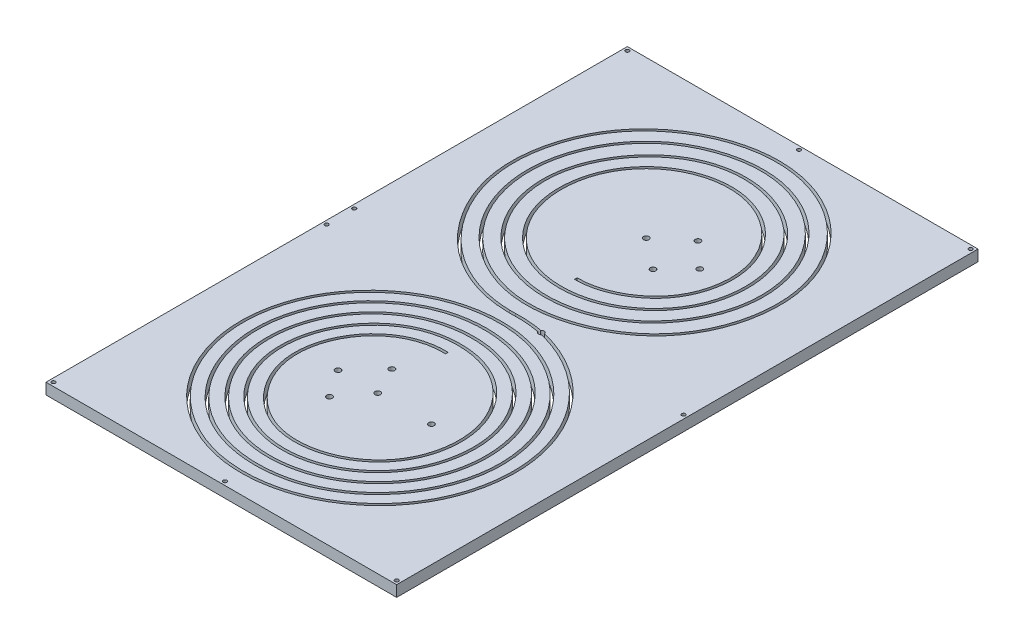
ISO-10303-21;
HEADER;
FILE_DESCRIPTION(('STEP AP214'),'2;1');
FILE_NAME('part.step','',(''),(''),'','','');
FILE_SCHEMA(('AUTOMOTIVE_DESIGN { 1 0 10303 214 1 1 1 1 }'));
ENDSEC;
DATA;
#1=APPLICATION_CONTEXT('core data for automotive mechanical design processes');
#2=APPLICATION_PROTOCOL_DEFINITION('international standard','automotive_design',2000,#1);
#3=PRODUCT_CONTEXT('',#1,'mechanical');
#4=PRODUCT('Part','Part','',(#3));
#5=PRODUCT_RELATED_PRODUCT_CATEGORY('part','',(#4));
#6=PRODUCT_DEFINITION_FORMATION('','',#4);
#7=PRODUCT_DEFINITION_CONTEXT('part definition',#1,'design');
#8=PRODUCT_DEFINITION('design','',#6,#7);
#9=PRODUCT_DEFINITION_SHAPE('','',#8);
#10=(LENGTH_UNIT() NAMED_UNIT(*) SI_UNIT(.MILLI.,.METRE.));
#11=(NAMED_UNIT(*) PLANE_ANGLE_UNIT() SI_UNIT($,.RADIAN.));
#12=(NAMED_UNIT(*) SI_UNIT($,.STERADIAN.) SOLID_ANGLE_UNIT());
#13=UNCERTAINTY_MEASURE_WITH_UNIT(LENGTH_MEASURE(1.E-05),#10,'distance_accuracy_value','');
#14=(GEOMETRIC_REPRESENTATION_CONTEXT(3) GLOBAL_UNCERTAINTY_ASSIGNED_CONTEXT((#13)) GLOBAL_UNIT_ASSIGNED_CONTEXT((#10,
#11,#12)) REPRESENTATION_CONTEXT('',''));
#15=CARTESIAN_POINT('',(0.,0.,0.));
#16=DIRECTION('',(0.,0.,1.));
#17=DIRECTION('',(1.,0.,0.));
#18=AXIS2_PLACEMENT_3D('',#15,#16,#17);
#19=CARTESIAN_POINT('',(15.9154943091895,3.,0.));
#20=DIRECTION('',(0.,1.,0.));
#21=DIRECTION('',(0.,0.,1.));
#22=AXIS2_PLACEMENT_3D('',#19,#20,#21);
#23=CYLINDRICAL_SURFACE('',#22,1.5);
#24=CARTESIAN_POINT('',(15.9154943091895,6.,0.));
#25=DIRECTION('',(0.,1.,0.));
#26=DIRECTION('',(0.,0.,1.));
#27=AXIS2_PLACEMENT_3D('',#24,#25,#26);
#28=CIRCLE('',#27,1.5);
#29=CARTESIAN_POINT('',(14.5132126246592,6.00000000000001,0.532546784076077));
#30=VERTEX_POINT('',#29);
#31=CARTESIAN_POINT('',(16.9762063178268,6.00000000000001,1.06060833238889));
#32=VERTEX_POINT('',#31);
#33=EDGE_CURVE('E277',#30,#32,#28,.T.);
#34=ORIENTED_EDGE('',*,*,#33,.T.);
#35=DIRECTION('',(0.,-1.,0.));
#36=VECTOR('',#35,1.);
#37=CARTESIAN_POINT('',(16.976206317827,3.00000000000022,1.06060833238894));
#38=LINE('',#37,#36);
#39=CARTESIAN_POINT('',(16.9762063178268,3.,1.06060833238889));
#40=VERTEX_POINT('',#39);
#41=EDGE_CURVE('E226',#32,#40,#38,.T.);
#42=ORIENTED_EDGE('',*,*,#41,.T.);
#43=CARTESIAN_POINT('',(15.9154943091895,3.,0.));
#44=DIRECTION('',(0.,1.,0.));
#45=DIRECTION('',(0.,0.,1.));
#46=AXIS2_PLACEMENT_3D('',#43,#44,#45);
#47=CIRCLE('',#46,1.5);
#48=CARTESIAN_POINT('',(14.5132126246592,3.,0.532546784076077));
#49=VERTEX_POINT('',#48);
#50=EDGE_CURVE('E280',#49,#40,#47,.T.);
#51=ORIENTED_EDGE('',*,*,#50,.F.);
#52=DIRECTION('',(0.,-1.,0.));
#53=VECTOR('',#52,1.);
#54=CARTESIAN_POINT('',(14.5132126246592,3.00000000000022,0.532546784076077));
#55=LINE('',#54,#53);
#56=EDGE_CURVE('E223',#49,#30,#55,.F.);
#57=ORIENTED_EDGE('',*,*,#56,.T.);
#58=EDGE_LOOP('',(#34,#42,#51,#57));
#59=FACE_BOUND('',#58,.T.);
#60=ADVANCED_FACE('F34',(#59),#23,.F.);
#61=CARTESIAN_POINT('',(15.9154943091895,3.,0.));
#62=DIRECTION('',(0.,1.,0.));
#63=DIRECTION('',(0.,0.,1.));
#64=AXIS2_PLACEMENT_3D('',#61,#62,#63);
#65=PLANE('',#64);
#66=CARTESIAN_POINT('',(-0.0471930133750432,3.,35.927653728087));
#67=CARTESIAN_POINT('',(-26.3843417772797,3.,35.039342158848));
#68=CARTESIAN_POINT('',(-54.5137512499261,3.,75.8193422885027));
#69=CARTESIAN_POINT('',(-17.7145150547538,3.,119.888127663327));
#70=CARTESIAN_POINT('',(18.4042084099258,3.,116.222331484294));
#71=CARTESIAN_POINT('',(42.3488491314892,3.,95.3385943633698));
#72=CARTESIAN_POINT('',(47.6549206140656,3.,61.1404856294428));
#73=CARTESIAN_POINT('',(23.6081375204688,3.,28.2637985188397));
#74=CARTESIAN_POINT('',(-20.1708285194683,3.,25.896113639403));
#75=CARTESIAN_POINT('',(-47.412428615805,3.,56.0279622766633));
#76=CARTESIAN_POINT('',(-49.0138611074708,3.,91.6660614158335));
#77=CARTESIAN_POINT('',(-28.5695799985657,3.,118.51103598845));
#78=CARTESIAN_POINT('',(6.63269690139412,3.,128.334204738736));
#79=CARTESIAN_POINT('',(46.0678067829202,3.,108.686040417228));
#80=CARTESIAN_POINT('',(57.0707358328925,3.,61.1558667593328));
#81=CARTESIAN_POINT('',(27.5913936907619,3.,20.8216395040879));
#82=CARTESIAN_POINT('',(-20.3887428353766,3.,18.7754896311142));
#83=CARTESIAN_POINT('',(-53.7302499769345,3.,49.5730981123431));
#84=CARTESIAN_POINT('',(-58.8016915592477,3.,96.9800735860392));
#85=CARTESIAN_POINT('',(-21.8063688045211,3.,134.806686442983));
#86=CARTESIAN_POINT('',(27.2494547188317,3.,130.620960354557));
#87=CARTESIAN_POINT('',(57.6471220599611,3.,99.1696322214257));
#88=CARTESIAN_POINT('',(61.2762896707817,3.,57.9680656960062));
#89=CARTESIAN_POINT('',(36.679706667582,3.,17.9839058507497));
#90=CARTESIAN_POINT('',(-14.2244302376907,3.,8.55452616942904));
#91=CARTESIAN_POINT('',(-51.6710636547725,3.,34.8923704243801));
#92=CARTESIAN_POINT('',(-67.2898960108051,3.,74.6535560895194));
#93=CARTESIAN_POINT('',(-54.4177025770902,3.,115.567909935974));
#94=CARTESIAN_POINT('',(-18.6656875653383,3.,139.690930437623));
#95=CARTESIAN_POINT('',(20.8961924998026,3.,139.488881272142));
#96=CARTESIAN_POINT('',(55.2796810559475,3.,115.658300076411));
#97=CARTESIAN_POINT('',(71.2652230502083,3.,75.0130275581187));
#98=CARTESIAN_POINT('',(57.3312332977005,3.,30.3340349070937));
#99=CARTESIAN_POINT('',(18.1392213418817,3.,4.02342273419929));
#100=CARTESIAN_POINT('',(-29.4608297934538,3.,7.83421528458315));
#101=CARTESIAN_POINT('',(-63.3458149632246,3.,38.2026073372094));
#102=CARTESIAN_POINT('',(-73.8078071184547,3.,81.6254940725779));
#103=CARTESIAN_POINT('',(-57.0664746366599,3.,124.518515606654));
#104=CARTESIAN_POINT('',(-17.1507332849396,3.,148.096435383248));
#105=CARTESIAN_POINT('',(28.4463259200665,3.,144.848914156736));
#106=CARTESIAN_POINT('',(66.7415893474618,3.,115.47740989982));
#107=CARTESIAN_POINT('',(78.5743944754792,3.,64.7702649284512));
#108=CARTESIAN_POINT('',(55.4343967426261,3.,14.702770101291));
#109=CARTESIAN_POINT('',(19.3496733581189,3.,-1.45284372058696));
#110=CARTESIAN_POINT('',(0.,3.,-0.568211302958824));
#111=B_SPLINE_CURVE_WITH_KNOTS('',3,(#66,#67,#68,#69,#70,#71,#72,#73,#74,#75,#76,#77,#78,#79,
#80,#81,#82,#83,#84,#85,#86,#87,#88,#89,#90,#91,#92,#93,#94,#95,#96,#97,#98,#99,#100,#101,#102,
#103,#104,#105,#106,#107,#108,#109,#110),.UNSPECIFIED.,.F.,.F.,(4,1,1,1,1,1,1,1,1,1,1,1,1,1,1,1,
1,1,1,1,1,1,1,1,1,1,1,1,1,1,1,1,1,1,1,1,1,1,1,1,1,1,4),(0.,0.0387556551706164,
0.0622834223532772,0.0811653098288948,0.0947764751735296,0.114610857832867,0.134338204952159,
0.157939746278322,0.179284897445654,0.197250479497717,0.215054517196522,0.233017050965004,
0.256010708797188,0.282679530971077,0.305598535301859,0.33313304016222,0.353706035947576,
0.378510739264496,0.406641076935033,0.432317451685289,0.454522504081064,0.476455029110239,
0.49855564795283,0.529468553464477,0.552958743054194,0.571797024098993,0.599778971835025,
0.618690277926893,0.64279578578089,0.662765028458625,0.687485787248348,0.712524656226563,
0.737224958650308,0.762841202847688,0.788881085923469,0.809926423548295,0.836110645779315,
0.862281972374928,0.883886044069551,0.911336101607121,0.939243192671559,0.966677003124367,1.),.UNSPECIFIED.);
#112=EDGE_CURVE('E11',#49,#40,#111,.F.);
#113=ORIENTED_EDGE('',*,*,#112,.F.);
#114=ORIENTED_EDGE('',*,*,#50,.T.);
#115=EDGE_LOOP('',(#113,#114));
#116=FACE_BOUND('',#115,.T.);
#117=ADVANCED_FACE('F368',(#116),#65,.T.);
#118=CARTESIAN_POINT('',(95.,6.,157.5));
#119=DIRECTION('',(-1.,0.,0.));
#120=DIRECTION('',(0.,0.,1.));
#121=AXIS2_PLACEMENT_3D('',#118,#119,#120);
#122=PLANE('',#121);
#123=DIRECTION('',(0.,0.,-1.));
#124=VECTOR('',#123,1.);
#125=CARTESIAN_POINT('',(95.,0.,157.5));
#126=LINE('',#125,#124);
#127=CARTESIAN_POINT('',(95.,0.,157.5));
#128=VERTEX_POINT('',#127);
#129=CARTESIAN_POINT('',(95.,0.,-157.5));
#130=VERTEX_POINT('',#129);
#131=EDGE_CURVE('E309',#128,#130,#126,.T.);
#132=ORIENTED_EDGE('',*,*,#131,.T.);
#133=DIRECTION('',(0.,-1.,0.));
#134=VECTOR('',#133,1.);
#135=CARTESIAN_POINT('',(95.,6.,-157.5));
#136=LINE('',#135,#134);
#137=CARTESIAN_POINT('',(95.,6.,-157.5));
#138=VERTEX_POINT('',#137);
#139=EDGE_CURVE('E338',#138,#130,#136,.T.);
#140=ORIENTED_EDGE('',*,*,#139,.F.);
#141=DIRECTION('',(0.,0.,-1.));
#142=VECTOR('',#141,1.);
#143=CARTESIAN_POINT('',(95.,6.,157.5));
#144=LINE('',#143,#142);
#145=CARTESIAN_POINT('',(95.,6.,157.5));
#146=VERTEX_POINT('',#145);
#147=EDGE_CURVE('E312',#146,#138,#144,.T.);
#148=ORIENTED_EDGE('',*,*,#147,.F.);
#149=DIRECTION('',(0.,-1.,0.));
#150=VECTOR('',#149,1.);
#151=CARTESIAN_POINT('',(95.,6.,157.5));
#152=LINE('',#151,#150);
#153=EDGE_CURVE('E322',#146,#128,#152,.T.);
#154=ORIENTED_EDGE('',*,*,#153,.T.);
#155=EDGE_LOOP('',(#132,#140,#148,#154));
#156=FACE_BOUND('',#155,.T.);
#157=ADVANCED_FACE('F36',(#156),#122,.F.);
#158=CARTESIAN_POINT('',(-95.,6.,-157.5));
#159=DIRECTION('',(0.,0.,1.));
#160=DIRECTION('',(1.,0.,0.));
#161=AXIS2_PLACEMENT_3D('',#158,#159,#160);
#162=PLANE('',#161);
#163=DIRECTION('',(-1.,0.,0.));
#164=VECTOR('',#163,1.);
#165=CARTESIAN_POINT('',(-95.,0.,-157.5));
#166=LINE('',#165,#164);
#167=CARTESIAN_POINT('',(-95.,0.,-157.5));
#168=VERTEX_POINT('',#167);
#169=EDGE_CURVE('E325',#130,#168,#166,.T.);
#170=ORIENTED_EDGE('',*,*,#169,.T.);
#171=DIRECTION('',(0.,-1.,0.));
#172=VECTOR('',#171,1.);
#173=CARTESIAN_POINT('',(-95.,6.,-157.5));
#174=LINE('',#173,#172);
#175=CARTESIAN_POINT('',(-95.,6.,-157.5));
#176=VERTEX_POINT('',#175);
#177=EDGE_CURVE('E335',#176,#168,#174,.T.);
#178=ORIENTED_EDGE('',*,*,#177,.F.);
#179=DIRECTION('',(-1.,0.,0.));
#180=VECTOR('',#179,1.);
#181=CARTESIAN_POINT('',(-95.,6.,-157.5));
#182=LINE('',#181,#180);
#183=EDGE_CURVE('E315',#138,#176,#182,.T.);
#184=ORIENTED_EDGE('',*,*,#183,.F.);
#185=ORIENTED_EDGE('',*,*,#139,.T.);
#186=EDGE_LOOP('',(#170,#178,#184,#185));
#187=FACE_BOUND('',#186,.T.);
#188=ADVANCED_FACE('F428',(#187),#162,.F.);
#189=CARTESIAN_POINT('',(-95.,6.,157.5));
#190=DIRECTION('',(1.,0.,0.));
#191=DIRECTION('',(0.,0.,-1.));
#192=AXIS2_PLACEMENT_3D('',#189,#190,#191);
#193=PLANE('',#192);
#194=DIRECTION('',(0.,0.,1.));
#195=VECTOR('',#194,1.);
#196=CARTESIAN_POINT('',(-95.,0.,157.5));
#197=LINE('',#196,#195);
#198=CARTESIAN_POINT('',(-95.,0.,157.5));
#199=VERTEX_POINT('',#198);
#200=EDGE_CURVE('E327',#168,#199,#197,.T.);
#201=ORIENTED_EDGE('',*,*,#200,.T.);
#202=DIRECTION('',(0.,-1.,0.));
#203=VECTOR('',#202,1.);
#204=CARTESIAN_POINT('',(-95.,6.,157.5));
#205=LINE('',#204,#203);
#206=CARTESIAN_POINT('',(-95.,6.,157.5));
#207=VERTEX_POINT('',#206);
#208=EDGE_CURVE('E332',#207,#199,#205,.T.);
#209=ORIENTED_EDGE('',*,*,#208,.F.);
#210=DIRECTION('',(0.,0.,1.));
#211=VECTOR('',#210,1.);
#212=CARTESIAN_POINT('',(-95.,6.,157.5));
#213=LINE('',#212,#211);
#214=EDGE_CURVE('E318',#176,#207,#213,.T.);
#215=ORIENTED_EDGE('',*,*,#214,.F.);
#216=ORIENTED_EDGE('',*,*,#177,.T.);
#217=EDGE_LOOP('',(#201,#209,#215,#216));
#218=FACE_BOUND('',#217,.T.);
#219=ADVANCED_FACE('F425',(#218),#193,.F.);
#220=CARTESIAN_POINT('',(-95.,6.,157.5));
#221=DIRECTION('',(0.,0.,-1.));
#222=DIRECTION('',(-1.,0.,0.));
#223=AXIS2_PLACEMENT_3D('',#220,#221,#222);
#224=PLANE('',#223);
#225=DIRECTION('',(1.,0.,0.));
#226=VECTOR('',#225,1.);
#227=CARTESIAN_POINT('',(-95.,0.,157.5));
#228=LINE('',#227,#226);
#229=EDGE_CURVE('E316',#199,#128,#228,.T.);
#230=ORIENTED_EDGE('',*,*,#229,.T.);
#231=ORIENTED_EDGE('',*,*,#153,.F.);
#232=DIRECTION('',(1.,0.,0.));
#233=VECTOR('',#232,1.);
#234=CARTESIAN_POINT('',(-95.,6.,157.5));
#235=LINE('',#234,#233);
#236=EDGE_CURVE('E320',#207,#146,#235,.T.);
#237=ORIENTED_EDGE('',*,*,#236,.F.);
#238=ORIENTED_EDGE('',*,*,#208,.T.);
#239=EDGE_LOOP('',(#230,#231,#237,#238));
#240=FACE_BOUND('',#239,.T.);
#241=ADVANCED_FACE('F419',(#240),#224,.F.);
#242=CARTESIAN_POINT('',(0.,6.,0.));
#243=DIRECTION('',(0.,-1.,0.));
#244=DIRECTION('',(0.,0.,-1.));
#245=AXIS2_PLACEMENT_3D('',#242,#243,#244);
#246=PLANE('',#245);
#247=CARTESIAN_POINT('',(-93.,6.,155.5));
#248=DIRECTION('',(0.,1.,0.));
#249=DIRECTION('',(0.,0.,1.));
#250=AXIS2_PLACEMENT_3D('',#247,#248,#249);
#251=CIRCLE('',#250,0.999999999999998);
#252=CARTESIAN_POINT('',(-93.,6.,156.5));
#253=VERTEX_POINT('',#252);
#254=EDGE_CURVE('E1139',#253,#253,#251,.T.);
#255=ORIENTED_EDGE('',*,*,#254,.F.);
#256=EDGE_LOOP('',(#255));
#257=FACE_BOUND('',#256,.T.);
#258=CARTESIAN_POINT('',(93.,6.,155.5));
#259=DIRECTION('',(0.,1.,0.));
#260=DIRECTION('',(0.,0.,1.));
#261=AXIS2_PLACEMENT_3D('',#258,#259,#260);
#262=CIRCLE('',#261,0.999999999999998);
#263=CARTESIAN_POINT('',(93.,6.,156.5));
#264=VERTEX_POINT('',#263);
#265=EDGE_CURVE('E1133',#264,#264,#262,.T.);
#266=ORIENTED_EDGE('',*,*,#265,.F.);
#267=EDGE_LOOP('',(#266));
#268=FACE_BOUND('',#267,.T.);
#269=CARTESIAN_POINT('',(0.,6.,155.5));
#270=DIRECTION('',(0.,1.,0.));
#271=DIRECTION('',(0.,0.,1.));
#272=AXIS2_PLACEMENT_3D('',#269,#270,#271);
#273=CIRCLE('',#272,1.);
#274=CARTESIAN_POINT('',(0.,6.,156.5));
#275=VERTEX_POINT('',#274);
#276=EDGE_CURVE('E1127',#275,#275,#273,.T.);
#277=ORIENTED_EDGE('',*,*,#276,.F.);
#278=EDGE_LOOP('',(#277));
#279=FACE_BOUND('',#278,.T.);
#280=CARTESIAN_POINT('',(93.,6.,0.));
#281=DIRECTION('',(0.,1.,0.));
#282=DIRECTION('',(0.,0.,1.));
#283=AXIS2_PLACEMENT_3D('',#280,#281,#282);
#284=CIRCLE('',#283,0.999999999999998);
#285=CARTESIAN_POINT('',(93.,6.,0.999999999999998));
#286=VERTEX_POINT('',#285);
#287=EDGE_CURVE('E1121',#286,#286,#284,.T.);
#288=ORIENTED_EDGE('',*,*,#287,.F.);
#289=EDGE_LOOP('',(#288));
#290=FACE_BOUND('',#289,.T.);
#291=CARTESIAN_POINT('',(0.,6.,-155.5));
#292=DIRECTION('',(0.,1.,0.));
#293=DIRECTION('',(0.,0.,1.));
#294=AXIS2_PLACEMENT_3D('',#291,#292,#293);
#295=CIRCLE('',#294,1.);
#296=CARTESIAN_POINT('',(0.,6.,-154.5));
#297=VERTEX_POINT('',#296);
#298=EDGE_CURVE('E1115',#297,#297,#295,.T.);
#299=ORIENTED_EDGE('',*,*,#298,.F.);
#300=EDGE_LOOP('',(#299));
#301=FACE_BOUND('',#300,.T.);
#302=CARTESIAN_POINT('',(93.,6.,-155.5));
#303=DIRECTION('',(0.,1.,0.));
#304=DIRECTION('',(0.,0.,1.));
#305=AXIS2_PLACEMENT_3D('',#302,#303,#304);
#306=CIRCLE('',#305,0.999999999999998);
#307=CARTESIAN_POINT('',(93.,6.,-154.5));
#308=VERTEX_POINT('',#307);
#309=EDGE_CURVE('E1109',#308,#308,#306,.T.);
#310=ORIENTED_EDGE('',*,*,#309,.F.);
#311=EDGE_LOOP('',(#310));
#312=FACE_BOUND('',#311,.T.);
#313=CARTESIAN_POINT('',(-93.,6.,-155.5));
#314=DIRECTION('',(0.,1.,0.));
#315=DIRECTION('',(0.,0.,1.));
#316=AXIS2_PLACEMENT_3D('',#313,#314,#315);
#317=CIRCLE('',#316,0.999999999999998);
#318=CARTESIAN_POINT('',(-93.,6.,-154.5));
#319=VERTEX_POINT('',#318);
#320=EDGE_CURVE('E1103',#319,#319,#317,.T.);
#321=ORIENTED_EDGE('',*,*,#320,.F.);
#322=EDGE_LOOP('',(#321));
#323=FACE_BOUND('',#322,.T.);
#324=CARTESIAN_POINT('',(-93.,6.,7.5));
#325=DIRECTION('',(0.,1.,0.));
#326=DIRECTION('',(0.,0.,1.));
#327=AXIS2_PLACEMENT_3D('',#324,#325,#326);
#328=CIRCLE('',#327,0.999999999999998);
#329=CARTESIAN_POINT('',(-93.,6.,8.5));
#330=VERTEX_POINT('',#329);
#331=EDGE_CURVE('E770',#330,#330,#328,.T.);
#332=ORIENTED_EDGE('',*,*,#331,.F.);
#333=EDGE_LOOP('',(#332));
#334=FACE_BOUND('',#333,.T.);
#335=CARTESIAN_POINT('',(-93.,6.,-7.5));
#336=DIRECTION('',(0.,1.,0.));
#337=DIRECTION('',(0.,0.,1.));
#338=AXIS2_PLACEMENT_3D('',#335,#336,#337);
#339=CIRCLE('',#338,0.999999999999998);
#340=CARTESIAN_POINT('',(-93.,6.,-6.5));
#341=VERTEX_POINT('',#340);
#342=EDGE_CURVE('E763',#341,#341,#339,.T.);
#343=ORIENTED_EDGE('',*,*,#342,.F.);
#344=EDGE_LOOP('',(#343));
#345=FACE_BOUND('',#344,.T.);
#346=DIRECTION('',(0.0337092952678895,0.,-0.999431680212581));
#347=VECTOR('',#346,1.);
#348=CARTESIAN_POINT('',(-0.0471930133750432,6.00000000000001,35.927653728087));
#349=LINE('',#348,#347);
#350=CARTESIAN_POINT('',(-0.0471930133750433,6.00000000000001,35.927653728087));
#351=VERTEX_POINT('',#350);
#352=CARTESIAN_POINT('',(0.,6.00000000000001,34.5284493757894));
#353=VERTEX_POINT('',#352);
#354=EDGE_CURVE('E795',#351,#353,#349,.T.);
#355=ORIENTED_EDGE('',*,*,#354,.F.);
#356=CARTESIAN_POINT('',(-0.0471930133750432,6.00000000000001,35.927653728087));
#357=CARTESIAN_POINT('',(-26.3843417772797,6.00000000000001,35.039342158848));
#358=CARTESIAN_POINT('',(-54.5137512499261,6.00000000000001,75.8193422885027));
#359=CARTESIAN_POINT('',(-17.7145150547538,6.00000000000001,119.888127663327));
#360=CARTESIAN_POINT('',(18.4042084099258,6.00000000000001,116.222331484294));
#361=CARTESIAN_POINT('',(42.3488491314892,6.00000000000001,95.3385943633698));
#362=CARTESIAN_POINT('',(47.6549206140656,6.00000000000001,61.1404856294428));
#363=CARTESIAN_POINT('',(23.6081375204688,6.00000000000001,28.2637985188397));
#364=CARTESIAN_POINT('',(-20.1708285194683,6.00000000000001,25.896113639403));
#365=CARTESIAN_POINT('',(-47.412428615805,6.00000000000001,56.0279622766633));
#366=CARTESIAN_POINT('',(-49.0138611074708,6.00000000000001,91.6660614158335));
#367=CARTESIAN_POINT('',(-28.5695799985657,6.00000000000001,118.51103598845));
#368=CARTESIAN_POINT('',(6.63269690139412,6.00000000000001,128.334204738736));
#369=CARTESIAN_POINT('',(46.0678067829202,6.00000000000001,108.686040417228));
#370=CARTESIAN_POINT('',(57.0707358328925,6.00000000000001,61.1558667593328));
#371=CARTESIAN_POINT('',(27.5913936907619,6.00000000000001,20.8216395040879));
#372=CARTESIAN_POINT('',(-20.3887428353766,6.00000000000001,18.7754896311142));
#373=CARTESIAN_POINT('',(-53.7302499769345,6.00000000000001,49.5730981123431));
#374=CARTESIAN_POINT('',(-58.8016915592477,6.00000000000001,96.9800735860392));
#375=CARTESIAN_POINT('',(-21.8063688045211,6.00000000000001,134.806686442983));
#376=CARTESIAN_POINT('',(27.2494547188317,6.00000000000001,130.620960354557));
#377=CARTESIAN_POINT('',(57.6471220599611,6.00000000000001,99.1696322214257));
#378=CARTESIAN_POINT('',(61.2762896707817,6.00000000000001,57.9680656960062));
#379=CARTESIAN_POINT('',(36.679706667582,6.00000000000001,17.9839058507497));
#380=CARTESIAN_POINT('',(-14.2244302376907,6.00000000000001,8.55452616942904));
#381=CARTESIAN_POINT('',(-51.6710636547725,6.00000000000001,34.8923704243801));
#382=CARTESIAN_POINT('',(-67.2898960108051,6.00000000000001,74.6535560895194));
#383=CARTESIAN_POINT('',(-54.4177025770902,6.00000000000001,115.567909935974));
#384=CARTESIAN_POINT('',(-18.6656875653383,6.00000000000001,139.690930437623));
#385=CARTESIAN_POINT('',(20.8961924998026,6.00000000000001,139.488881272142));
#386=CARTESIAN_POINT('',(55.2796810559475,6.00000000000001,115.658300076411));
#387=CARTESIAN_POINT('',(71.2652230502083,6.00000000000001,75.0130275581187));
#388=CARTESIAN_POINT('',(57.3312332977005,6.00000000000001,30.3340349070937));
#389=CARTESIAN_POINT('',(18.1392213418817,6.00000000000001,4.02342273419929));
#390=CARTESIAN_POINT('',(-29.4608297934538,6.00000000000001,7.83421528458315));
#391=CARTESIAN_POINT('',(-63.3458149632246,6.00000000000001,38.2026073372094));
#392=CARTESIAN_POINT('',(-73.8078071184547,6.00000000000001,81.6254940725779));
#393=CARTESIAN_POINT('',(-57.0664746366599,6.00000000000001,124.518515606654));
#394=CARTESIAN_POINT('',(-17.1507332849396,6.00000000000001,148.096435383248));
#395=CARTESIAN_POINT('',(28.4463259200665,6.00000000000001,144.848914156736));
#396=CARTESIAN_POINT('',(66.7415893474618,6.00000000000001,115.47740989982));
#397=CARTESIAN_POINT('',(78.5743944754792,6.00000000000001,64.7702649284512));
#398=CARTESIAN_POINT('',(55.4343967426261,6.00000000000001,14.702770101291));
#399=CARTESIAN_POINT('',(19.3496733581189,6.00000000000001,-1.45284372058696));
#400=CARTESIAN_POINT('',(0.,6.00000000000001,-0.568211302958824));
#401=B_SPLINE_CURVE_WITH_KNOTS('',3,(#356,#357,#358,#359,#360,#361,#362,#363,#364,#365,#366,
#367,#368,#369,#370,#371,#372,#373,#374,#375,#376,#377,#378,#379,#380,#381,#382,#383,#384,#385,
#386,#387,#388,#389,#390,#391,#392,#393,#394,#395,#396,#397,#398,#399,#400),.UNSPECIFIED.,.F.,
.F.,(4,1,1,1,1,1,1,1,1,1,1,1,1,1,1,1,1,1,1,1,1,1,1,1,1,1,1,1,1,1,1,1,1,1,1,1,1,1,1,1,1,1,4),(0.,
0.0387556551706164,0.0622834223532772,0.0811653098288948,0.0947764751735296,0.114610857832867,
0.134338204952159,0.157939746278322,0.179284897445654,0.197250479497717,0.215054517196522,
0.233017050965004,0.256010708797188,0.282679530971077,0.305598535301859,0.33313304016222,
0.353706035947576,0.378510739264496,0.406641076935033,0.432317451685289,0.454522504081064,
0.476455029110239,0.49855564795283,0.529468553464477,0.552958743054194,0.571797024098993,
0.599778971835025,0.618690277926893,0.64279578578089,0.662765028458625,0.687485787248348,
0.712524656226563,0.737224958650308,0.762841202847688,0.788881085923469,0.809926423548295,
0.836110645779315,0.862281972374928,0.883886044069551,0.911336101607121,0.939243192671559,
0.966677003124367,1.),.UNSPECIFIED.);
#402=EDGE_CURVE('E800',#32,#351,#401,.F.);
#403=ORIENTED_EDGE('',*,*,#402,.F.);
#404=ORIENTED_EDGE('',*,*,#33,.F.);
#405=CARTESIAN_POINT('',(0.,6.00000000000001,-0.568211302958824));
#406=VERTEX_POINT('',#405);
#407=EDGE_CURVE('E218',#406,#30,#401,.F.);
#408=ORIENTED_EDGE('',*,*,#407,.F.);
#409=DIRECTION('',(0.999999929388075,0.,-0.000375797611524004));
#410=VECTOR('',#409,1.);
#411=CARTESIAN_POINT('',(-3.21891606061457,6.00000000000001,-0.567001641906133));
#412=LINE('',#411,#410);
#413=CARTESIAN_POINT('',(-3.21891606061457,6.00000000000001,-0.567001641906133));
#414=VERTEX_POINT('',#413);
#415=EDGE_CURVE('E216',#414,#406,#412,.T.);
#416=ORIENTED_EDGE('',*,*,#415,.F.);
#417=CARTESIAN_POINT('',(-3.21891606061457,6.00000000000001,-0.567001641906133));
#418=CARTESIAN_POINT('',(-5.08618778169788,6.00000000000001,-0.60237612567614));
#419=CARTESIAN_POINT('',(-8.82863271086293,6.00000000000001,-0.829418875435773));
#420=CARTESIAN_POINT('',(-16.1765242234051,6.00000000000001,-1.89133188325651));
#421=CARTESIAN_POINT('',(-25.1072799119,6.00000000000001,-4.33232475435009));
#422=CARTESIAN_POINT('',(-35.2056370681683,6.00000000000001,-8.95169365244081));
#423=CARTESIAN_POINT('',(-47.6027555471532,6.00000000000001,-17.2552988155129));
#424=CARTESIAN_POINT('',(-57.9918745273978,6.00000000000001,-28.541762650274));
#425=CARTESIAN_POINT('',(-65.6599884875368,6.00000000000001,-41.7332117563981));
#426=CARTESIAN_POINT('',(-69.8692962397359,6.00000000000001,-52.3225259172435));
#427=CARTESIAN_POINT('',(-72.3528600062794,6.00000000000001,-63.3540006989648));
#428=CARTESIAN_POINT('',(-72.9101040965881,6.00000000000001,-74.5418695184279));
#429=CARTESIAN_POINT('',(-71.6831557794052,6.00000000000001,-85.6337874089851));
#430=CARTESIAN_POINT('',(-67.9021918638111,6.00000000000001,-100.013853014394));
#431=CARTESIAN_POINT('',(-59.3711452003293,6.00000000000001,-116.714463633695));
#432=CARTESIAN_POINT('',(-42.931730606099,6.00000000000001,-132.370449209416));
#433=CARTESIAN_POINT('',(-22.5510770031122,6.00000000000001,-142.545412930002));
#434=CARTESIAN_POINT('',(-0.358248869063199,6.00000000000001,-146.296235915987));
#435=CARTESIAN_POINT('',(21.9336964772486,6.00000000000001,-142.619143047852));
#436=CARTESIAN_POINT('',(38.495645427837,6.00000000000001,-133.737282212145));
#437=CARTESIAN_POINT('',(49.5592583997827,6.00000000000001,-123.717512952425));
#438=CARTESIAN_POINT('',(58.8988393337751,6.00000000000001,-111.967449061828));
#439=CARTESIAN_POINT('',(65.2685662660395,6.00000000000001,-98.1862243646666));
#440=CARTESIAN_POINT('',(67.8378790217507,6.00000000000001,-83.4841099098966));
#441=CARTESIAN_POINT('',(67.8849198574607,6.00000000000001,-72.3060262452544));
#442=CARTESIAN_POINT('',(66.1737801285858,6.00000000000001,-61.2292769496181));
#443=CARTESIAN_POINT('',(62.7743553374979,6.00000000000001,-50.519992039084));
#444=CARTESIAN_POINT('',(57.7089821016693,6.00000000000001,-40.4998621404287));
#445=CARTESIAN_POINT('',(48.7249950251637,6.00000000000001,-28.4971411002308));
#446=CARTESIAN_POINT('',(33.6375166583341,6.00000000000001,-16.830988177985));
#447=CARTESIAN_POINT('',(12.0929067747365,6.00000000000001,-8.96631562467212));
#448=CARTESIAN_POINT('',(-10.4430308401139,6.00000000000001,-8.11765254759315));
#449=CARTESIAN_POINT('',(-28.3294321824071,6.00000000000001,-14.517888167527));
#450=CARTESIAN_POINT('',(-40.7518414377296,6.00000000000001,-22.9463936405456));
#451=CARTESIAN_POINT('',(-48.8324967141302,6.00000000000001,-30.6872965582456));
#452=CARTESIAN_POINT('',(-55.453766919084,6.00000000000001,-39.6987556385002));
#453=CARTESIAN_POINT('',(-62.020074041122,6.00000000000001,-53.1744582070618));
#454=CARTESIAN_POINT('',(-65.6396649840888,6.00000000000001,-71.8261558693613));
#455=CARTESIAN_POINT('',(-62.4859996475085,6.00000000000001,-90.428681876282));
#456=CARTESIAN_POINT('',(-56.378596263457,6.00000000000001,-104.153037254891));
#457=CARTESIAN_POINT('',(-50.1269028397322,6.00000000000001,-113.526477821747));
#458=CARTESIAN_POINT('',(-42.3417854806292,6.00000000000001,-121.61332725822));
#459=CARTESIAN_POINT('',(-33.1781514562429,6.00000000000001,-128.005073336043));
#460=CARTESIAN_POINT('',(-23.0433758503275,6.00000000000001,-132.732324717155));
#461=CARTESIAN_POINT('',(-12.2500691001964,6.00000000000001,-135.831629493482));
#462=CARTESIAN_POINT('',(-1.09494444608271,6.00000000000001,-137.059930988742));
#463=CARTESIAN_POINT('',(10.1107473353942,6.00000000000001,-136.139802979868));
#464=CARTESIAN_POINT('',(20.9528746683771,6.00000000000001,-133.09547740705));
#465=CARTESIAN_POINT('',(34.4169901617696,6.00000000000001,-126.42623904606));
#466=CARTESIAN_POINT('',(48.4709400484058,6.00000000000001,-113.638653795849));
#467=CARTESIAN_POINT('',(56.9576983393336,6.00000000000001,-96.5184522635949));
#468=CARTESIAN_POINT('',(59.6379064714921,6.00000000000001,-81.6782197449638));
#469=CARTESIAN_POINT('',(59.3941693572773,6.00000000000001,-70.3752139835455));
#470=CARTESIAN_POINT('',(56.9632807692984,6.00000000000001,-59.3337556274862));
#471=CARTESIAN_POINT('',(51.1232679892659,6.00000000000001,-45.4401820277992));
#472=CARTESIAN_POINT('',(39.4809326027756,6.00000000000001,-30.5732978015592));
#473=CARTESIAN_POINT('',(22.8932988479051,6.00000000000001,-21.132773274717));
#474=CARTESIAN_POINT('',(8.15976357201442,6.00000000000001,-17.6035635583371));
#475=CARTESIAN_POINT('',(-3.23018143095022,6.00000000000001,-17.1691772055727));
#476=CARTESIAN_POINT('',(-14.4854375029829,6.00000000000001,-18.9470888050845));
#477=CARTESIAN_POINT('',(-25.1570573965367,6.00000000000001,-22.8315855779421));
#478=CARTESIAN_POINT('',(-34.7692789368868,6.00000000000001,-28.7898039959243));
#479=CARTESIAN_POINT('',(-45.6171947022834,6.00000000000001,-39.2040623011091));
#480=CARTESIAN_POINT('',(-54.8317733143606,6.00000000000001,-56.0167327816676));
#481=CARTESIAN_POINT('',(-56.670931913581,6.00000000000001,-75.2539364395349));
#482=CARTESIAN_POINT('',(-52.9528304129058,6.00000000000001,-90.2310027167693));
#483=CARTESIAN_POINT('',(-47.9525694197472,6.00000000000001,-100.780834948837));
#484=CARTESIAN_POINT('',(-41.049214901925,6.00000000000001,-110.230732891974));
#485=CARTESIAN_POINT('',(-32.559540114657,6.00000000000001,-118.149946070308));
#486=CARTESIAN_POINT('',(-22.7710701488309,6.00000000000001,-124.078799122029));
#487=CARTESIAN_POINT('',(-12.0476707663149,6.00000000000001,-127.624789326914));
#488=CARTESIAN_POINT('',(-0.771615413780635,6.00000000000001,-128.733855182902));
#489=CARTESIAN_POINT('',(10.6520666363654,6.00000000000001,-127.325036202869));
#490=CARTESIAN_POINT('',(21.6202504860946,6.00000000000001,-123.597626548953));
#491=CARTESIAN_POINT('',(31.5649542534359,6.00000000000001,-117.730762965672));
#492=CARTESIAN_POINT('',(39.881942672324,6.00000000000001,-109.852837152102));
#493=CARTESIAN_POINT('',(46.0045363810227,6.00000000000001,-100.258100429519));
#494=CARTESIAN_POINT('',(49.8755689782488,6.00000000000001,-89.5443304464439));
#495=CARTESIAN_POINT('',(51.3754025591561,6.00000000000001,-78.2288955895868));
#496=CARTESIAN_POINT('',(50.4561360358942,6.00000000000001,-66.8649070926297));
#497=CARTESIAN_POINT('',(47.1297154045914,6.00000000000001,-55.9772284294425));
#498=CARTESIAN_POINT('',(41.3347846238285,6.00000000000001,-46.1403825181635));
#499=CARTESIAN_POINT('',(33.4475495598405,6.00000000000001,-37.8151877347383));
#500=CARTESIAN_POINT('',(23.9325184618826,6.00000000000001,-31.3277815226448));
#501=CARTESIAN_POINT('',(13.1922472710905,6.00000000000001,-27.0701109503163));
#502=CARTESIAN_POINT('',(1.76396729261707,6.00000000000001,-25.3305337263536));
#503=CARTESIAN_POINT('',(-9.7180056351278,6.00000000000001,-26.1419841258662));
#504=CARTESIAN_POINT('',(-20.6582918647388,6.00000000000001,-29.6066516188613));
#505=CARTESIAN_POINT('',(-30.3784419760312,6.00000000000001,-35.7826564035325));
#506=CARTESIAN_POINT('',(-38.3591303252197,6.00000000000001,-44.1254361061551));
#507=CARTESIAN_POINT('',(-46.0688880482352,6.00000000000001,-57.5061169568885));
#508=CARTESIAN_POINT('',(-48.2664062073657,6.00000000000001,-73.1969983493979));
#509=CARTESIAN_POINT('',(-45.1975442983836,6.00000000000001,-88.3398574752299));
#510=CARTESIAN_POINT('',(-40.2779919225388,6.00000000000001,-98.7278390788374));
#511=CARTESIAN_POINT('',(-32.97614261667,6.00000000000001,-107.485984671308));
#512=CARTESIAN_POINT('',(-23.8071798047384,6.00000000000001,-114.274310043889));
#513=CARTESIAN_POINT('',(-13.2427517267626,6.00000000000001,-118.690530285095));
#514=CARTESIAN_POINT('',(-1.93987497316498,6.00000000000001,-120.46696264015));
#515=CARTESIAN_POINT('',(9.46560632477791,6.00000000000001,-119.223798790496));
#516=CARTESIAN_POINT('',(20.2000148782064,6.00000000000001,-115.09232578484));
#517=CARTESIAN_POINT('',(29.5933834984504,6.00000000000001,-108.419064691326));
#518=CARTESIAN_POINT('',(36.9182963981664,6.00000000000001,-99.5277450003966));
#519=CARTESIAN_POINT('',(41.7361832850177,6.00000000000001,-89.0707844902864));
#520=CARTESIAN_POINT('',(43.4997294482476,6.00000000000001,-77.605803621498));
#521=CARTESIAN_POINT('',(42.0990207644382,6.00000000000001,-66.024398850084));
#522=CARTESIAN_POINT('',(38.5282042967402,6.00000000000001,-57.037163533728));
#523=CARTESIAN_POINT('',(34.2885147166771,6.00000000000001,-50.7037621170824));
#524=CARTESIAN_POINT('',(29.2090280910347,6.00000000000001,-45.0980904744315));
#525=CARTESIAN_POINT('',(21.5868252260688,6.00000000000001,-39.4762095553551));
#526=CARTESIAN_POINT('',(12.9139778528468,6.00000000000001,-35.7553988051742));
#527=CARTESIAN_POINT('',(5.58091969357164,6.00000000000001,-34.1980345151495));
#528=CARTESIAN_POINT('',(1.8023159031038,6.00000000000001,-33.9480163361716));
#529=CARTESIAN_POINT('',(-0.0786459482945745,6.00000000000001,-33.9677772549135));
#530=B_SPLINE_CURVE_WITH_KNOTS('',3,(#417,#418,#419,#420,#421,#422,#423,#424,#425,#426,#427,
#428,#429,#430,#431,#432,#433,#434,#435,#436,#437,#438,#439,#440,#441,#442,#443,#444,#445,#446,
#447,#448,#449,#450,#451,#452,#453,#454,#455,#456,#457,#458,#459,#460,#461,#462,#463,#464,#465,
#466,#467,#468,#469,#470,#471,#472,#473,#474,#475,#476,#477,#478,#479,#480,#481,#482,#483,#484,
#485,#486,#487,#488,#489,#490,#491,#492,#493,#494,#495,#496,#497,#498,#499,#500,#501,#502,#503,
#504,#505,#506,#507,#508,#509,#510,#511,#512,#513,#514,#515,#516,#517,#518,#519,#520,#521,#522,
#523,#524,#525,#526,#527,#528,#529),.UNSPECIFIED.,.F.,.F.,(4,1,1,1,1,1,1,1,1,1,1,1,1,1,1,1,1,1,
1,1,1,1,1,1,1,1,1,1,1,1,1,1,1,1,1,1,1,1,1,1,1,1,1,1,1,1,1,1,1,1,1,1,1,1,1,1,1,1,1,1,1,1,1,1,1,1,
1,1,1,1,1,1,1,1,1,1,1,1,1,1,1,1,1,1,1,1,1,1,1,1,1,1,1,1,1,1,1,1,1,1,1,1,1,1,1,1,1,1,1,1,4),(0.,
0.00390625,0.0078125,0.015625,0.0234375,0.03125,0.046875,0.0546875,0.0625,0.0703125,0.078125,
0.0859375,0.09375,0.109375,0.125,0.140625,0.15625,0.171875,0.1875,0.1953125,0.203125,0.21875,
0.2265625,0.234375,0.2421875,0.25,0.2578125,0.265625,0.28125,0.296875,0.3125,0.328125,0.3359375,
0.34375,0.3515625,0.359375,0.375,0.390625,0.3984375,0.40625,0.4140625,0.421875,0.4296875,0.4375,
0.4453125,0.453125,0.4609375,0.46875,0.484375,0.5,0.5078125,0.515625,0.5234375,0.53125,0.546875,
0.5625,0.5703125,0.578125,0.5859375,0.59375,0.6015625,0.609375,0.625,0.640625,0.6484375,0.65625,
0.6640625,0.671875,0.6796875,0.6875,0.6953125,0.703125,0.7109375,0.71875,0.7265625,0.734375,
0.7421875,0.75,0.7578125,0.765625,0.7734375,0.78125,0.7890625,0.796875,0.8046875,0.8125,
0.8203125,0.828125,0.8359375,0.84375,0.859375,0.8671875,0.875,0.8828125,0.890625,0.8984375,
0.90625,0.9140625,0.921875,0.9296875,0.9375,0.9453125,0.953125,0.9609375,0.96875,0.97265625,
0.9765625,0.984375,0.9921875,0.99609375,1.),.UNSPECIFIED.);
#531=CARTESIAN_POINT('',(-0.0786459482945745,6.00000000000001,-33.9677772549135));
#532=VERTEX_POINT('',#531);
#533=EDGE_CURVE('E157',#532,#414,#530,.F.);
#534=ORIENTED_EDGE('',*,*,#533,.F.);
#535=DIRECTION('',(-0.0105051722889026,0.,0.999944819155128));
#536=VECTOR('',#535,1.);
#537=CARTESIAN_POINT('',(-0.0786459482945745,6.00000000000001,-33.9677772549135));
#538=LINE('',#537,#536);
#539=CARTESIAN_POINT('',(-0.0639387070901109,6.00000000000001,-35.3677000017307));
#540=VERTEX_POINT('',#539);
#541=EDGE_CURVE('E776',#540,#532,#538,.T.);
#542=ORIENTED_EDGE('',*,*,#541,.F.);
#543=CARTESIAN_POINT('',(-0.0639387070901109,5.99999999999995,-35.3677000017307));
#544=CARTESIAN_POINT('',(7.03756389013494,5.99999999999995,-35.2930933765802));
#545=CARTESIAN_POINT('',(20.0881703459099,5.99999999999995,-39.1326113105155));
#546=CARTESIAN_POINT('',(38.7080933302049,5.99999999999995,-54.9013442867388));
#547=CARTESIAN_POINT('',(45.0483823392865,5.99999999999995,-83.0944456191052));
#548=CARTESIAN_POINT('',(29.6529738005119,5.99999999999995,-110.091465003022));
#549=CARTESIAN_POINT('',(2.68946237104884,5.99999999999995,-121.508500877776));
#550=CARTESIAN_POINT('',(-24.5324278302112,5.99999999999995,-114.593083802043));
#551=CARTESIAN_POINT('',(-46.2489438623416,5.99999999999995,-91.8934392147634));
#552=CARTESIAN_POINT('',(-48.1639935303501,5.99999999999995,-55.145417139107));
#553=CARTESIAN_POINT('',(-20.8458858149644,5.99999999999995,-26.3437841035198));
#554=CARTESIAN_POINT('',(18.3309759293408,5.99999999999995,-25.5895364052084));
#555=CARTESIAN_POINT('',(47.0173633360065,5.99999999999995,-50.4333300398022));
#556=CARTESIAN_POINT('',(52.0645697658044,5.99999999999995,-84.2575772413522));
#557=CARTESIAN_POINT('',(37.4014531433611,5.99999999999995,-116.688221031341));
#558=CARTESIAN_POINT('',(4.31027202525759,5.99999999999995,-130.370939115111));
#559=CARTESIAN_POINT('',(-34.9463978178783,5.99999999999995,-120.606852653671));
#560=CARTESIAN_POINT('',(-59.6215591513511,5.99999999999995,-84.4540356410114));
#561=CARTESIAN_POINT('',(-50.491878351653,5.99999999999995,-46.2152993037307));
#562=CARTESIAN_POINT('',(-28.2417969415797,5.99999999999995,-23.0863267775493));
#563=CARTESIAN_POINT('',(4.23097547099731,5.99999999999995,-15.296173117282));
#564=CARTESIAN_POINT('',(33.5875127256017,5.99999999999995,-26.8503537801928));
#565=CARTESIAN_POINT('',(52.7657099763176,5.99999999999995,-48.7768012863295));
#566=CARTESIAN_POINT('',(61.2672728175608,5.99999999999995,-77.2404737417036));
#567=CARTESIAN_POINT('',(51.8371006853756,5.99999999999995,-108.555318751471));
#568=CARTESIAN_POINT('',(29.9323152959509,5.99999999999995,-129.334363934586));
#569=CARTESIAN_POINT('',(2.48166970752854,5.99999999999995,-137.44316024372));
#570=CARTESIAN_POINT('',(-22.2954968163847,5.99999999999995,-132.651881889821));
#571=CARTESIAN_POINT('',(-44.6404428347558,5.99999999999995,-119.624040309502));
#572=CARTESIAN_POINT('',(-59.9501044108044,5.99999999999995,-97.7336801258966));
#573=CARTESIAN_POINT('',(-65.070226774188,5.99999999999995,-68.3577326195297));
#574=CARTESIAN_POINT('',(-56.754115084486,5.99999999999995,-41.4595599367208));
#575=CARTESIAN_POINT('',(-37.8411025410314,5.99999999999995,-20.5295577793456));
#576=CARTESIAN_POINT('',(-13.519536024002,5.99999999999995,-9.41711948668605));
#577=CARTESIAN_POINT('',(19.9246051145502,5.99999999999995,-10.5615046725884));
#578=CARTESIAN_POINT('',(52.0260252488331,5.99999999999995,-28.7239377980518));
#579=CARTESIAN_POINT('',(66.8815050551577,5.99999999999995,-62.2419584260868));
#580=CARTESIAN_POINT('',(66.8232545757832,5.99999999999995,-94.7878925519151));
#581=CARTESIAN_POINT('',(51.9539372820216,5.99999999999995,-122.070765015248));
#582=CARTESIAN_POINT('',(28.4341477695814,5.99999999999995,-138.863900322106));
#583=CARTESIAN_POINT('',(2.90278674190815,5.99999999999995,-145.307291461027));
#584=CARTESIAN_POINT('',(-28.4181127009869,5.99999999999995,-140.670913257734));
#585=CARTESIAN_POINT('',(-56.0459088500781,5.99999999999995,-121.342822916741));
#586=CARTESIAN_POINT('',(-70.1815585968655,5.99999999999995,-91.9459578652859));
#587=CARTESIAN_POINT('',(-73.7552432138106,5.99999999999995,-54.5751016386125));
#588=CARTESIAN_POINT('',(-49.3782438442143,5.99999999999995,-13.631220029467));
#589=CARTESIAN_POINT('',(-17.5394988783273,5.99999999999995,-2.23854877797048));
#590=CARTESIAN_POINT('',(-3.19239855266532,5.99999999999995,-1.96675048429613));
#591=B_SPLINE_CURVE_WITH_KNOTS('',3,(#543,#544,#545,#546,#547,#548,#549,#550,#551,#552,#553,
#554,#555,#556,#557,#558,#559,#560,#561,#562,#563,#564,#565,#566,#567,#568,#569,#570,#571,#572,
#573,#574,#575,#576,#577,#578,#579,#580,#581,#582,#583,#584,#585,#586,#587,#588,#589,#590),
.UNSPECIFIED.,.F.,.F.,(4,1,1,1,1,1,1,1,1,1,1,1,1,1,1,1,1,1,1,1,1,1,1,1,1,1,1,1,1,1,1,1,1,1,1,1,
1,1,1,1,1,1,1,1,1,4),(0.,0.0152326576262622,0.0285660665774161,0.0511350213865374,
0.070948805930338,0.0910452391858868,0.109844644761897,0.128088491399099,0.15569259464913,
0.179891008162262,0.205855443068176,0.232356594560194,0.254401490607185,0.275227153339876,
0.305051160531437,0.322435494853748,0.360206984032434,0.384207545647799,0.401935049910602,
0.427287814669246,0.451297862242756,0.466094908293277,0.48918728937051,0.512075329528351,
0.533042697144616,0.55187693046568,0.57173348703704,0.585730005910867,0.606987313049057,
0.627016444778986,0.648275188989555,0.665248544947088,0.6867898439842,0.703506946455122,
0.736292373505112,0.759833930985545,0.779492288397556,0.804856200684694,0.823470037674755,
0.840553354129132,0.860429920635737,0.890314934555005,0.908844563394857,0.929441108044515,
0.969479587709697,1.),.UNSPECIFIED.);
#592=CARTESIAN_POINT('',(-3.19239855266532,5.99999999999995,-1.96675048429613));
#593=VERTEX_POINT('',#592);
#594=EDGE_CURVE('E781',#593,#540,#591,.F.);
#595=ORIENTED_EDGE('',*,*,#594,.F.);
#596=DIRECTION('',(-1.,0.,0.));
#597=VECTOR('',#596,1.);
#598=CARTESIAN_POINT('',(-3.19239855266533,6.00000000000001,-1.96675048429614));
#599=LINE('',#598,#597);
#600=CARTESIAN_POINT('',(-0.0639387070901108,6.00000000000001,-1.96675048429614));
#601=VERTEX_POINT('',#600);
#602=EDGE_CURVE('E785',#601,#593,#599,.T.);
#603=ORIENTED_EDGE('',*,*,#602,.F.);
#604=CARTESIAN_POINT('',(-0.0639387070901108,6.00000000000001,-1.96675048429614));
#605=CARTESIAN_POINT('',(4.57857977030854,6.00000000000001,-2.17899811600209));
#606=CARTESIAN_POINT('',(13.9144897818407,6.00000000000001,-1.50630087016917));
#607=CARTESIAN_POINT('',(27.505906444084,6.00000000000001,2.44114208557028));
#608=CARTESIAN_POINT('',(40.1985424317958,6.00000000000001,8.98155508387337));
#609=CARTESIAN_POINT('',(51.502026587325,6.00000000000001,17.7793823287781));
#610=CARTESIAN_POINT('',(60.8796150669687,6.00000000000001,28.5182875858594));
#611=CARTESIAN_POINT('',(70.441712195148,6.00000000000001,44.8516672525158));
#612=CARTESIAN_POINT('',(75.2340689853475,6.00000000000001,63.3786962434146));
#613=CARTESIAN_POINT('',(74.550155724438,6.00000000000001,82.3332585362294));
#614=CARTESIAN_POINT('',(71.4364864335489,6.00000000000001,96.2171142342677));
#615=CARTESIAN_POINT('',(65.8098792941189,6.00000000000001,109.270795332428));
#616=CARTESIAN_POINT('',(57.7193010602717,6.00000000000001,120.945340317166));
#617=CARTESIAN_POINT('',(47.5197393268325,6.00000000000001,130.840869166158));
#618=CARTESIAN_POINT('',(35.6765243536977,6.00000000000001,138.705034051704));
#619=CARTESIAN_POINT('',(22.6126027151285,6.00000000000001,144.244535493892));
#620=CARTESIAN_POINT('',(8.78433334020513,6.00000000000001,147.184876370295));
#621=CARTESIAN_POINT('',(-5.31861850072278,6.00000000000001,147.45546398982));
#622=CARTESIAN_POINT('',(-19.2272065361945,6.00000000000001,144.92640815));
#623=CARTESIAN_POINT('',(-32.4116157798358,6.00000000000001,139.643033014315));
#624=CARTESIAN_POINT('',(-44.3751447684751,6.00000000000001,131.926589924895));
#625=CARTESIAN_POINT('',(-54.6243930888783,6.00000000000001,122.029535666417));
#626=CARTESIAN_POINT('',(-62.6418459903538,6.00000000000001,110.246897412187));
#627=CARTESIAN_POINT('',(-68.2104436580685,6.00000000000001,97.140510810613));
#628=CARTESIAN_POINT('',(-72.1250545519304,6.00000000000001,78.5967936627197));
#629=CARTESIAN_POINT('',(-70.2028772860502,6.00000000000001,59.5507549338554));
#630=CARTESIAN_POINT('',(-62.8268354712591,6.00000000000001,42.1820637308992));
#631=CARTESIAN_POINT('',(-54.7287825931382,6.00000000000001,30.533743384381));
#632=CARTESIAN_POINT('',(-44.4914376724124,6.00000000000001,20.6610690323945));
#633=CARTESIAN_POINT('',(-32.5382755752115,6.00000000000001,12.919106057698));
#634=CARTESIAN_POINT('',(-19.2694709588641,6.00000000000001,7.71968526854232));
#635=CARTESIAN_POINT('',(-5.23892765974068,6.00000000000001,5.263255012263));
#636=CARTESIAN_POINT('',(8.97880205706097,6.00000000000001,5.60399646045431));
#637=CARTESIAN_POINT('',(22.8209740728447,6.00000000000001,8.88397809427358));
#638=CARTESIAN_POINT('',(35.6761648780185,6.00000000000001,15.0392295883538));
#639=CARTESIAN_POINT('',(47.0172388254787,6.00000000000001,23.6771028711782));
#640=CARTESIAN_POINT('',(56.2956269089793,6.00000000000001,34.5035049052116));
#641=CARTESIAN_POINT('',(65.2317375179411,6.00000000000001,51.2937802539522));
#642=CARTESIAN_POINT('',(69.5652523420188,6.00000000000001,75.1007695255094));
#643=CARTESIAN_POINT('',(63.4648366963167,6.00000000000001,98.4798278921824));
#644=CARTESIAN_POINT('',(53.4261467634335,6.00000000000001,114.582329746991));
#645=CARTESIAN_POINT('',(40.2893854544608,6.00000000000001,128.17725833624));
#646=CARTESIAN_POINT('',(23.3503700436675,6.00000000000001,137.165179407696));
#647=CARTESIAN_POINT('',(4.57254690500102,6.00000000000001,140.21785323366));
#648=CARTESIAN_POINT('',(-9.68375661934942,6.00000000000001,139.582713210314));
#649=CARTESIAN_POINT('',(-23.448602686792,6.00000000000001,135.966519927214));
#650=CARTESIAN_POINT('',(-36.0113542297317,6.00000000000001,129.397982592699));
#651=CARTESIAN_POINT('',(-46.8278474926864,6.00000000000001,120.212168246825));
#652=CARTESIAN_POINT('',(-55.2924886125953,6.00000000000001,108.660391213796));
#653=CARTESIAN_POINT('',(-61.0780148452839,6.00000000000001,95.4493600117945));
#654=CARTESIAN_POINT('',(-63.9844672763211,6.00000000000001,81.3277309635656));
#655=CARTESIAN_POINT('',(-63.7325517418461,6.00000000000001,67.0152713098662));
#656=CARTESIAN_POINT('',(-60.1570318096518,6.00000000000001,53.2830987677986));
#657=CARTESIAN_POINT('',(-53.6432259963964,6.00000000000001,40.6892142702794));
#658=CARTESIAN_POINT('',(-44.486246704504,6.00000000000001,29.7969490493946));
#659=CARTESIAN_POINT('',(-33.1567304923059,6.00000000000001,21.1233693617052));
#660=CARTESIAN_POINT('',(-20.1468992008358,6.00000000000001,15.1365652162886));
#661=CARTESIAN_POINT('',(-5.92425273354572,6.00000000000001,12.4068741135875));
#662=CARTESIAN_POINT('',(8.66285250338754,6.00000000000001,12.9446572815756));
#663=CARTESIAN_POINT('',(22.7687652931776,6.00000000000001,16.6060382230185));
#664=CARTESIAN_POINT('',(35.570027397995,6.00000000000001,23.2972202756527));
#665=CARTESIAN_POINT('',(46.1336232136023,6.00000000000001,32.9784571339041));
#666=CARTESIAN_POINT('',(54.0086611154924,6.00000000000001,44.9321860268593));
#667=CARTESIAN_POINT('',(58.9433591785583,6.00000000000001,58.4015295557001));
#668=CARTESIAN_POINT('',(61.1829690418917,6.00000000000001,77.3749330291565));
#669=CARTESIAN_POINT('',(56.8899238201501,6.00000000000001,96.3120401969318));
#670=CARTESIAN_POINT('',(46.2130340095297,6.00000000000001,112.090258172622));
#671=CARTESIAN_POINT('',(35.663188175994,6.00000000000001,121.784287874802));
#672=CARTESIAN_POINT('',(23.058849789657,6.00000000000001,128.751697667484));
#673=CARTESIAN_POINT('',(4.44666541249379,6.00000000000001,133.776161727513));
#674=CARTESIAN_POINT('',(-15.1617694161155,6.00000000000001,132.089445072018));
#675=CARTESIAN_POINT('',(-32.263508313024,6.00000000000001,122.917326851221));
#676=CARTESIAN_POINT('',(-43.077706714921,6.00000000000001,113.08028763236));
#677=CARTESIAN_POINT('',(-49.8485159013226,6.00000000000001,102.982864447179));
#678=CARTESIAN_POINT('',(-53.5621160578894,6.00000000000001,94.1056065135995));
#679=CARTESIAN_POINT('',(-56.0047911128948,6.00000000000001,84.8200146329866));
#680=CARTESIAN_POINT('',(-56.7068672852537,6.00000000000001,72.782023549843));
#681=CARTESIAN_POINT('',(-54.0157585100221,6.00000000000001,58.5568607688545));
#682=CARTESIAN_POINT('',(-47.9469598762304,6.00000000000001,45.4762862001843));
#683=CARTESIAN_POINT('',(-38.7890444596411,6.00000000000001,34.443693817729));
#684=CARTESIAN_POINT('',(-27.1628216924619,6.00000000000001,26.0410029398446));
#685=CARTESIAN_POINT('',(-13.5635701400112,6.00000000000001,20.9817233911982));
#686=CARTESIAN_POINT('',(1.01903832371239,6.00000000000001,19.5231110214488));
#687=CARTESIAN_POINT('',(15.4971676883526,6.00000000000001,21.6339236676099));
#688=CARTESIAN_POINT('',(28.8223928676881,6.00000000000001,27.4293733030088));
#689=CARTESIAN_POINT('',(39.8502805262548,6.00000000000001,36.852648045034));
#690=CARTESIAN_POINT('',(47.9753640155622,6.00000000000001,48.9001648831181));
#691=CARTESIAN_POINT('',(52.5549592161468,6.00000000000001,62.7357760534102));
#692=CARTESIAN_POINT('',(53.0627393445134,6.00000000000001,77.354500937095));
#693=CARTESIAN_POINT('',(49.8115661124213,6.00000000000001,91.6411081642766));
#694=CARTESIAN_POINT('',(43.0184381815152,6.00000000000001,104.567547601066));
#695=CARTESIAN_POINT('',(32.8158693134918,6.00000000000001,114.967826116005));
#696=CARTESIAN_POINT('',(20.1651726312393,6.00000000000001,122.169173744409));
#697=CARTESIAN_POINT('',(1.42465694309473,6.00000000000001,126.98186656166));
#698=CARTESIAN_POINT('',(-18.0081740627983,6.00000000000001,123.422072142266));
#699=CARTESIAN_POINT('',(-33.8232511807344,6.00000000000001,112.436177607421));
#700=CARTESIAN_POINT('',(-42.903401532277,6.00000000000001,101.17361958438));
#701=CARTESIAN_POINT('',(-48.3240932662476,6.00000000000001,87.8286251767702));
#702=CARTESIAN_POINT('',(-49.3855977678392,6.00000000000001,73.4739573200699));
#703=CARTESIAN_POINT('',(-46.3999310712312,6.00000000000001,59.3003924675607));
#704=CARTESIAN_POINT('',(-39.5119358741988,6.00000000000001,46.4587416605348));
#705=CARTESIAN_POINT('',(-31.0658022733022,6.00000000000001,37.7615650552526));
#706=CARTESIAN_POINT('',(-23.0059429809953,6.00000000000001,32.5247605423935));
#707=CARTESIAN_POINT('',(-14.1657309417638,6.00000000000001,28.6360242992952));
#708=CARTESIAN_POINT('',(-2.07301721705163,6.00000000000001,26.5179853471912));
#709=CARTESIAN_POINT('',(12.6029658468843,6.00000000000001,28.2235743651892));
#710=CARTESIAN_POINT('',(25.985488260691,6.00000000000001,34.2398814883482));
#711=CARTESIAN_POINT('',(36.5552291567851,6.00000000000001,44.3157448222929));
#712=CARTESIAN_POINT('',(42.4254339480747,6.00000000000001,54.9859458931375));
#713=CARTESIAN_POINT('',(44.9549608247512,6.00000000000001,64.3356053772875));
#714=CARTESIAN_POINT('',(45.9471385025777,6.00000000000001,73.9760761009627));
#715=CARTESIAN_POINT('',(44.4277201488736,6.00000000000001,86.0913537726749));
#716=CARTESIAN_POINT('',(38.3346633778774,6.00000000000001,99.2600246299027));
#717=CARTESIAN_POINT('',(28.2967792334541,6.00000000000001,109.532137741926));
#718=CARTESIAN_POINT('',(15.4355808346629,6.00000000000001,116.301517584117));
#719=CARTESIAN_POINT('',(0.991167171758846,6.00000000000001,118.949374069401));
#720=CARTESIAN_POINT('',(-13.4951223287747,6.00000000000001,116.831197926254));
#721=CARTESIAN_POINT('',(-26.297644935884,6.00000000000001,109.248495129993));
#722=CARTESIAN_POINT('',(-36.0852054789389,6.00000000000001,97.8346396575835));
#723=CARTESIAN_POINT('',(-41.7467633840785,6.00000000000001,84.046637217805));
#724=CARTESIAN_POINT('',(-41.910807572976,6.00000000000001,69.4659172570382));
#725=CARTESIAN_POINT('',(-37.9824174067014,6.00000000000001,57.9938685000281));
#726=CARTESIAN_POINT('',(-32.7411073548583,6.00000000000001,49.9093621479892));
#727=CARTESIAN_POINT('',(-27.8353960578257,6.00000000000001,44.575465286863));
#728=CARTESIAN_POINT('',(-22.0327957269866,6.00000000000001,40.1535749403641));
#729=CARTESIAN_POINT('',(-16.5168098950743,6.00000000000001,37.3859029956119));
#730=CARTESIAN_POINT('',(-11.7396057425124,6.00000000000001,35.8174927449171));
#731=CARTESIAN_POINT('',(-7.98755962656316,6.00000000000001,34.9876288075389));
#732=CARTESIAN_POINT('',(-4.72697091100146,6.00000000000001,34.6042099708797));
#733=CARTESIAN_POINT('',(-2.05207236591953,6.00000000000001,34.4933607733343));
#734=CARTESIAN_POINT('',(-0.680849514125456,6.00000000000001,34.5054853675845));
#735=CARTESIAN_POINT('',(0.,6.00000000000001,34.5284493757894));
#736=B_SPLINE_CURVE_WITH_KNOTS('',3,(#604,#605,#606,#607,#608,#609,#610,#611,#612,#613,#614,
#615,#616,#617,#618,#619,#620,#621,#622,#623,#624,#625,#626,#627,#628,#629,#630,#631,#632,#633,
#634,#635,#636,#637,#638,#639,#640,#641,#642,#643,#644,#645,#646,#647,#648,#649,#650,#651,#652,
#653,#654,#655,#656,#657,#658,#659,#660,#661,#662,#663,#664,#665,#666,#667,#668,#669,#670,#671,
#672,#673,#674,#675,#676,#677,#678,#679,#680,#681,#682,#683,#684,#685,#686,#687,#688,#689,#690,
#691,#692,#693,#694,#695,#696,#697,#698,#699,#700,#701,#702,#703,#704,#705,#706,#707,#708,#709,
#710,#711,#712,#713,#714,#715,#716,#717,#718,#719,#720,#721,#722,#723,#724,#725,#726,#727,#728,
#729,#730,#731,#732,#733,#734,#735),.UNSPECIFIED.,.F.,.F.,(4,1,1,1,1,1,1,1,1,1,1,1,1,1,1,1,1,1,
1,1,1,1,1,1,1,1,1,1,1,1,1,1,1,1,1,1,1,1,1,1,1,1,1,1,1,1,1,1,1,1,1,1,1,1,1,1,1,1,1,1,1,1,1,1,1,1,
1,1,1,1,1,1,1,1,1,1,1,1,1,1,1,1,1,1,1,1,1,1,1,1,1,1,1,1,1,1,1,1,1,1,1,1,1,1,1,1,1,1,1,1,1,1,1,1,
1,1,1,1,1,1,1,1,1,1,1,1,1,1,1,4),(0.,0.0078125,0.015625,0.0234375,0.03125,0.0390625,0.046875,
0.0625,0.0703125,0.078125,0.0859375,0.09375,0.1015625,0.109375,0.1171875,0.125,0.1328125,
0.140625,0.1484375,0.15625,0.1640625,0.171875,0.1796875,0.1875,0.203125,0.2109375,0.21875,
0.2265625,0.234375,0.2421875,0.25,0.2578125,0.265625,0.2734375,0.28125,0.2890625,0.296875,
0.3125,0.328125,0.3359375,0.34375,0.359375,0.3671875,0.375,0.3828125,0.390625,0.3984375,0.40625,
0.4140625,0.421875,0.4296875,0.4375,0.4453125,0.453125,0.4609375,0.46875,0.4765625,0.484375,
0.4921875,0.5,0.5078125,0.515625,0.5234375,0.53125,0.546875,0.5546875,0.5625,0.5703125,0.578125,
0.59375,0.6015625,0.609375,0.6171875,0.62109375,0.625,0.6328125,0.640625,0.6484375,0.65625,
0.6640625,0.671875,0.6796875,0.6875,0.6953125,0.703125,0.7109375,0.71875,0.7265625,0.734375,
0.7421875,0.75,0.7578125,0.765625,0.78125,0.7890625,0.796875,0.8046875,0.8125,0.8203125,
0.828125,0.8359375,0.83984375,0.84375,0.8515625,0.859375,0.8671875,0.875,0.8828125,0.88671875,
0.890625,0.8984375,0.90625,0.9140625,0.921875,0.9296875,0.9375,0.9453125,0.953125,0.9609375,
0.96875,0.9765625,0.98046875,0.984375,0.98828125,0.9921875,0.994140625,0.99609375,0.998046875,
0.9990234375,1.),.UNSPECIFIED.);
#737=CARTESIAN_POINT('',(14.6864876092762,6.00000000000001,-0.859966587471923));
#738=VERTEX_POINT('',#737);
#739=EDGE_CURVE('E790',#738,#601,#736,.F.);
#740=ORIENTED_EDGE('',*,*,#739,.F.);
#741=CARTESIAN_POINT('',(17.3889941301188,6.00000000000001,-0.280710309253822));
#742=VERTEX_POINT('',#741);
#743=EDGE_CURVE('E284',#742,#738,#28,.T.);
#744=ORIENTED_EDGE('',*,*,#743,.F.);
#745=EDGE_CURVE('E791',#353,#742,#736,.F.);
#746=ORIENTED_EDGE('',*,*,#745,.F.);
#747=EDGE_LOOP('',(#355,#403,#404,#408,#416,#534,#542,#595,#603,#740,#744,#746));
#748=FACE_BOUND('',#747,.T.);
#749=CARTESIAN_POINT('',(-21.5,6.,72.75));
#750=DIRECTION('',(0.,1.,0.));
#751=DIRECTION('',(0.,0.,1.));
#752=AXIS2_PLACEMENT_3D('',#749,#750,#751);
#753=CIRCLE('',#752,1.5);
#754=CARTESIAN_POINT('',(-21.5,6.,74.25));
#755=VERTEX_POINT('',#754);
#756=EDGE_CURVE('E253',#755,#755,#753,.T.);
#757=ORIENTED_EDGE('',*,*,#756,.F.);
#758=EDGE_LOOP('',(#757));
#759=FACE_BOUND('',#758,.T.);
#760=CARTESIAN_POINT('',(29.0955130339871,6.,72.75));
#761=DIRECTION('',(0.,1.,0.));
#762=DIRECTION('',(0.,0.,1.));
#763=AXIS2_PLACEMENT_3D('',#760,#761,#762);
#764=CIRCLE('',#763,1.5);
#765=CARTESIAN_POINT('',(29.0955130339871,6.,74.25));
#766=VERTEX_POINT('',#765);
#767=EDGE_CURVE('E252',#766,#766,#764,.T.);
#768=ORIENTED_EDGE('',*,*,#767,.F.);
#769=EDGE_LOOP('',(#768));
#770=FACE_BOUND('',#769,.T.);
#771=CARTESIAN_POINT('',(-11.3842353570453,6.,87.5235528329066));
#772=DIRECTION('',(0.,1.,0.));
#773=DIRECTION('',(0.,0.,1.));
#774=AXIS2_PLACEMENT_3D('',#771,#772,#773);
#775=CIRCLE('',#774,1.5);
#776=CARTESIAN_POINT('',(-11.3842353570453,6.,89.0235528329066));
#777=VERTEX_POINT('',#776);
#778=EDGE_CURVE('E259',#777,#777,#775,.T.);
#779=ORIENTED_EDGE('',*,*,#778,.F.);
#780=EDGE_LOOP('',(#779));
#781=FACE_BOUND('',#780,.T.);
#782=CARTESIAN_POINT('',(0.,6.,72.75));
#783=DIRECTION('',(0.,1.,0.));
#784=DIRECTION('',(0.,0.,1.));
#785=AXIS2_PLACEMENT_3D('',#782,#783,#784);
#786=CIRCLE('',#785,1.5);
#787=CARTESIAN_POINT('',(0.,6.,74.25));
#788=VERTEX_POINT('',#787);
#789=EDGE_CURVE('E265',#788,#788,#786,.T.);
#790=ORIENTED_EDGE('',*,*,#789,.F.);
#791=EDGE_LOOP('',(#790));
#792=FACE_BOUND('',#791,.T.);
#793=CARTESIAN_POINT('',(-7.49755196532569,6.,57.5927572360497));
#794=DIRECTION('',(0.,1.,0.));
#795=DIRECTION('',(0.,0.,1.));
#796=AXIS2_PLACEMENT_3D('',#793,#794,#795);
#797=CIRCLE('',#796,1.5);
#798=CARTESIAN_POINT('',(-7.49755196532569,6.,59.0927572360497));
#799=VERTEX_POINT('',#798);
#800=EDGE_CURVE('E271',#799,#799,#797,.T.);
#801=ORIENTED_EDGE('',*,*,#800,.F.);
#802=EDGE_LOOP('',(#801));
#803=FACE_BOUND('',#802,.T.);
#804=CARTESIAN_POINT('',(15.3263309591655,6.,-85.434220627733));
#805=DIRECTION('',(0.,1.,0.));
#806=DIRECTION('',(0.,0.,1.));
#807=AXIS2_PLACEMENT_3D('',#804,#805,#806);
#808=CIRCLE('',#807,1.5);
#809=CARTESIAN_POINT('',(15.3263309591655,6.,-83.934220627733));
#810=VERTEX_POINT('',#809);
#811=EDGE_CURVE('E291',#810,#810,#808,.T.);
#812=ORIENTED_EDGE('',*,*,#811,.F.);
#813=EDGE_LOOP('',(#812));
#814=FACE_BOUND('',#813,.T.);
#815=CARTESIAN_POINT('',(29.,6.,-72.75));
#816=DIRECTION('',(0.,1.,0.));
#817=DIRECTION('',(0.,0.,1.));
#818=AXIS2_PLACEMENT_3D('',#815,#816,#817);
#819=CIRCLE('',#818,1.5);
#820=CARTESIAN_POINT('',(29.,6.,-71.25));
#821=VERTEX_POINT('',#820);
#822=EDGE_CURVE('E290',#821,#821,#819,.T.);
#823=ORIENTED_EDGE('',*,*,#822,.F.);
#824=EDGE_LOOP('',(#823));
#825=FACE_BOUND('',#824,.T.);
#826=CARTESIAN_POINT('',(0.,6.,-72.75));
#827=DIRECTION('',(0.,1.,0.));
#828=DIRECTION('',(0.,0.,1.));
#829=AXIS2_PLACEMENT_3D('',#826,#827,#828);
#830=CIRCLE('',#829,1.5);
#831=CARTESIAN_POINT('',(0.,6.,-71.25));
#832=VERTEX_POINT('',#831);
#833=EDGE_CURVE('E297',#832,#832,#830,.T.);
#834=ORIENTED_EDGE('',*,*,#833,.F.);
#835=EDGE_LOOP('',(#834));
#836=FACE_BOUND('',#835,.T.);
#837=CARTESIAN_POINT('',(16.4917016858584,6.,-59.9290132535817));
#838=DIRECTION('',(0.,1.,0.));
#839=DIRECTION('',(0.,0.,1.));
#840=AXIS2_PLACEMENT_3D('',#837,#838,#839);
#841=CIRCLE('',#840,1.5);
#842=CARTESIAN_POINT('',(16.4917016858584,6.,-58.4290132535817));
#843=VERTEX_POINT('',#842);
#844=EDGE_CURVE('E303',#843,#843,#841,.T.);
#845=ORIENTED_EDGE('',*,*,#844,.F.);
#846=EDGE_LOOP('',(#845));
#847=FACE_BOUND('',#846,.T.);
#848=ORIENTED_EDGE('',*,*,#147,.T.);
#849=ORIENTED_EDGE('',*,*,#183,.T.);
#850=ORIENTED_EDGE('',*,*,#214,.T.);
#851=ORIENTED_EDGE('',*,*,#236,.T.);
#852=EDGE_LOOP('',(#848,#849,#850,#851));
#853=FACE_BOUND('',#852,.T.);
#854=ADVANCED_FACE('F416',(#257,#268,#279,#290,#301,#312,#323,#334,#345,#748,#759,#770,#781,
#792,#803,#814,#825,#836,#847,#853),#246,.F.);
#855=CARTESIAN_POINT('',(0.,0.,0.));
#856=DIRECTION('',(0.,-1.,0.));
#857=DIRECTION('',(0.,0.,-1.));
#858=AXIS2_PLACEMENT_3D('',#855,#856,#857);
#859=PLANE('',#858);
#860=CARTESIAN_POINT('',(-0.0471930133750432,0.,35.927653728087));
#861=CARTESIAN_POINT('',(-26.3843417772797,0.,35.039342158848));
#862=CARTESIAN_POINT('',(-54.5137512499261,0.,75.8193422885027));
#863=CARTESIAN_POINT('',(-17.7145150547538,0.,119.888127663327));
#864=CARTESIAN_POINT('',(18.4042084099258,0.,116.222331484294));
#865=CARTESIAN_POINT('',(42.3488491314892,0.,95.3385943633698));
#866=CARTESIAN_POINT('',(47.6549206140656,0.,61.1404856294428));
#867=CARTESIAN_POINT('',(23.6081375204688,0.,28.2637985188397));
#868=CARTESIAN_POINT('',(-20.1708285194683,0.,25.896113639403));
#869=CARTESIAN_POINT('',(-47.412428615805,0.,56.0279622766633));
#870=CARTESIAN_POINT('',(-49.0138611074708,0.,91.6660614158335));
#871=CARTESIAN_POINT('',(-28.5695799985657,0.,118.51103598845));
#872=CARTESIAN_POINT('',(6.63269690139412,0.,128.334204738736));
#873=CARTESIAN_POINT('',(46.0678067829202,0.,108.686040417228));
#874=CARTESIAN_POINT('',(57.0707358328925,0.,61.1558667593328));
#875=CARTESIAN_POINT('',(27.5913936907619,0.,20.8216395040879));
#876=CARTESIAN_POINT('',(-20.3887428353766,0.,18.7754896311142));
#877=CARTESIAN_POINT('',(-53.7302499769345,0.,49.5730981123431));
#878=CARTESIAN_POINT('',(-58.8016915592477,0.,96.9800735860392));
#879=CARTESIAN_POINT('',(-21.8063688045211,0.,134.806686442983));
#880=CARTESIAN_POINT('',(27.2494547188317,0.,130.620960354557));
#881=CARTESIAN_POINT('',(57.6471220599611,0.,99.1696322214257));
#882=CARTESIAN_POINT('',(61.2762896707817,0.,57.9680656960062));
#883=CARTESIAN_POINT('',(36.679706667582,0.,17.9839058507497));
#884=CARTESIAN_POINT('',(-14.2244302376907,0.,8.55452616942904));
#885=CARTESIAN_POINT('',(-51.6710636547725,0.,34.8923704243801));
#886=CARTESIAN_POINT('',(-67.2898960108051,0.,74.6535560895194));
#887=CARTESIAN_POINT('',(-54.4177025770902,0.,115.567909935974));
#888=CARTESIAN_POINT('',(-18.6656875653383,0.,139.690930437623));
#889=CARTESIAN_POINT('',(20.8961924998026,0.,139.488881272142));
#890=CARTESIAN_POINT('',(55.2796810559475,0.,115.658300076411));
#891=CARTESIAN_POINT('',(71.2652230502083,0.,75.0130275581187));
#892=CARTESIAN_POINT('',(57.3312332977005,0.,30.3340349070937));
#893=CARTESIAN_POINT('',(18.1392213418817,0.,4.02342273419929));
#894=CARTESIAN_POINT('',(-29.4608297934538,0.,7.83421528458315));
#895=CARTESIAN_POINT('',(-63.3458149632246,0.,38.2026073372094));
#896=CARTESIAN_POINT('',(-73.8078071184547,0.,81.6254940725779));
#897=CARTESIAN_POINT('',(-57.0664746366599,0.,124.518515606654));
#898=CARTESIAN_POINT('',(-17.1507332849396,0.,148.096435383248));
#899=CARTESIAN_POINT('',(28.4463259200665,0.,144.848914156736));
#900=CARTESIAN_POINT('',(66.7415893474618,0.,115.47740989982));
#901=CARTESIAN_POINT('',(78.5743944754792,0.,64.7702649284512));
#902=CARTESIAN_POINT('',(55.4343967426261,0.,14.702770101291));
#903=CARTESIAN_POINT('',(19.3496733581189,0.,-1.45284372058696));
#904=CARTESIAN_POINT('',(0.,0.,-0.568211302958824));
#905=B_SPLINE_CURVE_WITH_KNOTS('',3,(#860,#861,#862,#863,#864,#865,#866,#867,#868,#869,#870,
#871,#872,#873,#874,#875,#876,#877,#878,#879,#880,#881,#882,#883,#884,#885,#886,#887,#888,#889,
#890,#891,#892,#893,#894,#895,#896,#897,#898,#899,#900,#901,#902,#903,#904),.UNSPECIFIED.,.F.,
.F.,(4,1,1,1,1,1,1,1,1,1,1,1,1,1,1,1,1,1,1,1,1,1,1,1,1,1,1,1,1,1,1,1,1,1,1,1,1,1,1,1,1,1,4),(0.,
0.0387556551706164,0.0622834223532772,0.0811653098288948,0.0947764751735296,0.114610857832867,
0.134338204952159,0.157939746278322,0.179284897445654,0.197250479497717,0.215054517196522,
0.233017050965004,0.256010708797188,0.282679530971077,0.305598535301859,0.33313304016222,
0.353706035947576,0.378510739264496,0.406641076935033,0.432317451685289,0.454522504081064,
0.476455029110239,0.49855564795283,0.529468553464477,0.552958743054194,0.571797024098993,
0.599778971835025,0.618690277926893,0.64279578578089,0.662765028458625,0.687485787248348,
0.712524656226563,0.737224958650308,0.762841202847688,0.788881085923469,0.809926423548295,
0.836110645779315,0.862281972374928,0.883886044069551,0.911336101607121,0.939243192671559,
0.966677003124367,1.),.UNSPECIFIED.);
#906=CARTESIAN_POINT('',(-0.0471930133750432,0.,35.927653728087));
#907=VERTEX_POINT('',#906);
#908=CARTESIAN_POINT('',(0.,0.,-0.568211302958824));
#909=VERTEX_POINT('',#908);
#910=EDGE_CURVE('E51',#907,#909,#905,.T.);
#911=ORIENTED_EDGE('',*,*,#910,.F.);
#912=DIRECTION('',(-0.0337092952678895,0.,0.999431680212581));
#913=VECTOR('',#912,1.);
#914=CARTESIAN_POINT('',(-0.0471930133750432,0.,35.927653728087));
#915=LINE('',#914,#913);
#916=CARTESIAN_POINT('',(0.,0.,34.5284493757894));
#917=VERTEX_POINT('',#916);
#918=EDGE_CURVE('E198',#917,#907,#915,.T.);
#919=ORIENTED_EDGE('',*,*,#918,.F.);
#920=CARTESIAN_POINT('',(-0.0639387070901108,0.,-1.96675048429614));
#921=CARTESIAN_POINT('',(4.57857977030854,0.,-2.17899811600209));
#922=CARTESIAN_POINT('',(13.9144897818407,0.,-1.50630087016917));
#923=CARTESIAN_POINT('',(27.505906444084,0.,2.44114208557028));
#924=CARTESIAN_POINT('',(40.1985424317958,0.,8.98155508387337));
#925=CARTESIAN_POINT('',(51.502026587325,0.,17.7793823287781));
#926=CARTESIAN_POINT('',(60.8796150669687,0.,28.5182875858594));
#927=CARTESIAN_POINT('',(70.441712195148,0.,44.8516672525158));
#928=CARTESIAN_POINT('',(75.2340689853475,0.,63.3786962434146));
#929=CARTESIAN_POINT('',(74.550155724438,0.,82.3332585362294));
#930=CARTESIAN_POINT('',(71.4364864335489,0.,96.2171142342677));
#931=CARTESIAN_POINT('',(65.8098792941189,0.,109.270795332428));
#932=CARTESIAN_POINT('',(57.7193010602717,0.,120.945340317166));
#933=CARTESIAN_POINT('',(47.5197393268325,0.,130.840869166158));
#934=CARTESIAN_POINT('',(35.6765243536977,0.,138.705034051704));
#935=CARTESIAN_POINT('',(22.6126027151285,0.,144.244535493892));
#936=CARTESIAN_POINT('',(8.78433334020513,0.,147.184876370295));
#937=CARTESIAN_POINT('',(-5.31861850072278,0.,147.45546398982));
#938=CARTESIAN_POINT('',(-19.2272065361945,0.,144.92640815));
#939=CARTESIAN_POINT('',(-32.4116157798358,0.,139.643033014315));
#940=CARTESIAN_POINT('',(-44.3751447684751,0.,131.926589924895));
#941=CARTESIAN_POINT('',(-54.6243930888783,0.,122.029535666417));
#942=CARTESIAN_POINT('',(-62.6418459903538,0.,110.246897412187));
#943=CARTESIAN_POINT('',(-68.2104436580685,0.,97.140510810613));
#944=CARTESIAN_POINT('',(-72.1250545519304,0.,78.5967936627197));
#945=CARTESIAN_POINT('',(-70.2028772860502,0.,59.5507549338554));
#946=CARTESIAN_POINT('',(-62.8268354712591,0.,42.1820637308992));
#947=CARTESIAN_POINT('',(-54.7287825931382,0.,30.533743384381));
#948=CARTESIAN_POINT('',(-44.4914376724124,0.,20.6610690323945));
#949=CARTESIAN_POINT('',(-32.5382755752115,0.,12.919106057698));
#950=CARTESIAN_POINT('',(-19.2694709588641,0.,7.71968526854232));
#951=CARTESIAN_POINT('',(-5.23892765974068,0.,5.263255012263));
#952=CARTESIAN_POINT('',(8.97880205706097,0.,5.60399646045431));
#953=CARTESIAN_POINT('',(22.8209740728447,0.,8.88397809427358));
#954=CARTESIAN_POINT('',(35.6761648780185,0.,15.0392295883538));
#955=CARTESIAN_POINT('',(47.0172388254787,0.,23.6771028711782));
#956=CARTESIAN_POINT('',(56.2956269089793,0.,34.5035049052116));
#957=CARTESIAN_POINT('',(65.2317375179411,0.,51.2937802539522));
#958=CARTESIAN_POINT('',(69.5652523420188,0.,75.1007695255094));
#959=CARTESIAN_POINT('',(63.4648366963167,0.,98.4798278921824));
#960=CARTESIAN_POINT('',(53.4261467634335,0.,114.582329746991));
#961=CARTESIAN_POINT('',(40.2893854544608,0.,128.17725833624));
#962=CARTESIAN_POINT('',(23.3503700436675,0.,137.165179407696));
#963=CARTESIAN_POINT('',(4.57254690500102,0.,140.21785323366));
#964=CARTESIAN_POINT('',(-9.68375661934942,0.,139.582713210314));
#965=CARTESIAN_POINT('',(-23.448602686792,0.,135.966519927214));
#966=CARTESIAN_POINT('',(-36.0113542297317,0.,129.397982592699));
#967=CARTESIAN_POINT('',(-46.8278474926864,0.,120.212168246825));
#968=CARTESIAN_POINT('',(-55.2924886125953,0.,108.660391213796));
#969=CARTESIAN_POINT('',(-61.0780148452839,0.,95.4493600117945));
#970=CARTESIAN_POINT('',(-63.9844672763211,0.,81.3277309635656));
#971=CARTESIAN_POINT('',(-63.7325517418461,0.,67.0152713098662));
#972=CARTESIAN_POINT('',(-60.1570318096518,0.,53.2830987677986));
#973=CARTESIAN_POINT('',(-53.6432259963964,0.,40.6892142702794));
#974=CARTESIAN_POINT('',(-44.486246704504,0.,29.7969490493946));
#975=CARTESIAN_POINT('',(-33.1567304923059,0.,21.1233693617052));
#976=CARTESIAN_POINT('',(-20.1468992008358,0.,15.1365652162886));
#977=CARTESIAN_POINT('',(-5.92425273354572,0.,12.4068741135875));
#978=CARTESIAN_POINT('',(8.66285250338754,0.,12.9446572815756));
#979=CARTESIAN_POINT('',(22.7687652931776,0.,16.6060382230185));
#980=CARTESIAN_POINT('',(35.570027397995,0.,23.2972202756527));
#981=CARTESIAN_POINT('',(46.1336232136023,0.,32.9784571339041));
#982=CARTESIAN_POINT('',(54.0086611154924,0.,44.9321860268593));
#983=CARTESIAN_POINT('',(58.9433591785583,0.,58.4015295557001));
#984=CARTESIAN_POINT('',(61.1829690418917,0.,77.3749330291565));
#985=CARTESIAN_POINT('',(56.8899238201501,0.,96.3120401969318));
#986=CARTESIAN_POINT('',(46.2130340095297,0.,112.090258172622));
#987=CARTESIAN_POINT('',(35.663188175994,0.,121.784287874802));
#988=CARTESIAN_POINT('',(23.058849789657,0.,128.751697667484));
#989=CARTESIAN_POINT('',(4.44666541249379,0.,133.776161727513));
#990=CARTESIAN_POINT('',(-15.1617694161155,0.,132.089445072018));
#991=CARTESIAN_POINT('',(-32.263508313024,0.,122.917326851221));
#992=CARTESIAN_POINT('',(-43.077706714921,0.,113.08028763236));
#993=CARTESIAN_POINT('',(-49.8485159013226,0.,102.982864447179));
#994=CARTESIAN_POINT('',(-53.5621160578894,0.,94.1056065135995));
#995=CARTESIAN_POINT('',(-56.0047911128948,0.,84.8200146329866));
#996=CARTESIAN_POINT('',(-56.7068672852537,0.,72.782023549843));
#997=CARTESIAN_POINT('',(-54.0157585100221,0.,58.5568607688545));
#998=CARTESIAN_POINT('',(-47.9469598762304,0.,45.4762862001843));
#999=CARTESIAN_POINT('',(-38.7890444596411,0.,34.443693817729));
#1000=CARTESIAN_POINT('',(-27.1628216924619,0.,26.0410029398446));
#1001=CARTESIAN_POINT('',(-13.5635701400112,0.,20.9817233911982));
#1002=CARTESIAN_POINT('',(1.01903832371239,0.,19.5231110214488));
#1003=CARTESIAN_POINT('',(15.4971676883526,0.,21.6339236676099));
#1004=CARTESIAN_POINT('',(28.8223928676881,0.,27.4293733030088));
#1005=CARTESIAN_POINT('',(39.8502805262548,0.,36.852648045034));
#1006=CARTESIAN_POINT('',(47.9753640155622,0.,48.9001648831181));
#1007=CARTESIAN_POINT('',(52.5549592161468,0.,62.7357760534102));
#1008=CARTESIAN_POINT('',(53.0627393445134,0.,77.354500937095));
#1009=CARTESIAN_POINT('',(49.8115661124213,0.,91.6411081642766));
#1010=CARTESIAN_POINT('',(43.0184381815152,0.,104.567547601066));
#1011=CARTESIAN_POINT('',(32.8158693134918,0.,114.967826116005));
#1012=CARTESIAN_POINT('',(20.1651726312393,0.,122.169173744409));
#1013=CARTESIAN_POINT('',(1.42465694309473,0.,126.98186656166));
#1014=CARTESIAN_POINT('',(-18.0081740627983,0.,123.422072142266));
#1015=CARTESIAN_POINT('',(-33.8232511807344,0.,112.436177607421));
#1016=CARTESIAN_POINT('',(-42.903401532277,0.,101.17361958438));
#1017=CARTESIAN_POINT('',(-48.3240932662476,0.,87.8286251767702));
#1018=CARTESIAN_POINT('',(-49.3855977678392,0.,73.4739573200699));
#1019=CARTESIAN_POINT('',(-46.3999310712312,0.,59.3003924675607));
#1020=CARTESIAN_POINT('',(-39.5119358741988,0.,46.4587416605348));
#1021=CARTESIAN_POINT('',(-31.0658022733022,0.,37.7615650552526));
#1022=CARTESIAN_POINT('',(-23.0059429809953,0.,32.5247605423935));
#1023=CARTESIAN_POINT('',(-14.1657309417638,0.,28.6360242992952));
#1024=CARTESIAN_POINT('',(-2.07301721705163,0.,26.5179853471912));
#1025=CARTESIAN_POINT('',(12.6029658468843,0.,28.2235743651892));
#1026=CARTESIAN_POINT('',(25.985488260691,0.,34.2398814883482));
#1027=CARTESIAN_POINT('',(36.5552291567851,0.,44.3157448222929));
#1028=CARTESIAN_POINT('',(42.4254339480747,0.,54.9859458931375));
#1029=CARTESIAN_POINT('',(44.9549608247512,0.,64.3356053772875));
#1030=CARTESIAN_POINT('',(45.9471385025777,0.,73.9760761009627));
#1031=CARTESIAN_POINT('',(44.4277201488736,0.,86.0913537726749));
#1032=CARTESIAN_POINT('',(38.3346633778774,0.,99.2600246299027));
#1033=CARTESIAN_POINT('',(28.2967792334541,0.,109.532137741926));
#1034=CARTESIAN_POINT('',(15.4355808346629,0.,116.301517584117));
#1035=CARTESIAN_POINT('',(0.991167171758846,0.,118.949374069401));
#1036=CARTESIAN_POINT('',(-13.4951223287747,0.,116.831197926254));
#1037=CARTESIAN_POINT('',(-26.297644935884,0.,109.248495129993));
#1038=CARTESIAN_POINT('',(-36.0852054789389,0.,97.8346396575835));
#1039=CARTESIAN_POINT('',(-41.7467633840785,0.,84.046637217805));
#1040=CARTESIAN_POINT('',(-41.910807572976,0.,69.4659172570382));
#1041=CARTESIAN_POINT('',(-37.9824174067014,0.,57.9938685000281));
#1042=CARTESIAN_POINT('',(-32.7411073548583,0.,49.9093621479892));
#1043=CARTESIAN_POINT('',(-27.8353960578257,0.,44.575465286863));
#1044=CARTESIAN_POINT('',(-22.0327957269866,0.,40.1535749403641));
#1045=CARTESIAN_POINT('',(-16.5168098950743,0.,37.3859029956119));
#1046=CARTESIAN_POINT('',(-11.7396057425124,0.,35.8174927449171));
#1047=CARTESIAN_POINT('',(-7.98755962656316,0.,34.9876288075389));
#1048=CARTESIAN_POINT('',(-4.72697091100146,0.,34.6042099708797));
#1049=CARTESIAN_POINT('',(-2.05207236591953,0.,34.4933607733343));
#1050=CARTESIAN_POINT('',(-0.680849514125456,0.,34.5054853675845));
#1051=CARTESIAN_POINT('',(0.,0.,34.5284493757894));
#1052=B_SPLINE_CURVE_WITH_KNOTS('',3,(#920,#921,#922,#923,#924,#925,#926,#927,#928,#929,#930,
#931,#932,#933,#934,#935,#936,#937,#938,#939,#940,#941,#942,#943,#944,#945,#946,#947,#948,#949,
#950,#951,#952,#953,#954,#955,#956,#957,#958,#959,#960,#961,#962,#963,#964,#965,#966,#967,#968,
#969,#970,#971,#972,#973,#974,#975,#976,#977,#978,#979,#980,#981,#982,#983,#984,#985,#986,#987,
#988,#989,#990,#991,#992,#993,#994,#995,#996,#997,#998,#999,#1000,#1001,#1002,#1003,#1004,#1005,
#1006,#1007,#1008,#1009,#1010,#1011,#1012,#1013,#1014,#1015,#1016,#1017,#1018,#1019,#1020,#1021,
#1022,#1023,#1024,#1025,#1026,#1027,#1028,#1029,#1030,#1031,#1032,#1033,#1034,#1035,#1036,#1037,
#1038,#1039,#1040,#1041,#1042,#1043,#1044,#1045,#1046,#1047,#1048,#1049,#1050,#1051),
.UNSPECIFIED.,.F.,.F.,(4,1,1,1,1,1,1,1,1,1,1,1,1,1,1,1,1,1,1,1,1,1,1,1,1,1,1,1,1,1,1,1,1,1,1,1,
1,1,1,1,1,1,1,1,1,1,1,1,1,1,1,1,1,1,1,1,1,1,1,1,1,1,1,1,1,1,1,1,1,1,1,1,1,1,1,1,1,1,1,1,1,1,1,1,
1,1,1,1,1,1,1,1,1,1,1,1,1,1,1,1,1,1,1,1,1,1,1,1,1,1,1,1,1,1,1,1,1,1,1,1,1,1,1,1,1,1,1,1,1,4),
(0.,0.0078125,0.015625,0.0234375,0.03125,0.0390625,0.046875,0.0625,0.0703125,0.078125,0.0859375,
0.09375,0.1015625,0.109375,0.1171875,0.125,0.1328125,0.140625,0.1484375,0.15625,0.1640625,
0.171875,0.1796875,0.1875,0.203125,0.2109375,0.21875,0.2265625,0.234375,0.2421875,0.25,
0.2578125,0.265625,0.2734375,0.28125,0.2890625,0.296875,0.3125,0.328125,0.3359375,0.34375,
0.359375,0.3671875,0.375,0.3828125,0.390625,0.3984375,0.40625,0.4140625,0.421875,0.4296875,
0.4375,0.4453125,0.453125,0.4609375,0.46875,0.4765625,0.484375,0.4921875,0.5,0.5078125,0.515625,
0.5234375,0.53125,0.546875,0.5546875,0.5625,0.5703125,0.578125,0.59375,0.6015625,0.609375,
0.6171875,0.62109375,0.625,0.6328125,0.640625,0.6484375,0.65625,0.6640625,0.671875,0.6796875,
0.6875,0.6953125,0.703125,0.7109375,0.71875,0.7265625,0.734375,0.7421875,0.75,0.7578125,
0.765625,0.78125,0.7890625,0.796875,0.8046875,0.8125,0.8203125,0.828125,0.8359375,0.83984375,
0.84375,0.8515625,0.859375,0.8671875,0.875,0.8828125,0.88671875,0.890625,0.8984375,0.90625,
0.9140625,0.921875,0.9296875,0.9375,0.9453125,0.953125,0.9609375,0.96875,0.9765625,0.98046875,
0.984375,0.98828125,0.9921875,0.994140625,0.99609375,0.998046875,0.9990234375,1.),.UNSPECIFIED.);
#1053=CARTESIAN_POINT('',(-0.0639387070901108,0.,-1.96675048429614));
#1054=VERTEX_POINT('',#1053);
#1055=EDGE_CURVE('E193',#1054,#917,#1052,.T.);
#1056=ORIENTED_EDGE('',*,*,#1055,.F.);
#1057=DIRECTION('',(1.,0.,0.));
#1058=VECTOR('',#1057,1.);
#1059=CARTESIAN_POINT('',(-3.19239855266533,0.,-1.96675048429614));
#1060=LINE('',#1059,#1058);
#1061=CARTESIAN_POINT('',(-3.19239855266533,0.,-1.96675048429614));
#1062=VERTEX_POINT('',#1061);
#1063=EDGE_CURVE('E187',#1062,#1054,#1060,.T.);
#1064=ORIENTED_EDGE('',*,*,#1063,.F.);
#1065=CARTESIAN_POINT('',(-0.0639387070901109,0.,-35.3677000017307));
#1066=CARTESIAN_POINT('',(7.03756389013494,0.,-35.2930933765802));
#1067=CARTESIAN_POINT('',(20.0881703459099,0.,-39.1326113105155));
#1068=CARTESIAN_POINT('',(38.7080933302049,0.,-54.9013442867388));
#1069=CARTESIAN_POINT('',(45.0483823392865,0.,-83.0944456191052));
#1070=CARTESIAN_POINT('',(29.6529738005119,0.,-110.091465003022));
#1071=CARTESIAN_POINT('',(2.68946237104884,0.,-121.508500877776));
#1072=CARTESIAN_POINT('',(-24.5324278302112,0.,-114.593083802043));
#1073=CARTESIAN_POINT('',(-46.2489438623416,0.,-91.8934392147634));
#1074=CARTESIAN_POINT('',(-48.1639935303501,0.,-55.145417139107));
#1075=CARTESIAN_POINT('',(-20.8458858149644,0.,-26.3437841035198));
#1076=CARTESIAN_POINT('',(18.3309759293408,0.,-25.5895364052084));
#1077=CARTESIAN_POINT('',(47.0173633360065,0.,-50.4333300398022));
#1078=CARTESIAN_POINT('',(52.0645697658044,0.,-84.2575772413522));
#1079=CARTESIAN_POINT('',(37.4014531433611,0.,-116.688221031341));
#1080=CARTESIAN_POINT('',(4.31027202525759,0.,-130.370939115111));
#1081=CARTESIAN_POINT('',(-34.9463978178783,0.,-120.606852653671));
#1082=CARTESIAN_POINT('',(-59.6215591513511,0.,-84.4540356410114));
#1083=CARTESIAN_POINT('',(-50.491878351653,0.,-46.2152993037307));
#1084=CARTESIAN_POINT('',(-28.2417969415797,0.,-23.0863267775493));
#1085=CARTESIAN_POINT('',(4.23097547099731,0.,-15.296173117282));
#1086=CARTESIAN_POINT('',(33.5875127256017,0.,-26.8503537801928));
#1087=CARTESIAN_POINT('',(52.7657099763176,0.,-48.7768012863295));
#1088=CARTESIAN_POINT('',(61.2672728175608,0.,-77.2404737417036));
#1089=CARTESIAN_POINT('',(51.8371006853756,0.,-108.555318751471));
#1090=CARTESIAN_POINT('',(29.9323152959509,0.,-129.334363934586));
#1091=CARTESIAN_POINT('',(2.48166970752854,0.,-137.44316024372));
#1092=CARTESIAN_POINT('',(-22.2954968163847,0.,-132.651881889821));
#1093=CARTESIAN_POINT('',(-44.6404428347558,0.,-119.624040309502));
#1094=CARTESIAN_POINT('',(-59.9501044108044,0.,-97.7336801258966));
#1095=CARTESIAN_POINT('',(-65.070226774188,0.,-68.3577326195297));
#1096=CARTESIAN_POINT('',(-56.754115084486,0.,-41.4595599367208));
#1097=CARTESIAN_POINT('',(-37.8411025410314,0.,-20.5295577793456));
#1098=CARTESIAN_POINT('',(-13.519536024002,0.,-9.41711948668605));
#1099=CARTESIAN_POINT('',(19.9246051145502,0.,-10.5615046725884));
#1100=CARTESIAN_POINT('',(52.0260252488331,0.,-28.7239377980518));
#1101=CARTESIAN_POINT('',(66.8815050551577,0.,-62.2419584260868));
#1102=CARTESIAN_POINT('',(66.8232545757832,0.,-94.7878925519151));
#1103=CARTESIAN_POINT('',(51.9539372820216,0.,-122.070765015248));
#1104=CARTESIAN_POINT('',(28.4341477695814,0.,-138.863900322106));
#1105=CARTESIAN_POINT('',(2.90278674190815,0.,-145.307291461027));
#1106=CARTESIAN_POINT('',(-28.4181127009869,0.,-140.670913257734));
#1107=CARTESIAN_POINT('',(-56.0459088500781,0.,-121.342822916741));
#1108=CARTESIAN_POINT('',(-70.1815585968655,0.,-91.9459578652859));
#1109=CARTESIAN_POINT('',(-73.7552432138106,0.,-54.5751016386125));
#1110=CARTESIAN_POINT('',(-49.3782438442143,0.,-13.631220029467));
#1111=CARTESIAN_POINT('',(-17.5394988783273,0.,-2.23854877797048));
#1112=CARTESIAN_POINT('',(-3.19239855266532,0.,-1.96675048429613));
#1113=B_SPLINE_CURVE_WITH_KNOTS('',3,(#1065,#1066,#1067,#1068,#1069,#1070,#1071,#1072,#1073,
#1074,#1075,#1076,#1077,#1078,#1079,#1080,#1081,#1082,#1083,#1084,#1085,#1086,#1087,#1088,#1089,
#1090,#1091,#1092,#1093,#1094,#1095,#1096,#1097,#1098,#1099,#1100,#1101,#1102,#1103,#1104,#1105,
#1106,#1107,#1108,#1109,#1110,#1111,#1112),.UNSPECIFIED.,.F.,.F.,(4,1,1,1,1,1,1,1,1,1,1,1,1,1,1,
1,1,1,1,1,1,1,1,1,1,1,1,1,1,1,1,1,1,1,1,1,1,1,1,1,1,1,1,1,1,4),(0.,0.0152326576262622,
0.0285660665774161,0.0511350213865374,0.070948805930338,0.0910452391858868,0.109844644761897,
0.128088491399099,0.15569259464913,0.179891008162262,0.205855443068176,0.232356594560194,
0.254401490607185,0.275227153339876,0.305051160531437,0.322435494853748,0.360206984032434,
0.384207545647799,0.401935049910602,0.427287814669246,0.451297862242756,0.466094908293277,
0.48918728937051,0.512075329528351,0.533042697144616,0.55187693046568,0.57173348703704,
0.585730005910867,0.606987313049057,0.627016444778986,0.648275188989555,0.665248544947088,
0.6867898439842,0.703506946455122,0.736292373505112,0.759833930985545,0.779492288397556,
0.804856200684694,0.823470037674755,0.840553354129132,0.860429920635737,0.890314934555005,
0.908844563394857,0.929441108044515,0.969479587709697,1.),.UNSPECIFIED.);
#1114=CARTESIAN_POINT('',(-0.0639387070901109,0.,-35.3677000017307));
#1115=VERTEX_POINT('',#1114);
#1116=EDGE_CURVE('E174',#1115,#1062,#1113,.T.);
#1117=ORIENTED_EDGE('',*,*,#1116,.F.);
#1118=DIRECTION('',(0.0105051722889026,0.,-0.999944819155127));
#1119=VECTOR('',#1118,1.);
#1120=CARTESIAN_POINT('',(-0.0786459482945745,0.,-33.9677772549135));
#1121=LINE('',#1120,#1119);
#1122=CARTESIAN_POINT('',(-0.0786459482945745,0.,-33.9677772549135));
#1123=VERTEX_POINT('',#1122);
#1124=EDGE_CURVE('E172',#1123,#1115,#1121,.T.);
#1125=ORIENTED_EDGE('',*,*,#1124,.F.);
#1126=CARTESIAN_POINT('',(-3.21891606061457,0.,-0.567001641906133));
#1127=CARTESIAN_POINT('',(-5.08618778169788,0.,-0.60237612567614));
#1128=CARTESIAN_POINT('',(-8.82863271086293,0.,-0.829418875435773));
#1129=CARTESIAN_POINT('',(-16.1765242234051,0.,-1.89133188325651));
#1130=CARTESIAN_POINT('',(-25.1072799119,0.,-4.33232475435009));
#1131=CARTESIAN_POINT('',(-35.2056370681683,0.,-8.95169365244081));
#1132=CARTESIAN_POINT('',(-47.6027555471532,0.,-17.2552988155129));
#1133=CARTESIAN_POINT('',(-57.9918745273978,0.,-28.541762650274));
#1134=CARTESIAN_POINT('',(-65.6599884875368,0.,-41.7332117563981));
#1135=CARTESIAN_POINT('',(-69.8692962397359,0.,-52.3225259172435));
#1136=CARTESIAN_POINT('',(-72.3528600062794,0.,-63.3540006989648));
#1137=CARTESIAN_POINT('',(-72.9101040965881,0.,-74.5418695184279));
#1138=CARTESIAN_POINT('',(-71.6831557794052,0.,-85.6337874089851));
#1139=CARTESIAN_POINT('',(-67.9021918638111,0.,-100.013853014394));
#1140=CARTESIAN_POINT('',(-59.3711452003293,0.,-116.714463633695));
#1141=CARTESIAN_POINT('',(-42.931730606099,0.,-132.370449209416));
#1142=CARTESIAN_POINT('',(-22.5510770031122,0.,-142.545412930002));
#1143=CARTESIAN_POINT('',(-0.358248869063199,0.,-146.296235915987));
#1144=CARTESIAN_POINT('',(21.9336964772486,0.,-142.619143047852));
#1145=CARTESIAN_POINT('',(38.495645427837,0.,-133.737282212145));
#1146=CARTESIAN_POINT('',(49.5592583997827,0.,-123.717512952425));
#1147=CARTESIAN_POINT('',(58.8988393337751,0.,-111.967449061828));
#1148=CARTESIAN_POINT('',(65.2685662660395,0.,-98.1862243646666));
#1149=CARTESIAN_POINT('',(67.8378790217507,0.,-83.4841099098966));
#1150=CARTESIAN_POINT('',(67.8849198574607,0.,-72.3060262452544));
#1151=CARTESIAN_POINT('',(66.1737801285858,0.,-61.2292769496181));
#1152=CARTESIAN_POINT('',(62.7743553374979,0.,-50.519992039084));
#1153=CARTESIAN_POINT('',(57.7089821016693,0.,-40.4998621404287));
#1154=CARTESIAN_POINT('',(48.7249950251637,0.,-28.4971411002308));
#1155=CARTESIAN_POINT('',(33.6375166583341,0.,-16.830988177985));
#1156=CARTESIAN_POINT('',(12.0929067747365,0.,-8.96631562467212));
#1157=CARTESIAN_POINT('',(-10.4430308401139,0.,-8.11765254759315));
#1158=CARTESIAN_POINT('',(-28.3294321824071,0.,-14.517888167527));
#1159=CARTESIAN_POINT('',(-40.7518414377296,0.,-22.9463936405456));
#1160=CARTESIAN_POINT('',(-48.8324967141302,0.,-30.6872965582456));
#1161=CARTESIAN_POINT('',(-55.453766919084,0.,-39.6987556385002));
#1162=CARTESIAN_POINT('',(-62.020074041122,0.,-53.1744582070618));
#1163=CARTESIAN_POINT('',(-65.6396649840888,0.,-71.8261558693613));
#1164=CARTESIAN_POINT('',(-62.4859996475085,0.,-90.428681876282));
#1165=CARTESIAN_POINT('',(-56.378596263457,0.,-104.153037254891));
#1166=CARTESIAN_POINT('',(-50.1269028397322,0.,-113.526477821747));
#1167=CARTESIAN_POINT('',(-42.3417854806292,0.,-121.61332725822));
#1168=CARTESIAN_POINT('',(-33.1781514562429,0.,-128.005073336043));
#1169=CARTESIAN_POINT('',(-23.0433758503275,0.,-132.732324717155));
#1170=CARTESIAN_POINT('',(-12.2500691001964,0.,-135.831629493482));
#1171=CARTESIAN_POINT('',(-1.09494444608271,0.,-137.059930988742));
#1172=CARTESIAN_POINT('',(10.1107473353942,0.,-136.139802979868));
#1173=CARTESIAN_POINT('',(20.9528746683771,0.,-133.09547740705));
#1174=CARTESIAN_POINT('',(34.4169901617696,0.,-126.42623904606));
#1175=CARTESIAN_POINT('',(48.4709400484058,0.,-113.638653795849));
#1176=CARTESIAN_POINT('',(56.9576983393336,0.,-96.5184522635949));
#1177=CARTESIAN_POINT('',(59.6379064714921,0.,-81.6782197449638));
#1178=CARTESIAN_POINT('',(59.3941693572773,0.,-70.3752139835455));
#1179=CARTESIAN_POINT('',(56.9632807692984,0.,-59.3337556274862));
#1180=CARTESIAN_POINT('',(51.1232679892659,0.,-45.4401820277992));
#1181=CARTESIAN_POINT('',(39.4809326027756,0.,-30.5732978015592));
#1182=CARTESIAN_POINT('',(22.8932988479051,0.,-21.132773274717));
#1183=CARTESIAN_POINT('',(8.15976357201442,0.,-17.6035635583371));
#1184=CARTESIAN_POINT('',(-3.23018143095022,0.,-17.1691772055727));
#1185=CARTESIAN_POINT('',(-14.4854375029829,0.,-18.9470888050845));
#1186=CARTESIAN_POINT('',(-25.1570573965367,0.,-22.8315855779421));
#1187=CARTESIAN_POINT('',(-34.7692789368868,0.,-28.7898039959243));
#1188=CARTESIAN_POINT('',(-45.6171947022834,0.,-39.2040623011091));
#1189=CARTESIAN_POINT('',(-54.8317733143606,0.,-56.0167327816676));
#1190=CARTESIAN_POINT('',(-56.670931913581,0.,-75.2539364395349));
#1191=CARTESIAN_POINT('',(-52.9528304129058,0.,-90.2310027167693));
#1192=CARTESIAN_POINT('',(-47.9525694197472,0.,-100.780834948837));
#1193=CARTESIAN_POINT('',(-41.049214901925,0.,-110.230732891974));
#1194=CARTESIAN_POINT('',(-32.559540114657,0.,-118.149946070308));
#1195=CARTESIAN_POINT('',(-22.7710701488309,0.,-124.078799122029));
#1196=CARTESIAN_POINT('',(-12.0476707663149,0.,-127.624789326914));
#1197=CARTESIAN_POINT('',(-0.771615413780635,0.,-128.733855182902));
#1198=CARTESIAN_POINT('',(10.6520666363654,0.,-127.325036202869));
#1199=CARTESIAN_POINT('',(21.6202504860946,0.,-123.597626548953));
#1200=CARTESIAN_POINT('',(31.5649542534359,0.,-117.730762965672));
#1201=CARTESIAN_POINT('',(39.881942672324,0.,-109.852837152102));
#1202=CARTESIAN_POINT('',(46.0045363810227,0.,-100.258100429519));
#1203=CARTESIAN_POINT('',(49.8755689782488,0.,-89.5443304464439));
#1204=CARTESIAN_POINT('',(51.3754025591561,0.,-78.2288955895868));
#1205=CARTESIAN_POINT('',(50.4561360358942,0.,-66.8649070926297));
#1206=CARTESIAN_POINT('',(47.1297154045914,0.,-55.9772284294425));
#1207=CARTESIAN_POINT('',(41.3347846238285,0.,-46.1403825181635));
#1208=CARTESIAN_POINT('',(33.4475495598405,0.,-37.8151877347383));
#1209=CARTESIAN_POINT('',(23.9325184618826,0.,-31.3277815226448));
#1210=CARTESIAN_POINT('',(13.1922472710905,0.,-27.0701109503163));
#1211=CARTESIAN_POINT('',(1.76396729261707,0.,-25.3305337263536));
#1212=CARTESIAN_POINT('',(-9.7180056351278,0.,-26.1419841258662));
#1213=CARTESIAN_POINT('',(-20.6582918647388,0.,-29.6066516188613));
#1214=CARTESIAN_POINT('',(-30.3784419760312,0.,-35.7826564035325));
#1215=CARTESIAN_POINT('',(-38.3591303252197,0.,-44.1254361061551));
#1216=CARTESIAN_POINT('',(-46.0688880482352,0.,-57.5061169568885));
#1217=CARTESIAN_POINT('',(-48.2664062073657,0.,-73.1969983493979));
#1218=CARTESIAN_POINT('',(-45.1975442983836,0.,-88.3398574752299));
#1219=CARTESIAN_POINT('',(-40.2779919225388,0.,-98.7278390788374));
#1220=CARTESIAN_POINT('',(-32.97614261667,0.,-107.485984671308));
#1221=CARTESIAN_POINT('',(-23.8071798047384,0.,-114.274310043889));
#1222=CARTESIAN_POINT('',(-13.2427517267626,0.,-118.690530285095));
#1223=CARTESIAN_POINT('',(-1.93987497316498,0.,-120.46696264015));
#1224=CARTESIAN_POINT('',(9.46560632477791,0.,-119.223798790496));
#1225=CARTESIAN_POINT('',(20.2000148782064,0.,-115.09232578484));
#1226=CARTESIAN_POINT('',(29.5933834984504,0.,-108.419064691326));
#1227=CARTESIAN_POINT('',(36.9182963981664,0.,-99.5277450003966));
#1228=CARTESIAN_POINT('',(41.7361832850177,0.,-89.0707844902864));
#1229=CARTESIAN_POINT('',(43.4997294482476,0.,-77.605803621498));
#1230=CARTESIAN_POINT('',(42.0990207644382,0.,-66.024398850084));
#1231=CARTESIAN_POINT('',(38.5282042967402,0.,-57.037163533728));
#1232=CARTESIAN_POINT('',(34.2885147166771,0.,-50.7037621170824));
#1233=CARTESIAN_POINT('',(29.2090280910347,0.,-45.0980904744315));
#1234=CARTESIAN_POINT('',(21.5868252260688,0.,-39.4762095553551));
#1235=CARTESIAN_POINT('',(12.9139778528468,0.,-35.7553988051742));
#1236=CARTESIAN_POINT('',(5.58091969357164,0.,-34.1980345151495));
#1237=CARTESIAN_POINT('',(1.8023159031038,0.,-33.9480163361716));
#1238=CARTESIAN_POINT('',(-0.0786459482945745,0.,-33.9677772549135));
#1239=B_SPLINE_CURVE_WITH_KNOTS('',3,(#1126,#1127,#1128,#1129,#1130,#1131,#1132,#1133,#1134,
#1135,#1136,#1137,#1138,#1139,#1140,#1141,#1142,#1143,#1144,#1145,#1146,#1147,#1148,#1149,#1150,
#1151,#1152,#1153,#1154,#1155,#1156,#1157,#1158,#1159,#1160,#1161,#1162,#1163,#1164,#1165,#1166,
#1167,#1168,#1169,#1170,#1171,#1172,#1173,#1174,#1175,#1176,#1177,#1178,#1179,#1180,#1181,#1182,
#1183,#1184,#1185,#1186,#1187,#1188,#1189,#1190,#1191,#1192,#1193,#1194,#1195,#1196,#1197,#1198,
#1199,#1200,#1201,#1202,#1203,#1204,#1205,#1206,#1207,#1208,#1209,#1210,#1211,#1212,#1213,#1214,
#1215,#1216,#1217,#1218,#1219,#1220,#1221,#1222,#1223,#1224,#1225,#1226,#1227,#1228,#1229,#1230,
#1231,#1232,#1233,#1234,#1235,#1236,#1237,#1238),.UNSPECIFIED.,.F.,.F.,(4,1,1,1,1,1,1,1,1,1,1,1,
1,1,1,1,1,1,1,1,1,1,1,1,1,1,1,1,1,1,1,1,1,1,1,1,1,1,1,1,1,1,1,1,1,1,1,1,1,1,1,1,1,1,1,1,1,1,1,1,
1,1,1,1,1,1,1,1,1,1,1,1,1,1,1,1,1,1,1,1,1,1,1,1,1,1,1,1,1,1,1,1,1,1,1,1,1,1,1,1,1,1,1,1,1,1,1,1,
1,1,4),(0.,0.00390625,0.0078125,0.015625,0.0234375,0.03125,0.046875,0.0546875,0.0625,0.0703125,
0.078125,0.0859375,0.09375,0.109375,0.125,0.140625,0.15625,0.171875,0.1875,0.1953125,0.203125,
0.21875,0.2265625,0.234375,0.2421875,0.25,0.2578125,0.265625,0.28125,0.296875,0.3125,0.328125,
0.3359375,0.34375,0.3515625,0.359375,0.375,0.390625,0.3984375,0.40625,0.4140625,0.421875,
0.4296875,0.4375,0.4453125,0.453125,0.4609375,0.46875,0.484375,0.5,0.5078125,0.515625,0.5234375,
0.53125,0.546875,0.5625,0.5703125,0.578125,0.5859375,0.59375,0.6015625,0.609375,0.625,0.640625,
0.6484375,0.65625,0.6640625,0.671875,0.6796875,0.6875,0.6953125,0.703125,0.7109375,0.71875,
0.7265625,0.734375,0.7421875,0.75,0.7578125,0.765625,0.7734375,0.78125,0.7890625,0.796875,
0.8046875,0.8125,0.8203125,0.828125,0.8359375,0.84375,0.859375,0.8671875,0.875,0.8828125,
0.890625,0.8984375,0.90625,0.9140625,0.921875,0.9296875,0.9375,0.9453125,0.953125,0.9609375,
0.96875,0.97265625,0.9765625,0.984375,0.9921875,0.99609375,1.),.UNSPECIFIED.);
#1240=CARTESIAN_POINT('',(-3.21891606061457,0.,-0.567001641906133));
#1241=VERTEX_POINT('',#1240);
#1242=EDGE_CURVE('E154',#1241,#1123,#1239,.T.);
#1243=ORIENTED_EDGE('',*,*,#1242,.F.);
#1244=DIRECTION('',(-0.999999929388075,0.,0.000375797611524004));
#1245=VECTOR('',#1244,1.);
#1246=CARTESIAN_POINT('',(-3.21891606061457,0.,-0.567001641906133));
#1247=LINE('',#1246,#1245);
#1248=EDGE_CURVE('E164',#909,#1241,#1247,.T.);
#1249=ORIENTED_EDGE('',*,*,#1248,.F.);
#1250=EDGE_LOOP('',(#911,#919,#1056,#1064,#1117,#1125,#1243,#1249));
#1251=FACE_BOUND('',#1250,.T.);
#1252=CARTESIAN_POINT('',(-21.5,0.,72.75));
#1253=DIRECTION('',(0.,-1.,0.));
#1254=DIRECTION('',(0.,0.,-1.));
#1255=AXIS2_PLACEMENT_3D('',#1252,#1253,#1254);
#1256=CIRCLE('',#1255,0.999999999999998);
#1257=CARTESIAN_POINT('',(-21.5,0.,71.75));
#1258=VERTEX_POINT('',#1257);
#1259=EDGE_CURVE('E229',#1258,#1258,#1256,.F.);
#1260=ORIENTED_EDGE('',*,*,#1259,.T.);
#1261=EDGE_LOOP('',(#1260));
#1262=FACE_BOUND('',#1261,.T.);
#1263=CARTESIAN_POINT('',(0.,0.,72.75));
#1264=DIRECTION('',(0.,-1.,0.));
#1265=DIRECTION('',(0.,0.,-1.));
#1266=AXIS2_PLACEMENT_3D('',#1263,#1264,#1265);
#1267=CIRCLE('',#1266,1.);
#1268=CARTESIAN_POINT('',(0.,0.,71.75));
#1269=VERTEX_POINT('',#1268);
#1270=EDGE_CURVE('E233',#1269,#1269,#1267,.F.);
#1271=ORIENTED_EDGE('',*,*,#1270,.T.);
#1272=EDGE_LOOP('',(#1271));
#1273=FACE_BOUND('',#1272,.T.);
#1274=CARTESIAN_POINT('',(29.0955130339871,0.,72.75));
#1275=DIRECTION('',(0.,-1.,0.));
#1276=DIRECTION('',(0.,0.,-1.));
#1277=AXIS2_PLACEMENT_3D('',#1274,#1275,#1276);
#1278=CIRCLE('',#1277,1.);
#1279=CARTESIAN_POINT('',(29.0955130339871,0.,71.75));
#1280=VERTEX_POINT('',#1279);
#1281=EDGE_CURVE('E237',#1280,#1280,#1278,.F.);
#1282=ORIENTED_EDGE('',*,*,#1281,.T.);
#1283=EDGE_LOOP('',(#1282));
#1284=FACE_BOUND('',#1283,.T.);
#1285=CARTESIAN_POINT('',(0.,0.,-72.75));
#1286=DIRECTION('',(0.,-1.,0.));
#1287=DIRECTION('',(0.,0.,-1.));
#1288=AXIS2_PLACEMENT_3D('',#1285,#1286,#1287);
#1289=CIRCLE('',#1288,1.);
#1290=CARTESIAN_POINT('',(0.,0.,-73.75));
#1291=VERTEX_POINT('',#1290);
#1292=EDGE_CURVE('E241',#1291,#1291,#1289,.F.);
#1293=ORIENTED_EDGE('',*,*,#1292,.T.);
#1294=EDGE_LOOP('',(#1293));
#1295=FACE_BOUND('',#1294,.T.);
#1296=CARTESIAN_POINT('',(29.,0.,-72.75));
#1297=DIRECTION('',(0.,-1.,0.));
#1298=DIRECTION('',(0.,0.,-1.));
#1299=AXIS2_PLACEMENT_3D('',#1296,#1297,#1298);
#1300=CIRCLE('',#1299,0.999999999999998);
#1301=CARTESIAN_POINT('',(29.,0.,-73.75));
#1302=VERTEX_POINT('',#1301);
#1303=EDGE_CURVE('E245',#1302,#1302,#1300,.F.);
#1304=ORIENTED_EDGE('',*,*,#1303,.T.);
#1305=EDGE_LOOP('',(#1304));
#1306=FACE_BOUND('',#1305,.T.);
#1307=ORIENTED_EDGE('',*,*,#131,.F.);
#1308=ORIENTED_EDGE('',*,*,#229,.F.);
#1309=ORIENTED_EDGE('',*,*,#200,.F.);
#1310=ORIENTED_EDGE('',*,*,#169,.F.);
#1311=EDGE_LOOP('',(#1307,#1308,#1309,#1310));
#1312=FACE_BOUND('',#1311,.T.);
#1313=ADVANCED_FACE('F168',(#1251,#1262,#1273,#1284,#1295,#1306,#1312),#859,.T.);
#1314=CARTESIAN_POINT('',(16.4917016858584,3.,-59.9290132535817));
#1315=DIRECTION('',(0.,1.,0.));
#1316=DIRECTION('',(0.,0.,1.));
#1317=AXIS2_PLACEMENT_3D('',#1314,#1315,#1316);
#1318=CYLINDRICAL_SURFACE('',#1317,1.5);
#1319=CARTESIAN_POINT('',(16.4917016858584,3.,-59.9290132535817));
#1320=DIRECTION('',(0.,1.,0.));
#1321=DIRECTION('',(0.,0.,1.));
#1322=AXIS2_PLACEMENT_3D('',#1319,#1320,#1321);
#1323=CIRCLE('',#1322,1.5);
#1324=CARTESIAN_POINT('',(16.4917016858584,3.,-58.4290132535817));
#1325=VERTEX_POINT('',#1324);
#1326=EDGE_CURVE('E306',#1325,#1325,#1323,.T.);
#1327=ORIENTED_EDGE('',*,*,#1326,.F.);
#1328=EDGE_LOOP('',(#1327));
#1329=FACE_BOUND('',#1328,.T.);
#1330=ORIENTED_EDGE('',*,*,#844,.T.);
#1331=EDGE_LOOP('',(#1330));
#1332=FACE_BOUND('',#1331,.T.);
#1333=ADVANCED_FACE('F411',(#1329,#1332),#1318,.F.);
#1334=CARTESIAN_POINT('',(16.4917016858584,3.,-59.9290132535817));
#1335=DIRECTION('',(0.,1.,0.));
#1336=DIRECTION('',(0.,0.,1.));
#1337=AXIS2_PLACEMENT_3D('',#1334,#1335,#1336);
#1338=PLANE('',#1337);
#1339=ORIENTED_EDGE('',*,*,#1326,.T.);
#1340=EDGE_LOOP('',(#1339));
#1341=FACE_BOUND('',#1340,.T.);
#1342=ADVANCED_FACE('F407',(#1341),#1338,.T.);
#1343=CARTESIAN_POINT('',(0.,3.,-72.75));
#1344=DIRECTION('',(0.,1.,0.));
#1345=DIRECTION('',(0.,0.,1.));
#1346=AXIS2_PLACEMENT_3D('',#1343,#1344,#1345);
#1347=CYLINDRICAL_SURFACE('',#1346,1.5);
#1348=CARTESIAN_POINT('',(0.,3.,-72.75));
#1349=DIRECTION('',(0.,1.,0.));
#1350=DIRECTION('',(0.,0.,1.));
#1351=AXIS2_PLACEMENT_3D('',#1348,#1349,#1350);
#1352=CIRCLE('',#1351,1.5);
#1353=CARTESIAN_POINT('',(0.,3.,-71.25));
#1354=VERTEX_POINT('',#1353);
#1355=EDGE_CURVE('E300',#1354,#1354,#1352,.T.);
#1356=ORIENTED_EDGE('',*,*,#1355,.F.);
#1357=EDGE_LOOP('',(#1356));
#1358=FACE_BOUND('',#1357,.T.);
#1359=ORIENTED_EDGE('',*,*,#833,.T.);
#1360=EDGE_LOOP('',(#1359));
#1361=FACE_BOUND('',#1360,.T.);
#1362=ADVANCED_FACE('F403',(#1358,#1361),#1347,.F.);
#1363=CARTESIAN_POINT('',(0.,3.,-72.75));
#1364=DIRECTION('',(0.,1.,0.));
#1365=DIRECTION('',(0.,0.,1.));
#1366=AXIS2_PLACEMENT_3D('',#1363,#1364,#1365);
#1367=PLANE('',#1366);
#1368=CARTESIAN_POINT('',(0.,3.,-72.75));
#1369=DIRECTION('',(0.,1.,0.));
#1370=DIRECTION('',(0.,0.,1.));
#1371=AXIS2_PLACEMENT_3D('',#1368,#1369,#1370);
#1372=CIRCLE('',#1371,1.);
#1373=CARTESIAN_POINT('',(0.,3.,-71.75));
#1374=VERTEX_POINT('',#1373);
#1375=EDGE_CURVE('E244',#1374,#1374,#1372,.T.);
#1376=ORIENTED_EDGE('',*,*,#1375,.F.);
#1377=EDGE_LOOP('',(#1376));
#1378=FACE_BOUND('',#1377,.T.);
#1379=ORIENTED_EDGE('',*,*,#1355,.T.);
#1380=EDGE_LOOP('',(#1379));
#1381=FACE_BOUND('',#1380,.T.);
#1382=ADVANCED_FACE('F399',(#1378,#1381),#1367,.T.);
#1383=CARTESIAN_POINT('',(29.,3.,-72.75));
#1384=DIRECTION('',(0.,1.,0.));
#1385=DIRECTION('',(0.,0.,1.));
#1386=AXIS2_PLACEMENT_3D('',#1383,#1384,#1385);
#1387=CYLINDRICAL_SURFACE('',#1386,1.5);
#1388=CARTESIAN_POINT('',(29.,3.,-72.75));
#1389=DIRECTION('',(0.,1.,0.));
#1390=DIRECTION('',(0.,0.,1.));
#1391=AXIS2_PLACEMENT_3D('',#1388,#1389,#1390);
#1392=CIRCLE('',#1391,1.5);
#1393=CARTESIAN_POINT('',(29.,3.,-71.25));
#1394=VERTEX_POINT('',#1393);
#1395=EDGE_CURVE('E294',#1394,#1394,#1392,.T.);
#1396=ORIENTED_EDGE('',*,*,#1395,.F.);
#1397=EDGE_LOOP('',(#1396));
#1398=FACE_BOUND('',#1397,.T.);
#1399=ORIENTED_EDGE('',*,*,#822,.T.);
#1400=EDGE_LOOP('',(#1399));
#1401=FACE_BOUND('',#1400,.T.);
#1402=ADVANCED_FACE('F395',(#1398,#1401),#1387,.F.);
#1403=CARTESIAN_POINT('',(29.,3.,-72.75));
#1404=DIRECTION('',(0.,1.,0.));
#1405=DIRECTION('',(0.,0.,1.));
#1406=AXIS2_PLACEMENT_3D('',#1403,#1404,#1405);
#1407=PLANE('',#1406);
#1408=CARTESIAN_POINT('',(29.,3.,-72.75));
#1409=DIRECTION('',(0.,1.,0.));
#1410=DIRECTION('',(0.,0.,1.));
#1411=AXIS2_PLACEMENT_3D('',#1408,#1409,#1410);
#1412=CIRCLE('',#1411,0.999999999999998);
#1413=CARTESIAN_POINT('',(29.,3.,-71.75));
#1414=VERTEX_POINT('',#1413);
#1415=EDGE_CURVE('E248',#1414,#1414,#1412,.T.);
#1416=ORIENTED_EDGE('',*,*,#1415,.F.);
#1417=EDGE_LOOP('',(#1416));
#1418=FACE_BOUND('',#1417,.T.);
#1419=ORIENTED_EDGE('',*,*,#1395,.T.);
#1420=EDGE_LOOP('',(#1419));
#1421=FACE_BOUND('',#1420,.T.);
#1422=ADVANCED_FACE('F391',(#1418,#1421),#1407,.T.);
#1423=CARTESIAN_POINT('',(15.3263309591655,3.,-85.434220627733));
#1424=DIRECTION('',(0.,1.,0.));
#1425=DIRECTION('',(0.,0.,1.));
#1426=AXIS2_PLACEMENT_3D('',#1423,#1424,#1425);
#1427=CYLINDRICAL_SURFACE('',#1426,1.5);
#1428=CARTESIAN_POINT('',(15.3263309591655,3.,-85.434220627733));
#1429=DIRECTION('',(0.,1.,0.));
#1430=DIRECTION('',(0.,0.,1.));
#1431=AXIS2_PLACEMENT_3D('',#1428,#1429,#1430);
#1432=CIRCLE('',#1431,1.5);
#1433=CARTESIAN_POINT('',(15.3263309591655,3.,-83.934220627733));
#1434=VERTEX_POINT('',#1433);
#1435=EDGE_CURVE('E287',#1434,#1434,#1432,.T.);
#1436=ORIENTED_EDGE('',*,*,#1435,.F.);
#1437=EDGE_LOOP('',(#1436));
#1438=FACE_BOUND('',#1437,.T.);
#1439=ORIENTED_EDGE('',*,*,#811,.T.);
#1440=EDGE_LOOP('',(#1439));
#1441=FACE_BOUND('',#1440,.T.);
#1442=ADVANCED_FACE('F387',(#1438,#1441),#1427,.F.);
#1443=CARTESIAN_POINT('',(15.3263309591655,3.,-85.434220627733));
#1444=DIRECTION('',(0.,1.,0.));
#1445=DIRECTION('',(0.,0.,1.));
#1446=AXIS2_PLACEMENT_3D('',#1443,#1444,#1445);
#1447=PLANE('',#1446);
#1448=ORIENTED_EDGE('',*,*,#1435,.T.);
#1449=EDGE_LOOP('',(#1448));
#1450=FACE_BOUND('',#1449,.T.);
#1451=ADVANCED_FACE('F376',(#1450),#1447,.T.);
#1452=ORIENTED_EDGE('',*,*,#743,.T.);
#1453=DIRECTION('',(0.,-1.,0.));
#1454=VECTOR('',#1453,1.);
#1455=CARTESIAN_POINT('',(14.6864876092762,3.00000000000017,-0.859966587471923));
#1456=LINE('',#1455,#1454);
#1457=CARTESIAN_POINT('',(14.6864876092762,3.,-0.859966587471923));
#1458=VERTEX_POINT('',#1457);
#1459=EDGE_CURVE('E220',#738,#1458,#1456,.T.);
#1460=ORIENTED_EDGE('',*,*,#1459,.T.);
#1461=CARTESIAN_POINT('',(17.3889941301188,3.,-0.280710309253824));
#1462=VERTEX_POINT('',#1461);
#1463=EDGE_CURVE('E283',#1462,#1458,#47,.T.);
#1464=ORIENTED_EDGE('',*,*,#1463,.F.);
#1465=DIRECTION('',(0.,-1.,0.));
#1466=VECTOR('',#1465,1.);
#1467=CARTESIAN_POINT('',(17.3889941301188,3.00000000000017,-0.280710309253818));
#1468=LINE('',#1467,#1466);
#1469=EDGE_CURVE('E59',#1462,#742,#1468,.F.);
#1470=ORIENTED_EDGE('',*,*,#1469,.T.);
#1471=EDGE_LOOP('',(#1452,#1460,#1464,#1470));
#1472=FACE_BOUND('',#1471,.T.);
#1473=ADVANCED_FACE('F362',(#1472),#23,.F.);
#1474=CARTESIAN_POINT('',(-0.0639387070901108,3.,-1.96675048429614));
#1475=CARTESIAN_POINT('',(4.57857977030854,3.,-2.17899811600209));
#1476=CARTESIAN_POINT('',(13.9144897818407,3.,-1.50630087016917));
#1477=CARTESIAN_POINT('',(27.505906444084,3.,2.44114208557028));
#1478=CARTESIAN_POINT('',(40.1985424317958,3.,8.98155508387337));
#1479=CARTESIAN_POINT('',(51.502026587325,3.,17.7793823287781));
#1480=CARTESIAN_POINT('',(60.8796150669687,3.,28.5182875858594));
#1481=CARTESIAN_POINT('',(70.441712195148,3.,44.8516672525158));
#1482=CARTESIAN_POINT('',(75.2340689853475,3.,63.3786962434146));
#1483=CARTESIAN_POINT('',(74.550155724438,3.,82.3332585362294));
#1484=CARTESIAN_POINT('',(71.4364864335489,3.,96.2171142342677));
#1485=CARTESIAN_POINT('',(65.8098792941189,3.,109.270795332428));
#1486=CARTESIAN_POINT('',(57.7193010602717,3.,120.945340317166));
#1487=CARTESIAN_POINT('',(47.5197393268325,3.,130.840869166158));
#1488=CARTESIAN_POINT('',(35.6765243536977,3.,138.705034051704));
#1489=CARTESIAN_POINT('',(22.6126027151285,3.,144.244535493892));
#1490=CARTESIAN_POINT('',(8.78433334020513,3.,147.184876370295));
#1491=CARTESIAN_POINT('',(-5.31861850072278,3.,147.45546398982));
#1492=CARTESIAN_POINT('',(-19.2272065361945,3.,144.92640815));
#1493=CARTESIAN_POINT('',(-32.4116157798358,3.,139.643033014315));
#1494=CARTESIAN_POINT('',(-44.3751447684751,3.,131.926589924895));
#1495=CARTESIAN_POINT('',(-54.6243930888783,3.,122.029535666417));
#1496=CARTESIAN_POINT('',(-62.6418459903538,3.,110.246897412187));
#1497=CARTESIAN_POINT('',(-68.2104436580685,3.,97.140510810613));
#1498=CARTESIAN_POINT('',(-72.1250545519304,3.,78.5967936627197));
#1499=CARTESIAN_POINT('',(-70.2028772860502,3.,59.5507549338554));
#1500=CARTESIAN_POINT('',(-62.8268354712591,3.,42.1820637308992));
#1501=CARTESIAN_POINT('',(-54.7287825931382,3.,30.533743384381));
#1502=CARTESIAN_POINT('',(-44.4914376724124,3.,20.6610690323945));
#1503=CARTESIAN_POINT('',(-32.5382755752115,3.,12.919106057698));
#1504=CARTESIAN_POINT('',(-19.2694709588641,3.,7.71968526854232));
#1505=CARTESIAN_POINT('',(-5.23892765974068,3.,5.263255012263));
#1506=CARTESIAN_POINT('',(8.97880205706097,3.,5.60399646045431));
#1507=CARTESIAN_POINT('',(22.8209740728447,3.,8.88397809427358));
#1508=CARTESIAN_POINT('',(35.6761648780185,3.,15.0392295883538));
#1509=CARTESIAN_POINT('',(47.0172388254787,3.,23.6771028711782));
#1510=CARTESIAN_POINT('',(56.2956269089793,3.,34.5035049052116));
#1511=CARTESIAN_POINT('',(65.2317375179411,3.,51.2937802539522));
#1512=CARTESIAN_POINT('',(69.5652523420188,3.,75.1007695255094));
#1513=CARTESIAN_POINT('',(63.4648366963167,3.,98.4798278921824));
#1514=CARTESIAN_POINT('',(53.4261467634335,3.,114.582329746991));
#1515=CARTESIAN_POINT('',(40.2893854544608,3.,128.17725833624));
#1516=CARTESIAN_POINT('',(23.3503700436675,3.,137.165179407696));
#1517=CARTESIAN_POINT('',(4.57254690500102,3.,140.21785323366));
#1518=CARTESIAN_POINT('',(-9.68375661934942,3.,139.582713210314));
#1519=CARTESIAN_POINT('',(-23.448602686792,3.,135.966519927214));
#1520=CARTESIAN_POINT('',(-36.0113542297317,3.,129.397982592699));
#1521=CARTESIAN_POINT('',(-46.8278474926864,3.,120.212168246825));
#1522=CARTESIAN_POINT('',(-55.2924886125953,3.,108.660391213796));
#1523=CARTESIAN_POINT('',(-61.0780148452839,3.,95.4493600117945));
#1524=CARTESIAN_POINT('',(-63.9844672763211,3.,81.3277309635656));
#1525=CARTESIAN_POINT('',(-63.7325517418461,3.,67.0152713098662));
#1526=CARTESIAN_POINT('',(-60.1570318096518,3.,53.2830987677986));
#1527=CARTESIAN_POINT('',(-53.6432259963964,3.,40.6892142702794));
#1528=CARTESIAN_POINT('',(-44.486246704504,3.,29.7969490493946));
#1529=CARTESIAN_POINT('',(-33.1567304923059,3.,21.1233693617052));
#1530=CARTESIAN_POINT('',(-20.1468992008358,3.,15.1365652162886));
#1531=CARTESIAN_POINT('',(-5.92425273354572,3.,12.4068741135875));
#1532=CARTESIAN_POINT('',(8.66285250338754,3.,12.9446572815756));
#1533=CARTESIAN_POINT('',(22.7687652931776,3.,16.6060382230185));
#1534=CARTESIAN_POINT('',(35.570027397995,3.,23.2972202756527));
#1535=CARTESIAN_POINT('',(46.1336232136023,3.,32.9784571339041));
#1536=CARTESIAN_POINT('',(54.0086611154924,3.,44.9321860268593));
#1537=CARTESIAN_POINT('',(58.9433591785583,3.,58.4015295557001));
#1538=CARTESIAN_POINT('',(61.1829690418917,3.,77.3749330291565));
#1539=CARTESIAN_POINT('',(56.8899238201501,3.,96.3120401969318));
#1540=CARTESIAN_POINT('',(46.2130340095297,3.,112.090258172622));
#1541=CARTESIAN_POINT('',(35.663188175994,3.,121.784287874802));
#1542=CARTESIAN_POINT('',(23.058849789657,3.,128.751697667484));
#1543=CARTESIAN_POINT('',(4.44666541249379,3.,133.776161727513));
#1544=CARTESIAN_POINT('',(-15.1617694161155,3.,132.089445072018));
#1545=CARTESIAN_POINT('',(-32.263508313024,3.,122.917326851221));
#1546=CARTESIAN_POINT('',(-43.077706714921,3.,113.08028763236));
#1547=CARTESIAN_POINT('',(-49.8485159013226,3.,102.982864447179));
#1548=CARTESIAN_POINT('',(-53.5621160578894,3.,94.1056065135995));
#1549=CARTESIAN_POINT('',(-56.0047911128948,3.,84.8200146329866));
#1550=CARTESIAN_POINT('',(-56.7068672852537,3.,72.782023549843));
#1551=CARTESIAN_POINT('',(-54.0157585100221,3.,58.5568607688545));
#1552=CARTESIAN_POINT('',(-47.9469598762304,3.,45.4762862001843));
#1553=CARTESIAN_POINT('',(-38.7890444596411,3.,34.443693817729));
#1554=CARTESIAN_POINT('',(-27.1628216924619,3.,26.0410029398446));
#1555=CARTESIAN_POINT('',(-13.5635701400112,3.,20.9817233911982));
#1556=CARTESIAN_POINT('',(1.01903832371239,3.,19.5231110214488));
#1557=CARTESIAN_POINT('',(15.4971676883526,3.,21.6339236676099));
#1558=CARTESIAN_POINT('',(28.8223928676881,3.,27.4293733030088));
#1559=CARTESIAN_POINT('',(39.8502805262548,3.,36.852648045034));
#1560=CARTESIAN_POINT('',(47.9753640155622,3.,48.9001648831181));
#1561=CARTESIAN_POINT('',(52.5549592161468,3.,62.7357760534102));
#1562=CARTESIAN_POINT('',(53.0627393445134,3.,77.354500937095));
#1563=CARTESIAN_POINT('',(49.8115661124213,3.,91.6411081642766));
#1564=CARTESIAN_POINT('',(43.0184381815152,3.,104.567547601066));
#1565=CARTESIAN_POINT('',(32.8158693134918,3.,114.967826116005));
#1566=CARTESIAN_POINT('',(20.1651726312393,3.,122.169173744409));
#1567=CARTESIAN_POINT('',(1.42465694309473,3.,126.98186656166));
#1568=CARTESIAN_POINT('',(-18.0081740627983,3.,123.422072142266));
#1569=CARTESIAN_POINT('',(-33.8232511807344,3.,112.436177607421));
#1570=CARTESIAN_POINT('',(-42.903401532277,3.,101.17361958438));
#1571=CARTESIAN_POINT('',(-48.3240932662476,3.,87.8286251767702));
#1572=CARTESIAN_POINT('',(-49.3855977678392,3.,73.4739573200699));
#1573=CARTESIAN_POINT('',(-46.3999310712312,3.,59.3003924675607));
#1574=CARTESIAN_POINT('',(-39.5119358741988,3.,46.4587416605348));
#1575=CARTESIAN_POINT('',(-31.0658022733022,3.,37.7615650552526));
#1576=CARTESIAN_POINT('',(-23.0059429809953,3.,32.5247605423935));
#1577=CARTESIAN_POINT('',(-14.1657309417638,3.,28.6360242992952));
#1578=CARTESIAN_POINT('',(-2.07301721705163,3.,26.5179853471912));
#1579=CARTESIAN_POINT('',(12.6029658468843,3.,28.2235743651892));
#1580=CARTESIAN_POINT('',(25.985488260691,3.,34.2398814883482));
#1581=CARTESIAN_POINT('',(36.5552291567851,3.,44.3157448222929));
#1582=CARTESIAN_POINT('',(42.4254339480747,3.,54.9859458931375));
#1583=CARTESIAN_POINT('',(44.9549608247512,3.,64.3356053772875));
#1584=CARTESIAN_POINT('',(45.9471385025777,3.,73.9760761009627));
#1585=CARTESIAN_POINT('',(44.4277201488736,3.,86.0913537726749));
#1586=CARTESIAN_POINT('',(38.3346633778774,3.,99.2600246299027));
#1587=CARTESIAN_POINT('',(28.2967792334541,3.,109.532137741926));
#1588=CARTESIAN_POINT('',(15.4355808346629,3.,116.301517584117));
#1589=CARTESIAN_POINT('',(0.991167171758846,3.,118.949374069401));
#1590=CARTESIAN_POINT('',(-13.4951223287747,3.,116.831197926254));
#1591=CARTESIAN_POINT('',(-26.297644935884,3.,109.248495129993));
#1592=CARTESIAN_POINT('',(-36.0852054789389,3.,97.8346396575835));
#1593=CARTESIAN_POINT('',(-41.7467633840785,3.,84.046637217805));
#1594=CARTESIAN_POINT('',(-41.910807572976,3.,69.4659172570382));
#1595=CARTESIAN_POINT('',(-37.9824174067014,3.,57.9938685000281));
#1596=CARTESIAN_POINT('',(-32.7411073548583,3.,49.9093621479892));
#1597=CARTESIAN_POINT('',(-27.8353960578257,3.,44.575465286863));
#1598=CARTESIAN_POINT('',(-22.0327957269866,3.,40.1535749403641));
#1599=CARTESIAN_POINT('',(-16.5168098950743,3.,37.3859029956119));
#1600=CARTESIAN_POINT('',(-11.7396057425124,3.,35.8174927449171));
#1601=CARTESIAN_POINT('',(-7.98755962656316,3.,34.9876288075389));
#1602=CARTESIAN_POINT('',(-4.72697091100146,3.,34.6042099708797));
#1603=CARTESIAN_POINT('',(-2.05207236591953,3.,34.4933607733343));
#1604=CARTESIAN_POINT('',(-0.680849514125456,3.,34.5054853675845));
#1605=CARTESIAN_POINT('',(0.,3.,34.5284493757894));
#1606=B_SPLINE_CURVE_WITH_KNOTS('',3,(#1474,#1475,#1476,#1477,#1478,#1479,#1480,#1481,#1482,
#1483,#1484,#1485,#1486,#1487,#1488,#1489,#1490,#1491,#1492,#1493,#1494,#1495,#1496,#1497,#1498,
#1499,#1500,#1501,#1502,#1503,#1504,#1505,#1506,#1507,#1508,#1509,#1510,#1511,#1512,#1513,#1514,
#1515,#1516,#1517,#1518,#1519,#1520,#1521,#1522,#1523,#1524,#1525,#1526,#1527,#1528,#1529,#1530,
#1531,#1532,#1533,#1534,#1535,#1536,#1537,#1538,#1539,#1540,#1541,#1542,#1543,#1544,#1545,#1546,
#1547,#1548,#1549,#1550,#1551,#1552,#1553,#1554,#1555,#1556,#1557,#1558,#1559,#1560,#1561,#1562,
#1563,#1564,#1565,#1566,#1567,#1568,#1569,#1570,#1571,#1572,#1573,#1574,#1575,#1576,#1577,#1578,
#1579,#1580,#1581,#1582,#1583,#1584,#1585,#1586,#1587,#1588,#1589,#1590,#1591,#1592,#1593,#1594,
#1595,#1596,#1597,#1598,#1599,#1600,#1601,#1602,#1603,#1604,#1605),.UNSPECIFIED.,.F.,.F.,(4,1,1,
1,1,1,1,1,1,1,1,1,1,1,1,1,1,1,1,1,1,1,1,1,1,1,1,1,1,1,1,1,1,1,1,1,1,1,1,1,1,1,1,1,1,1,1,1,1,1,1,
1,1,1,1,1,1,1,1,1,1,1,1,1,1,1,1,1,1,1,1,1,1,1,1,1,1,1,1,1,1,1,1,1,1,1,1,1,1,1,1,1,1,1,1,1,1,1,1,
1,1,1,1,1,1,1,1,1,1,1,1,1,1,1,1,1,1,1,1,1,1,1,1,1,1,1,1,1,1,4),(0.,0.0078125,0.015625,0.0234375,
0.03125,0.0390625,0.046875,0.0625,0.0703125,0.078125,0.0859375,0.09375,0.1015625,0.109375,
0.1171875,0.125,0.1328125,0.140625,0.1484375,0.15625,0.1640625,0.171875,0.1796875,0.1875,
0.203125,0.2109375,0.21875,0.2265625,0.234375,0.2421875,0.25,0.2578125,0.265625,0.2734375,
0.28125,0.2890625,0.296875,0.3125,0.328125,0.3359375,0.34375,0.359375,0.3671875,0.375,0.3828125,
0.390625,0.3984375,0.40625,0.4140625,0.421875,0.4296875,0.4375,0.4453125,0.453125,0.4609375,
0.46875,0.4765625,0.484375,0.4921875,0.5,0.5078125,0.515625,0.5234375,0.53125,0.546875,
0.5546875,0.5625,0.5703125,0.578125,0.59375,0.6015625,0.609375,0.6171875,0.62109375,0.625,
0.6328125,0.640625,0.6484375,0.65625,0.6640625,0.671875,0.6796875,0.6875,0.6953125,0.703125,
0.7109375,0.71875,0.7265625,0.734375,0.7421875,0.75,0.7578125,0.765625,0.78125,0.7890625,
0.796875,0.8046875,0.8125,0.8203125,0.828125,0.8359375,0.83984375,0.84375,0.8515625,0.859375,
0.8671875,0.875,0.8828125,0.88671875,0.890625,0.8984375,0.90625,0.9140625,0.921875,0.9296875,
0.9375,0.9453125,0.953125,0.9609375,0.96875,0.9765625,0.98046875,0.984375,0.98828125,0.9921875,
0.994140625,0.99609375,0.998046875,0.9990234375,1.),.UNSPECIFIED.);
#1607=EDGE_CURVE('E44',#1462,#1458,#1606,.F.);
#1608=ORIENTED_EDGE('',*,*,#1607,.F.);
#1609=ORIENTED_EDGE('',*,*,#1463,.T.);
#1610=EDGE_LOOP('',(#1608,#1609));
#1611=FACE_BOUND('',#1610,.T.);
#1612=ADVANCED_FACE('F364',(#1611),#65,.T.);
#1613=CARTESIAN_POINT('',(-7.49755196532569,3.,57.5927572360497));
#1614=DIRECTION('',(0.,1.,0.));
#1615=DIRECTION('',(0.,0.,1.));
#1616=AXIS2_PLACEMENT_3D('',#1613,#1614,#1615);
#1617=CYLINDRICAL_SURFACE('',#1616,1.5);
#1618=CARTESIAN_POINT('',(-7.49755196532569,3.,57.5927572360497));
#1619=DIRECTION('',(0.,1.,0.));
#1620=DIRECTION('',(0.,0.,1.));
#1621=AXIS2_PLACEMENT_3D('',#1618,#1619,#1620);
#1622=CIRCLE('',#1621,1.5);
#1623=CARTESIAN_POINT('',(-7.49755196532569,3.,59.0927572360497));
#1624=VERTEX_POINT('',#1623);
#1625=EDGE_CURVE('E274',#1624,#1624,#1622,.T.);
#1626=ORIENTED_EDGE('',*,*,#1625,.F.);
#1627=EDGE_LOOP('',(#1626));
#1628=FACE_BOUND('',#1627,.T.);
#1629=ORIENTED_EDGE('',*,*,#800,.T.);
#1630=EDGE_LOOP('',(#1629));
#1631=FACE_BOUND('',#1630,.T.);
#1632=ADVANCED_FACE('F366',(#1628,#1631),#1617,.F.);
#1633=CARTESIAN_POINT('',(-7.49755196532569,3.,57.5927572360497));
#1634=DIRECTION('',(0.,1.,0.));
#1635=DIRECTION('',(0.,0.,1.));
#1636=AXIS2_PLACEMENT_3D('',#1633,#1634,#1635);
#1637=PLANE('',#1636);
#1638=ORIENTED_EDGE('',*,*,#1625,.T.);
#1639=EDGE_LOOP('',(#1638));
#1640=FACE_BOUND('',#1639,.T.);
#1641=ADVANCED_FACE('F373',(#1640),#1637,.T.);
#1642=CARTESIAN_POINT('',(0.,3.,72.75));
#1643=DIRECTION('',(0.,1.,0.));
#1644=DIRECTION('',(0.,0.,1.));
#1645=AXIS2_PLACEMENT_3D('',#1642,#1643,#1644);
#1646=CYLINDRICAL_SURFACE('',#1645,1.5);
#1647=CARTESIAN_POINT('',(0.,3.,72.75));
#1648=DIRECTION('',(0.,1.,0.));
#1649=DIRECTION('',(0.,0.,1.));
#1650=AXIS2_PLACEMENT_3D('',#1647,#1648,#1649);
#1651=CIRCLE('',#1650,1.5);
#1652=CARTESIAN_POINT('',(0.,3.,74.25));
#1653=VERTEX_POINT('',#1652);
#1654=EDGE_CURVE('E268',#1653,#1653,#1651,.T.);
#1655=ORIENTED_EDGE('',*,*,#1654,.F.);
#1656=EDGE_LOOP('',(#1655));
#1657=FACE_BOUND('',#1656,.T.);
#1658=ORIENTED_EDGE('',*,*,#789,.T.);
#1659=EDGE_LOOP('',(#1658));
#1660=FACE_BOUND('',#1659,.T.);
#1661=ADVANCED_FACE('F862',(#1657,#1660),#1646,.F.);
#1662=CARTESIAN_POINT('',(0.,3.,72.75));
#1663=DIRECTION('',(0.,1.,0.));
#1664=DIRECTION('',(0.,0.,1.));
#1665=AXIS2_PLACEMENT_3D('',#1662,#1663,#1664);
#1666=PLANE('',#1665);
#1667=CARTESIAN_POINT('',(0.,3.,72.75));
#1668=DIRECTION('',(0.,1.,0.));
#1669=DIRECTION('',(0.,0.,1.));
#1670=AXIS2_PLACEMENT_3D('',#1667,#1668,#1669);
#1671=CIRCLE('',#1670,1.);
#1672=CARTESIAN_POINT('',(0.,3.,73.75));
#1673=VERTEX_POINT('',#1672);
#1674=EDGE_CURVE('E236',#1673,#1673,#1671,.T.);
#1675=ORIENTED_EDGE('',*,*,#1674,.F.);
#1676=EDGE_LOOP('',(#1675));
#1677=FACE_BOUND('',#1676,.T.);
#1678=ORIENTED_EDGE('',*,*,#1654,.T.);
#1679=EDGE_LOOP('',(#1678));
#1680=FACE_BOUND('',#1679,.T.);
#1681=ADVANCED_FACE('F858',(#1677,#1680),#1666,.T.);
#1682=CARTESIAN_POINT('',(-11.3842353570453,3.,87.5235528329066));
#1683=DIRECTION('',(0.,1.,0.));
#1684=DIRECTION('',(0.,0.,1.));
#1685=AXIS2_PLACEMENT_3D('',#1682,#1683,#1684);
#1686=CYLINDRICAL_SURFACE('',#1685,1.5);
#1687=CARTESIAN_POINT('',(-11.3842353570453,3.,87.5235528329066));
#1688=DIRECTION('',(0.,1.,0.));
#1689=DIRECTION('',(0.,0.,1.));
#1690=AXIS2_PLACEMENT_3D('',#1687,#1688,#1689);
#1691=CIRCLE('',#1690,1.5);
#1692=CARTESIAN_POINT('',(-11.3842353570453,3.,89.0235528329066));
#1693=VERTEX_POINT('',#1692);
#1694=EDGE_CURVE('E262',#1693,#1693,#1691,.T.);
#1695=ORIENTED_EDGE('',*,*,#1694,.F.);
#1696=EDGE_LOOP('',(#1695));
#1697=FACE_BOUND('',#1696,.T.);
#1698=ORIENTED_EDGE('',*,*,#778,.T.);
#1699=EDGE_LOOP('',(#1698));
#1700=FACE_BOUND('',#1699,.T.);
#1701=ADVANCED_FACE('F854',(#1697,#1700),#1686,.F.);
#1702=CARTESIAN_POINT('',(-11.3842353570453,3.,87.5235528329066));
#1703=DIRECTION('',(0.,1.,0.));
#1704=DIRECTION('',(0.,0.,1.));
#1705=AXIS2_PLACEMENT_3D('',#1702,#1703,#1704);
#1706=PLANE('',#1705);
#1707=ORIENTED_EDGE('',*,*,#1694,.T.);
#1708=EDGE_LOOP('',(#1707));
#1709=FACE_BOUND('',#1708,.T.);
#1710=ADVANCED_FACE('F850',(#1709),#1706,.T.);
#1711=CARTESIAN_POINT('',(29.0955130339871,3.,72.75));
#1712=DIRECTION('',(0.,1.,0.));
#1713=DIRECTION('',(0.,0.,1.));
#1714=AXIS2_PLACEMENT_3D('',#1711,#1712,#1713);
#1715=CYLINDRICAL_SURFACE('',#1714,1.5);
#1716=CARTESIAN_POINT('',(29.0955130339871,3.,72.75));
#1717=DIRECTION('',(0.,1.,0.));
#1718=DIRECTION('',(0.,0.,1.));
#1719=AXIS2_PLACEMENT_3D('',#1716,#1717,#1718);
#1720=CIRCLE('',#1719,1.5);
#1721=CARTESIAN_POINT('',(29.0955130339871,3.,74.25));
#1722=VERTEX_POINT('',#1721);
#1723=EDGE_CURVE('E256',#1722,#1722,#1720,.T.);
#1724=ORIENTED_EDGE('',*,*,#1723,.F.);
#1725=EDGE_LOOP('',(#1724));
#1726=FACE_BOUND('',#1725,.T.);
#1727=ORIENTED_EDGE('',*,*,#767,.T.);
#1728=EDGE_LOOP('',(#1727));
#1729=FACE_BOUND('',#1728,.T.);
#1730=ADVANCED_FACE('F846',(#1726,#1729),#1715,.F.);
#1731=CARTESIAN_POINT('',(29.0955130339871,3.,72.75));
#1732=DIRECTION('',(0.,1.,0.));
#1733=DIRECTION('',(0.,0.,1.));
#1734=AXIS2_PLACEMENT_3D('',#1731,#1732,#1733);
#1735=PLANE('',#1734);
#1736=CARTESIAN_POINT('',(29.0955130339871,3.,72.75));
#1737=DIRECTION('',(0.,1.,0.));
#1738=DIRECTION('',(0.,0.,1.));
#1739=AXIS2_PLACEMENT_3D('',#1736,#1737,#1738);
#1740=CIRCLE('',#1739,1.);
#1741=CARTESIAN_POINT('',(29.0955130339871,3.,73.75));
#1742=VERTEX_POINT('',#1741);
#1743=EDGE_CURVE('E240',#1742,#1742,#1740,.T.);
#1744=ORIENTED_EDGE('',*,*,#1743,.F.);
#1745=EDGE_LOOP('',(#1744));
#1746=FACE_BOUND('',#1745,.T.);
#1747=ORIENTED_EDGE('',*,*,#1723,.T.);
#1748=EDGE_LOOP('',(#1747));
#1749=FACE_BOUND('',#1748,.T.);
#1750=ADVANCED_FACE('F842',(#1746,#1749),#1735,.T.);
#1751=CARTESIAN_POINT('',(-21.5,3.,72.75));
#1752=DIRECTION('',(0.,1.,0.));
#1753=DIRECTION('',(0.,0.,1.));
#1754=AXIS2_PLACEMENT_3D('',#1751,#1752,#1753);
#1755=CYLINDRICAL_SURFACE('',#1754,1.5);
#1756=CARTESIAN_POINT('',(-21.5,3.,72.75));
#1757=DIRECTION('',(0.,1.,0.));
#1758=DIRECTION('',(0.,0.,1.));
#1759=AXIS2_PLACEMENT_3D('',#1756,#1757,#1758);
#1760=CIRCLE('',#1759,1.5);
#1761=CARTESIAN_POINT('',(-21.5,3.,74.25));
#1762=VERTEX_POINT('',#1761);
#1763=EDGE_CURVE('E249',#1762,#1762,#1760,.T.);
#1764=ORIENTED_EDGE('',*,*,#1763,.F.);
#1765=EDGE_LOOP('',(#1764));
#1766=FACE_BOUND('',#1765,.T.);
#1767=ORIENTED_EDGE('',*,*,#756,.T.);
#1768=EDGE_LOOP('',(#1767));
#1769=FACE_BOUND('',#1768,.T.);
#1770=ADVANCED_FACE('F838',(#1766,#1769),#1755,.F.);
#1771=CARTESIAN_POINT('',(-21.5,3.,72.75));
#1772=DIRECTION('',(0.,1.,0.));
#1773=DIRECTION('',(0.,0.,1.));
#1774=AXIS2_PLACEMENT_3D('',#1771,#1772,#1773);
#1775=PLANE('',#1774);
#1776=CARTESIAN_POINT('',(-21.5,3.,72.75));
#1777=DIRECTION('',(0.,1.,0.));
#1778=DIRECTION('',(0.,0.,1.));
#1779=AXIS2_PLACEMENT_3D('',#1776,#1777,#1778);
#1780=CIRCLE('',#1779,0.999999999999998);
#1781=CARTESIAN_POINT('',(-21.5,3.,73.75));
#1782=VERTEX_POINT('',#1781);
#1783=EDGE_CURVE('E232',#1782,#1782,#1780,.T.);
#1784=ORIENTED_EDGE('',*,*,#1783,.F.);
#1785=EDGE_LOOP('',(#1784));
#1786=FACE_BOUND('',#1785,.T.);
#1787=ORIENTED_EDGE('',*,*,#1763,.T.);
#1788=EDGE_LOOP('',(#1787));
#1789=FACE_BOUND('',#1788,.T.);
#1790=ADVANCED_FACE('F834',(#1786,#1789),#1775,.T.);
#1791=CARTESIAN_POINT('',(29.,-2.82842712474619,-72.75));
#1792=DIRECTION('',(0.,1.,0.));
#1793=DIRECTION('',(0.,0.,1.));
#1794=AXIS2_PLACEMENT_3D('',#1791,#1792,#1793);
#1795=CYLINDRICAL_SURFACE('',#1794,0.999999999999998);
#1796=ORIENTED_EDGE('',*,*,#1415,.T.);
#1797=EDGE_LOOP('',(#1796));
#1798=FACE_BOUND('',#1797,.T.);
#1799=ORIENTED_EDGE('',*,*,#1303,.F.);
#1800=EDGE_LOOP('',(#1799));
#1801=FACE_BOUND('',#1800,.T.);
#1802=ADVANCED_FACE('F830',(#1798,#1801),#1795,.F.);
#1803=CARTESIAN_POINT('',(0.,-2.82842712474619,-72.75));
#1804=DIRECTION('',(0.,1.,0.));
#1805=DIRECTION('',(0.,0.,1.));
#1806=AXIS2_PLACEMENT_3D('',#1803,#1804,#1805);
#1807=CYLINDRICAL_SURFACE('',#1806,1.);
#1808=ORIENTED_EDGE('',*,*,#1375,.T.);
#1809=EDGE_LOOP('',(#1808));
#1810=FACE_BOUND('',#1809,.T.);
#1811=ORIENTED_EDGE('',*,*,#1292,.F.);
#1812=EDGE_LOOP('',(#1811));
#1813=FACE_BOUND('',#1812,.T.);
#1814=ADVANCED_FACE('F826',(#1810,#1813),#1807,.F.);
#1815=CARTESIAN_POINT('',(29.0955130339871,-2.82842712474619,72.75));
#1816=DIRECTION('',(0.,1.,0.));
#1817=DIRECTION('',(0.,0.,1.));
#1818=AXIS2_PLACEMENT_3D('',#1815,#1816,#1817);
#1819=CYLINDRICAL_SURFACE('',#1818,1.);
#1820=ORIENTED_EDGE('',*,*,#1743,.T.);
#1821=EDGE_LOOP('',(#1820));
#1822=FACE_BOUND('',#1821,.T.);
#1823=ORIENTED_EDGE('',*,*,#1281,.F.);
#1824=EDGE_LOOP('',(#1823));
#1825=FACE_BOUND('',#1824,.T.);
#1826=ADVANCED_FACE('F822',(#1822,#1825),#1819,.F.);
#1827=CARTESIAN_POINT('',(0.,-2.82842712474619,72.75));
#1828=DIRECTION('',(0.,1.,0.));
#1829=DIRECTION('',(0.,0.,1.));
#1830=AXIS2_PLACEMENT_3D('',#1827,#1828,#1829);
#1831=CYLINDRICAL_SURFACE('',#1830,1.);
#1832=ORIENTED_EDGE('',*,*,#1674,.T.);
#1833=EDGE_LOOP('',(#1832));
#1834=FACE_BOUND('',#1833,.T.);
#1835=ORIENTED_EDGE('',*,*,#1270,.F.);
#1836=EDGE_LOOP('',(#1835));
#1837=FACE_BOUND('',#1836,.T.);
#1838=ADVANCED_FACE('F818',(#1834,#1837),#1831,.F.);
#1839=CARTESIAN_POINT('',(-21.5,-2.82842712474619,72.75));
#1840=DIRECTION('',(0.,1.,0.));
#1841=DIRECTION('',(0.,0.,1.));
#1842=AXIS2_PLACEMENT_3D('',#1839,#1840,#1841);
#1843=CYLINDRICAL_SURFACE('',#1842,0.999999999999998);
#1844=ORIENTED_EDGE('',*,*,#1783,.T.);
#1845=EDGE_LOOP('',(#1844));
#1846=FACE_BOUND('',#1845,.T.);
#1847=ORIENTED_EDGE('',*,*,#1259,.F.);
#1848=EDGE_LOOP('',(#1847));
#1849=FACE_BOUND('',#1848,.T.);
#1850=ADVANCED_FACE('F488',(#1846,#1849),#1843,.F.);
#1851=CARTESIAN_POINT('',(-0.0471930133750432,337.4926549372,35.927653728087));
#1852=CARTESIAN_POINT('',(-26.3843417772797,337.4926549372,35.039342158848));
#1853=CARTESIAN_POINT('',(-54.5137512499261,337.4926549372,75.8193422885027));
#1854=CARTESIAN_POINT('',(-17.7145150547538,337.4926549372,119.888127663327));
#1855=CARTESIAN_POINT('',(18.4042084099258,337.4926549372,116.222331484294));
#1856=CARTESIAN_POINT('',(42.3488491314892,337.4926549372,95.3385943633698));
#1857=CARTESIAN_POINT('',(47.6549206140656,337.4926549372,61.1404856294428));
#1858=CARTESIAN_POINT('',(23.6081375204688,337.4926549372,28.2637985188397));
#1859=CARTESIAN_POINT('',(-20.1708285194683,337.4926549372,25.896113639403));
#1860=CARTESIAN_POINT('',(-47.412428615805,337.4926549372,56.0279622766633));
#1861=CARTESIAN_POINT('',(-49.0138611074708,337.4926549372,91.6660614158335));
#1862=CARTESIAN_POINT('',(-28.5695799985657,337.4926549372,118.51103598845));
#1863=CARTESIAN_POINT('',(6.63269690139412,337.4926549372,128.334204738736));
#1864=CARTESIAN_POINT('',(46.0678067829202,337.4926549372,108.686040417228));
#1865=CARTESIAN_POINT('',(57.0707358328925,337.4926549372,61.1558667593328));
#1866=CARTESIAN_POINT('',(27.5913936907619,337.4926549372,20.8216395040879));
#1867=CARTESIAN_POINT('',(-20.3887428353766,337.4926549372,18.7754896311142));
#1868=CARTESIAN_POINT('',(-53.7302499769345,337.4926549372,49.5730981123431));
#1869=CARTESIAN_POINT('',(-58.8016915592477,337.4926549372,96.9800735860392));
#1870=CARTESIAN_POINT('',(-21.8063688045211,337.4926549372,134.806686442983));
#1871=CARTESIAN_POINT('',(27.2494547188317,337.4926549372,130.620960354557));
#1872=CARTESIAN_POINT('',(57.6471220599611,337.4926549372,99.1696322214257));
#1873=CARTESIAN_POINT('',(61.2762896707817,337.4926549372,57.9680656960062));
#1874=CARTESIAN_POINT('',(36.679706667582,337.4926549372,17.9839058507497));
#1875=CARTESIAN_POINT('',(-14.2244302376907,337.4926549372,8.55452616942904));
#1876=CARTESIAN_POINT('',(-51.6710636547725,337.4926549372,34.8923704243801));
#1877=CARTESIAN_POINT('',(-67.2898960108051,337.4926549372,74.6535560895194));
#1878=CARTESIAN_POINT('',(-54.4177025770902,337.4926549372,115.567909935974));
#1879=CARTESIAN_POINT('',(-18.6656875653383,337.4926549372,139.690930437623));
#1880=CARTESIAN_POINT('',(20.8961924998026,337.4926549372,139.488881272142));
#1881=CARTESIAN_POINT('',(55.2796810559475,337.4926549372,115.658300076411));
#1882=CARTESIAN_POINT('',(71.2652230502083,337.4926549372,75.0130275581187));
#1883=CARTESIAN_POINT('',(57.3312332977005,337.4926549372,30.3340349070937));
#1884=CARTESIAN_POINT('',(18.1392213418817,337.4926549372,4.02342273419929));
#1885=CARTESIAN_POINT('',(-29.4608297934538,337.4926549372,7.83421528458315));
#1886=CARTESIAN_POINT('',(-63.3458149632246,337.4926549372,38.2026073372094));
#1887=CARTESIAN_POINT('',(-73.8078071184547,337.4926549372,81.6254940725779));
#1888=CARTESIAN_POINT('',(-57.0664746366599,337.4926549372,124.518515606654));
#1889=CARTESIAN_POINT('',(-17.1507332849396,337.4926549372,148.096435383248));
#1890=CARTESIAN_POINT('',(28.4463259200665,337.4926549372,144.848914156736));
#1891=CARTESIAN_POINT('',(66.7415893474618,337.4926549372,115.47740989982));
#1892=CARTESIAN_POINT('',(78.5743944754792,337.4926549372,64.7702649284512));
#1893=CARTESIAN_POINT('',(55.4343967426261,337.4926549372,14.702770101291));
#1894=CARTESIAN_POINT('',(19.3496733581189,337.4926549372,-1.45284372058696));
#1895=CARTESIAN_POINT('',(0.,337.4926549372,-0.568211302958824));
#1896=B_SPLINE_CURVE_WITH_KNOTS('',3,(#1851,#1852,#1853,#1854,#1855,#1856,#1857,#1858,#1859,
#1860,#1861,#1862,#1863,#1864,#1865,#1866,#1867,#1868,#1869,#1870,#1871,#1872,#1873,#1874,#1875,
#1876,#1877,#1878,#1879,#1880,#1881,#1882,#1883,#1884,#1885,#1886,#1887,#1888,#1889,#1890,#1891,
#1892,#1893,#1894,#1895),.UNSPECIFIED.,.F.,.F.,(4,1,1,1,1,1,1,1,1,1,1,1,1,1,1,1,1,1,1,1,1,1,1,1,
1,1,1,1,1,1,1,1,1,1,1,1,1,1,1,1,1,1,4),(0.,0.0387556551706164,0.0622834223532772,
0.0811653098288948,0.0947764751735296,0.114610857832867,0.134338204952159,0.157939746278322,
0.179284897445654,0.197250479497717,0.215054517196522,0.233017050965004,0.256010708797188,
0.282679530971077,0.305598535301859,0.33313304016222,0.353706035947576,0.378510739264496,
0.406641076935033,0.432317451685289,0.454522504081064,0.476455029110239,0.49855564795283,
0.529468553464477,0.552958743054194,0.571797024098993,0.599778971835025,0.618690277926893,
0.64279578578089,0.662765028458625,0.687485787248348,0.712524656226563,0.737224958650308,
0.762841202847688,0.788881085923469,0.809926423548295,0.836110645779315,0.862281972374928,
0.883886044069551,0.911336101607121,0.939243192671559,0.966677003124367,1.),.UNSPECIFIED.);
#1897=DIRECTION('',(0.,-1.,0.));
#1898=VECTOR('',#1897,1.);
#1899=SURFACE_OF_LINEAR_EXTRUSION('',#1896,#1898);
#1900=ORIENTED_EDGE('',*,*,#402,.T.);
#1901=DIRECTION('',(0.,-1.,0.));
#1902=VECTOR('',#1901,1.);
#1903=CARTESIAN_POINT('',(-0.0471930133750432,337.4926549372,35.927653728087));
#1904=LINE('',#1903,#1902);
#1905=EDGE_CURVE('E204',#351,#907,#1904,.T.);
#1906=ORIENTED_EDGE('',*,*,#1905,.T.);
#1907=ORIENTED_EDGE('',*,*,#910,.T.);
#1908=DIRECTION('',(0.,-1.,0.));
#1909=VECTOR('',#1908,1.);
#1910=CARTESIAN_POINT('',(0.,337.4926549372,-0.568211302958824));
#1911=LINE('',#1910,#1909);
#1912=EDGE_CURVE('E161',#406,#909,#1911,.T.);
#1913=ORIENTED_EDGE('',*,*,#1912,.F.);
#1914=ORIENTED_EDGE('',*,*,#407,.T.);
#1915=ORIENTED_EDGE('',*,*,#56,.F.);
#1916=ORIENTED_EDGE('',*,*,#112,.T.);
#1917=ORIENTED_EDGE('',*,*,#41,.F.);
#1918=EDGE_LOOP('',(#1900,#1906,#1907,#1913,#1914,#1915,#1916,#1917));
#1919=FACE_BOUND('',#1918,.T.);
#1920=ADVANCED_FACE('F483',(#1919),#1899,.F.);
#1921=CARTESIAN_POINT('',(-0.0639387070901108,337.4926549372,-1.96675048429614));
#1922=CARTESIAN_POINT('',(4.57857977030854,337.4926549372,-2.17899811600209));
#1923=CARTESIAN_POINT('',(13.9144897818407,337.4926549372,-1.50630087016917));
#1924=CARTESIAN_POINT('',(27.505906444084,337.4926549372,2.44114208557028));
#1925=CARTESIAN_POINT('',(40.1985424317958,337.4926549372,8.98155508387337));
#1926=CARTESIAN_POINT('',(51.502026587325,337.4926549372,17.7793823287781));
#1927=CARTESIAN_POINT('',(60.8796150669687,337.4926549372,28.5182875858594));
#1928=CARTESIAN_POINT('',(70.441712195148,337.4926549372,44.8516672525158));
#1929=CARTESIAN_POINT('',(75.2340689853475,337.4926549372,63.3786962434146));
#1930=CARTESIAN_POINT('',(74.550155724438,337.4926549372,82.3332585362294));
#1931=CARTESIAN_POINT('',(71.4364864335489,337.4926549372,96.2171142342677));
#1932=CARTESIAN_POINT('',(65.8098792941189,337.4926549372,109.270795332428));
#1933=CARTESIAN_POINT('',(57.7193010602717,337.4926549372,120.945340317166));
#1934=CARTESIAN_POINT('',(47.5197393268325,337.4926549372,130.840869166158));
#1935=CARTESIAN_POINT('',(35.6765243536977,337.4926549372,138.705034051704));
#1936=CARTESIAN_POINT('',(22.6126027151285,337.4926549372,144.244535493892));
#1937=CARTESIAN_POINT('',(8.78433334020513,337.4926549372,147.184876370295));
#1938=CARTESIAN_POINT('',(-5.31861850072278,337.4926549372,147.45546398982));
#1939=CARTESIAN_POINT('',(-19.2272065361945,337.4926549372,144.92640815));
#1940=CARTESIAN_POINT('',(-32.4116157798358,337.4926549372,139.643033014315));
#1941=CARTESIAN_POINT('',(-44.3751447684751,337.4926549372,131.926589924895));
#1942=CARTESIAN_POINT('',(-54.6243930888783,337.4926549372,122.029535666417));
#1943=CARTESIAN_POINT('',(-62.6418459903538,337.4926549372,110.246897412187));
#1944=CARTESIAN_POINT('',(-68.2104436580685,337.4926549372,97.140510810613));
#1945=CARTESIAN_POINT('',(-72.1250545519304,337.4926549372,78.5967936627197));
#1946=CARTESIAN_POINT('',(-70.2028772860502,337.4926549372,59.5507549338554));
#1947=CARTESIAN_POINT('',(-62.8268354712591,337.4926549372,42.1820637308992));
#1948=CARTESIAN_POINT('',(-54.7287825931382,337.4926549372,30.533743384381));
#1949=CARTESIAN_POINT('',(-44.4914376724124,337.4926549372,20.6610690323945));
#1950=CARTESIAN_POINT('',(-32.5382755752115,337.4926549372,12.919106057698));
#1951=CARTESIAN_POINT('',(-19.2694709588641,337.4926549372,7.71968526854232));
#1952=CARTESIAN_POINT('',(-5.23892765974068,337.4926549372,5.263255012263));
#1953=CARTESIAN_POINT('',(8.97880205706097,337.4926549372,5.60399646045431));
#1954=CARTESIAN_POINT('',(22.8209740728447,337.4926549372,8.88397809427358));
#1955=CARTESIAN_POINT('',(35.6761648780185,337.4926549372,15.0392295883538));
#1956=CARTESIAN_POINT('',(47.0172388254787,337.4926549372,23.6771028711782));
#1957=CARTESIAN_POINT('',(56.2956269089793,337.4926549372,34.5035049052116));
#1958=CARTESIAN_POINT('',(65.2317375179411,337.4926549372,51.2937802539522));
#1959=CARTESIAN_POINT('',(69.5652523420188,337.4926549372,75.1007695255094));
#1960=CARTESIAN_POINT('',(63.4648366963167,337.4926549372,98.4798278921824));
#1961=CARTESIAN_POINT('',(53.4261467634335,337.4926549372,114.582329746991));
#1962=CARTESIAN_POINT('',(40.2893854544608,337.4926549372,128.17725833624));
#1963=CARTESIAN_POINT('',(23.3503700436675,337.4926549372,137.165179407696));
#1964=CARTESIAN_POINT('',(4.57254690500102,337.4926549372,140.21785323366));
#1965=CARTESIAN_POINT('',(-9.68375661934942,337.4926549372,139.582713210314));
#1966=CARTESIAN_POINT('',(-23.448602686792,337.4926549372,135.966519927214));
#1967=CARTESIAN_POINT('',(-36.0113542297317,337.4926549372,129.397982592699));
#1968=CARTESIAN_POINT('',(-46.8278474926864,337.4926549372,120.212168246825));
#1969=CARTESIAN_POINT('',(-55.2924886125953,337.4926549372,108.660391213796));
#1970=CARTESIAN_POINT('',(-61.0780148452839,337.4926549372,95.4493600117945));
#1971=CARTESIAN_POINT('',(-63.9844672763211,337.4926549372,81.3277309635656));
#1972=CARTESIAN_POINT('',(-63.7325517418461,337.4926549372,67.0152713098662));
#1973=CARTESIAN_POINT('',(-60.1570318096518,337.4926549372,53.2830987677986));
#1974=CARTESIAN_POINT('',(-53.6432259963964,337.4926549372,40.6892142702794));
#1975=CARTESIAN_POINT('',(-44.486246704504,337.4926549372,29.7969490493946));
#1976=CARTESIAN_POINT('',(-33.1567304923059,337.4926549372,21.1233693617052));
#1977=CARTESIAN_POINT('',(-20.1468992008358,337.4926549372,15.1365652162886));
#1978=CARTESIAN_POINT('',(-5.92425273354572,337.4926549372,12.4068741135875));
#1979=CARTESIAN_POINT('',(8.66285250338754,337.4926549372,12.9446572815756));
#1980=CARTESIAN_POINT('',(22.7687652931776,337.4926549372,16.6060382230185));
#1981=CARTESIAN_POINT('',(35.570027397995,337.4926549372,23.2972202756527));
#1982=CARTESIAN_POINT('',(46.1336232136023,337.4926549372,32.9784571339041));
#1983=CARTESIAN_POINT('',(54.0086611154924,337.4926549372,44.9321860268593));
#1984=CARTESIAN_POINT('',(58.9433591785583,337.4926549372,58.4015295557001));
#1985=CARTESIAN_POINT('',(61.1829690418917,337.4926549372,77.3749330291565));
#1986=CARTESIAN_POINT('',(56.8899238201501,337.4926549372,96.3120401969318));
#1987=CARTESIAN_POINT('',(46.2130340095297,337.4926549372,112.090258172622));
#1988=CARTESIAN_POINT('',(35.663188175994,337.4926549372,121.784287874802));
#1989=CARTESIAN_POINT('',(23.058849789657,337.4926549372,128.751697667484));
#1990=CARTESIAN_POINT('',(4.44666541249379,337.4926549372,133.776161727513));
#1991=CARTESIAN_POINT('',(-15.1617694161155,337.4926549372,132.089445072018));
#1992=CARTESIAN_POINT('',(-32.263508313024,337.4926549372,122.917326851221));
#1993=CARTESIAN_POINT('',(-43.077706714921,337.4926549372,113.08028763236));
#1994=CARTESIAN_POINT('',(-49.8485159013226,337.4926549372,102.982864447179));
#1995=CARTESIAN_POINT('',(-53.5621160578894,337.4926549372,94.1056065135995));
#1996=CARTESIAN_POINT('',(-56.0047911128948,337.4926549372,84.8200146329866));
#1997=CARTESIAN_POINT('',(-56.7068672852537,337.4926549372,72.782023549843));
#1998=CARTESIAN_POINT('',(-54.0157585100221,337.4926549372,58.5568607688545));
#1999=CARTESIAN_POINT('',(-47.9469598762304,337.4926549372,45.4762862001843));
#2000=CARTESIAN_POINT('',(-38.7890444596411,337.4926549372,34.443693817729));
#2001=CARTESIAN_POINT('',(-27.1628216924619,337.4926549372,26.0410029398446));
#2002=CARTESIAN_POINT('',(-13.5635701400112,337.4926549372,20.9817233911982));
#2003=CARTESIAN_POINT('',(1.01903832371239,337.4926549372,19.5231110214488));
#2004=CARTESIAN_POINT('',(15.4971676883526,337.4926549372,21.6339236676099));
#2005=CARTESIAN_POINT('',(28.8223928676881,337.4926549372,27.4293733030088));
#2006=CARTESIAN_POINT('',(39.8502805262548,337.4926549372,36.852648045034));
#2007=CARTESIAN_POINT('',(47.9753640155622,337.4926549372,48.9001648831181));
#2008=CARTESIAN_POINT('',(52.5549592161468,337.4926549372,62.7357760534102));
#2009=CARTESIAN_POINT('',(53.0627393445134,337.4926549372,77.354500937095));
#2010=CARTESIAN_POINT('',(49.8115661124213,337.4926549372,91.6411081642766));
#2011=CARTESIAN_POINT('',(43.0184381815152,337.4926549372,104.567547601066));
#2012=CARTESIAN_POINT('',(32.8158693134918,337.4926549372,114.967826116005));
#2013=CARTESIAN_POINT('',(20.1651726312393,337.4926549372,122.169173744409));
#2014=CARTESIAN_POINT('',(1.42465694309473,337.4926549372,126.98186656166));
#2015=CARTESIAN_POINT('',(-18.0081740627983,337.4926549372,123.422072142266));
#2016=CARTESIAN_POINT('',(-33.8232511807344,337.4926549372,112.436177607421));
#2017=CARTESIAN_POINT('',(-42.903401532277,337.4926549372,101.17361958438));
#2018=CARTESIAN_POINT('',(-48.3240932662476,337.4926549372,87.8286251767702));
#2019=CARTESIAN_POINT('',(-49.3855977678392,337.4926549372,73.4739573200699));
#2020=CARTESIAN_POINT('',(-46.3999310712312,337.4926549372,59.3003924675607));
#2021=CARTESIAN_POINT('',(-39.5119358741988,337.4926549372,46.4587416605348));
#2022=CARTESIAN_POINT('',(-31.0658022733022,337.4926549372,37.7615650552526));
#2023=CARTESIAN_POINT('',(-23.0059429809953,337.4926549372,32.5247605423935));
#2024=CARTESIAN_POINT('',(-14.1657309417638,337.4926549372,28.6360242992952));
#2025=CARTESIAN_POINT('',(-2.07301721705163,337.4926549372,26.5179853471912));
#2026=CARTESIAN_POINT('',(12.6029658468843,337.4926549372,28.2235743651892));
#2027=CARTESIAN_POINT('',(25.985488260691,337.4926549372,34.2398814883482));
#2028=CARTESIAN_POINT('',(36.5552291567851,337.4926549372,44.3157448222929));
#2029=CARTESIAN_POINT('',(42.4254339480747,337.4926549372,54.9859458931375));
#2030=CARTESIAN_POINT('',(44.9549608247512,337.4926549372,64.3356053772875));
#2031=CARTESIAN_POINT('',(45.9471385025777,337.4926549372,73.9760761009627));
#2032=CARTESIAN_POINT('',(44.4277201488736,337.4926549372,86.0913537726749));
#2033=CARTESIAN_POINT('',(38.3346633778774,337.4926549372,99.2600246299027));
#2034=CARTESIAN_POINT('',(28.2967792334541,337.4926549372,109.532137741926));
#2035=CARTESIAN_POINT('',(15.4355808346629,337.4926549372,116.301517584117));
#2036=CARTESIAN_POINT('',(0.991167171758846,337.4926549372,118.949374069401));
#2037=CARTESIAN_POINT('',(-13.4951223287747,337.4926549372,116.831197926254));
#2038=CARTESIAN_POINT('',(-26.297644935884,337.4926549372,109.248495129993));
#2039=CARTESIAN_POINT('',(-36.0852054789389,337.4926549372,97.8346396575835));
#2040=CARTESIAN_POINT('',(-41.7467633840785,337.4926549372,84.046637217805));
#2041=CARTESIAN_POINT('',(-41.910807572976,337.4926549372,69.4659172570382));
#2042=CARTESIAN_POINT('',(-37.9824174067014,337.4926549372,57.9938685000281));
#2043=CARTESIAN_POINT('',(-32.7411073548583,337.4926549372,49.9093621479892));
#2044=CARTESIAN_POINT('',(-27.8353960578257,337.4926549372,44.575465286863));
#2045=CARTESIAN_POINT('',(-22.0327957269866,337.4926549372,40.1535749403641));
#2046=CARTESIAN_POINT('',(-16.5168098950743,337.4926549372,37.3859029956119));
#2047=CARTESIAN_POINT('',(-11.7396057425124,337.4926549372,35.8174927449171));
#2048=CARTESIAN_POINT('',(-7.98755962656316,337.4926549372,34.9876288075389));
#2049=CARTESIAN_POINT('',(-4.72697091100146,337.4926549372,34.6042099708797));
#2050=CARTESIAN_POINT('',(-2.05207236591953,337.4926549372,34.4933607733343));
#2051=CARTESIAN_POINT('',(-0.680849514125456,337.4926549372,34.5054853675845));
#2052=CARTESIAN_POINT('',(0.,337.4926549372,34.5284493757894));
#2053=B_SPLINE_CURVE_WITH_KNOTS('',3,(#1921,#1922,#1923,#1924,#1925,#1926,#1927,#1928,#1929,
#1930,#1931,#1932,#1933,#1934,#1935,#1936,#1937,#1938,#1939,#1940,#1941,#1942,#1943,#1944,#1945,
#1946,#1947,#1948,#1949,#1950,#1951,#1952,#1953,#1954,#1955,#1956,#1957,#1958,#1959,#1960,#1961,
#1962,#1963,#1964,#1965,#1966,#1967,#1968,#1969,#1970,#1971,#1972,#1973,#1974,#1975,#1976,#1977,
#1978,#1979,#1980,#1981,#1982,#1983,#1984,#1985,#1986,#1987,#1988,#1989,#1990,#1991,#1992,#1993,
#1994,#1995,#1996,#1997,#1998,#1999,#2000,#2001,#2002,#2003,#2004,#2005,#2006,#2007,#2008,#2009,
#2010,#2011,#2012,#2013,#2014,#2015,#2016,#2017,#2018,#2019,#2020,#2021,#2022,#2023,#2024,#2025,
#2026,#2027,#2028,#2029,#2030,#2031,#2032,#2033,#2034,#2035,#2036,#2037,#2038,#2039,#2040,#2041,
#2042,#2043,#2044,#2045,#2046,#2047,#2048,#2049,#2050,#2051,#2052),.UNSPECIFIED.,.F.,.F.,(4,1,1,
1,1,1,1,1,1,1,1,1,1,1,1,1,1,1,1,1,1,1,1,1,1,1,1,1,1,1,1,1,1,1,1,1,1,1,1,1,1,1,1,1,1,1,1,1,1,1,1,
1,1,1,1,1,1,1,1,1,1,1,1,1,1,1,1,1,1,1,1,1,1,1,1,1,1,1,1,1,1,1,1,1,1,1,1,1,1,1,1,1,1,1,1,1,1,1,1,
1,1,1,1,1,1,1,1,1,1,1,1,1,1,1,1,1,1,1,1,1,1,1,1,1,1,1,1,1,1,4),(0.,0.0078125,0.015625,0.0234375,
0.03125,0.0390625,0.046875,0.0625,0.0703125,0.078125,0.0859375,0.09375,0.1015625,0.109375,
0.1171875,0.125,0.1328125,0.140625,0.1484375,0.15625,0.1640625,0.171875,0.1796875,0.1875,
0.203125,0.2109375,0.21875,0.2265625,0.234375,0.2421875,0.25,0.2578125,0.265625,0.2734375,
0.28125,0.2890625,0.296875,0.3125,0.328125,0.3359375,0.34375,0.359375,0.3671875,0.375,0.3828125,
0.390625,0.3984375,0.40625,0.4140625,0.421875,0.4296875,0.4375,0.4453125,0.453125,0.4609375,
0.46875,0.4765625,0.484375,0.4921875,0.5,0.5078125,0.515625,0.5234375,0.53125,0.546875,
0.5546875,0.5625,0.5703125,0.578125,0.59375,0.6015625,0.609375,0.6171875,0.62109375,0.625,
0.6328125,0.640625,0.6484375,0.65625,0.6640625,0.671875,0.6796875,0.6875,0.6953125,0.703125,
0.7109375,0.71875,0.7265625,0.734375,0.7421875,0.75,0.7578125,0.765625,0.78125,0.7890625,
0.796875,0.8046875,0.8125,0.8203125,0.828125,0.8359375,0.83984375,0.84375,0.8515625,0.859375,
0.8671875,0.875,0.8828125,0.88671875,0.890625,0.8984375,0.90625,0.9140625,0.921875,0.9296875,
0.9375,0.9453125,0.953125,0.9609375,0.96875,0.9765625,0.98046875,0.984375,0.98828125,0.9921875,
0.994140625,0.99609375,0.998046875,0.9990234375,1.),.UNSPECIFIED.);
#2054=DIRECTION('',(0.,-1.,0.));
#2055=VECTOR('',#2054,1.);
#2056=SURFACE_OF_LINEAR_EXTRUSION('',#2053,#2055);
#2057=ORIENTED_EDGE('',*,*,#739,.T.);
#2058=DIRECTION('',(0.,-1.,0.));
#2059=VECTOR('',#2058,1.);
#2060=CARTESIAN_POINT('',(-0.0639387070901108,337.4926549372,-1.96675048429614));
#2061=LINE('',#2060,#2059);
#2062=EDGE_CURVE('E208',#601,#1054,#2061,.T.);
#2063=ORIENTED_EDGE('',*,*,#2062,.T.);
#2064=ORIENTED_EDGE('',*,*,#1055,.T.);
#2065=DIRECTION('',(0.,-1.,0.));
#2066=VECTOR('',#2065,1.);
#2067=CARTESIAN_POINT('',(0.,337.4926549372,34.5284493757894));
#2068=LINE('',#2067,#2066);
#2069=EDGE_CURVE('E206',#353,#917,#2068,.T.);
#2070=ORIENTED_EDGE('',*,*,#2069,.F.);
#2071=ORIENTED_EDGE('',*,*,#745,.T.);
#2072=ORIENTED_EDGE('',*,*,#1469,.F.);
#2073=ORIENTED_EDGE('',*,*,#1607,.T.);
#2074=ORIENTED_EDGE('',*,*,#1459,.F.);
#2075=EDGE_LOOP('',(#2057,#2063,#2064,#2070,#2071,#2072,#2073,#2074));
#2076=FACE_BOUND('',#2075,.T.);
#2077=ADVANCED_FACE('F355',(#2076),#2056,.F.);
#2078=CARTESIAN_POINT('',(-0.0471930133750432,337.4926549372,35.927653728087));
#2079=DIRECTION('',(0.999431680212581,0.,0.0337092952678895));
#2080=DIRECTION('',(0.0337092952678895,0.,-0.999431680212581));
#2081=AXIS2_PLACEMENT_3D('',#2078,#2079,#2080);
#2082=PLANE('',#2081);
#2083=ORIENTED_EDGE('',*,*,#354,.T.);
#2084=ORIENTED_EDGE('',*,*,#2069,.T.);
#2085=ORIENTED_EDGE('',*,*,#918,.T.);
#2086=ORIENTED_EDGE('',*,*,#1905,.F.);
#2087=EDGE_LOOP('',(#2083,#2084,#2085,#2086));
#2088=FACE_BOUND('',#2087,.T.);
#2089=ADVANCED_FACE('F498',(#2088),#2082,.F.);
#2090=CARTESIAN_POINT('',(-3.19239855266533,337.4926549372,-1.96675048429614));
#2091=DIRECTION('',(0.,0.,-1.));
#2092=DIRECTION('',(-1.,0.,0.));
#2093=AXIS2_PLACEMENT_3D('',#2090,#2091,#2092);
#2094=PLANE('',#2093);
#2095=ORIENTED_EDGE('',*,*,#602,.T.);
#2096=DIRECTION('',(0.,-1.,0.));
#2097=VECTOR('',#2096,1.);
#2098=CARTESIAN_POINT('',(-3.19239855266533,337.4926549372,-1.96675048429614));
#2099=LINE('',#2098,#2097);
#2100=EDGE_CURVE('E210',#593,#1062,#2099,.T.);
#2101=ORIENTED_EDGE('',*,*,#2100,.T.);
#2102=ORIENTED_EDGE('',*,*,#1063,.T.);
#2103=ORIENTED_EDGE('',*,*,#2062,.F.);
#2104=EDGE_LOOP('',(#2095,#2101,#2102,#2103));
#2105=FACE_BOUND('',#2104,.T.);
#2106=ADVANCED_FACE('F507',(#2105),#2094,.F.);
#2107=CARTESIAN_POINT('',(-0.0639387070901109,337.4926549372,-35.3677000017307));
#2108=CARTESIAN_POINT('',(7.03756389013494,337.4926549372,-35.2930933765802));
#2109=CARTESIAN_POINT('',(20.0881703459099,337.4926549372,-39.1326113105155));
#2110=CARTESIAN_POINT('',(38.7080933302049,337.4926549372,-54.9013442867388));
#2111=CARTESIAN_POINT('',(45.0483823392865,337.4926549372,-83.0944456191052));
#2112=CARTESIAN_POINT('',(29.6529738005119,337.4926549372,-110.091465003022));
#2113=CARTESIAN_POINT('',(2.68946237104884,337.4926549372,-121.508500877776));
#2114=CARTESIAN_POINT('',(-24.5324278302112,337.4926549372,-114.593083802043));
#2115=CARTESIAN_POINT('',(-46.2489438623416,337.4926549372,-91.8934392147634));
#2116=CARTESIAN_POINT('',(-48.1639935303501,337.4926549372,-55.145417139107));
#2117=CARTESIAN_POINT('',(-20.8458858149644,337.4926549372,-26.3437841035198));
#2118=CARTESIAN_POINT('',(18.3309759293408,337.4926549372,-25.5895364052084));
#2119=CARTESIAN_POINT('',(47.0173633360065,337.4926549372,-50.4333300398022));
#2120=CARTESIAN_POINT('',(52.0645697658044,337.4926549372,-84.2575772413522));
#2121=CARTESIAN_POINT('',(37.4014531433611,337.4926549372,-116.688221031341));
#2122=CARTESIAN_POINT('',(4.31027202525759,337.4926549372,-130.370939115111));
#2123=CARTESIAN_POINT('',(-34.9463978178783,337.4926549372,-120.606852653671));
#2124=CARTESIAN_POINT('',(-59.6215591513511,337.4926549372,-84.4540356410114));
#2125=CARTESIAN_POINT('',(-50.491878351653,337.4926549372,-46.2152993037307));
#2126=CARTESIAN_POINT('',(-28.2417969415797,337.4926549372,-23.0863267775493));
#2127=CARTESIAN_POINT('',(4.23097547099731,337.4926549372,-15.296173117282));
#2128=CARTESIAN_POINT('',(33.5875127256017,337.4926549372,-26.8503537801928));
#2129=CARTESIAN_POINT('',(52.7657099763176,337.4926549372,-48.7768012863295));
#2130=CARTESIAN_POINT('',(61.2672728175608,337.4926549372,-77.2404737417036));
#2131=CARTESIAN_POINT('',(51.8371006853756,337.4926549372,-108.555318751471));
#2132=CARTESIAN_POINT('',(29.9323152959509,337.4926549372,-129.334363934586));
#2133=CARTESIAN_POINT('',(2.48166970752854,337.4926549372,-137.44316024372));
#2134=CARTESIAN_POINT('',(-22.2954968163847,337.4926549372,-132.651881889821));
#2135=CARTESIAN_POINT('',(-44.6404428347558,337.4926549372,-119.624040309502));
#2136=CARTESIAN_POINT('',(-59.9501044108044,337.4926549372,-97.7336801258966));
#2137=CARTESIAN_POINT('',(-65.070226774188,337.4926549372,-68.3577326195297));
#2138=CARTESIAN_POINT('',(-56.754115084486,337.4926549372,-41.4595599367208));
#2139=CARTESIAN_POINT('',(-37.8411025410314,337.4926549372,-20.5295577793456));
#2140=CARTESIAN_POINT('',(-13.519536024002,337.4926549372,-9.41711948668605));
#2141=CARTESIAN_POINT('',(19.9246051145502,337.4926549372,-10.5615046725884));
#2142=CARTESIAN_POINT('',(52.0260252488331,337.4926549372,-28.7239377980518));
#2143=CARTESIAN_POINT('',(66.8815050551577,337.4926549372,-62.2419584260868));
#2144=CARTESIAN_POINT('',(66.8232545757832,337.4926549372,-94.7878925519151));
#2145=CARTESIAN_POINT('',(51.9539372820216,337.4926549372,-122.070765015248));
#2146=CARTESIAN_POINT('',(28.4341477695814,337.4926549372,-138.863900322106));
#2147=CARTESIAN_POINT('',(2.90278674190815,337.4926549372,-145.307291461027));
#2148=CARTESIAN_POINT('',(-28.4181127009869,337.4926549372,-140.670913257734));
#2149=CARTESIAN_POINT('',(-56.0459088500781,337.4926549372,-121.342822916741));
#2150=CARTESIAN_POINT('',(-70.1815585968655,337.4926549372,-91.9459578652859));
#2151=CARTESIAN_POINT('',(-73.7552432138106,337.4926549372,-54.5751016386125));
#2152=CARTESIAN_POINT('',(-49.3782438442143,337.4926549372,-13.631220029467));
#2153=CARTESIAN_POINT('',(-17.5394988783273,337.4926549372,-2.23854877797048));
#2154=CARTESIAN_POINT('',(-3.19239855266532,337.4926549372,-1.96675048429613));
#2155=B_SPLINE_CURVE_WITH_KNOTS('',3,(#2107,#2108,#2109,#2110,#2111,#2112,#2113,#2114,#2115,
#2116,#2117,#2118,#2119,#2120,#2121,#2122,#2123,#2124,#2125,#2126,#2127,#2128,#2129,#2130,#2131,
#2132,#2133,#2134,#2135,#2136,#2137,#2138,#2139,#2140,#2141,#2142,#2143,#2144,#2145,#2146,#2147,
#2148,#2149,#2150,#2151,#2152,#2153,#2154),.UNSPECIFIED.,.F.,.F.,(4,1,1,1,1,1,1,1,1,1,1,1,1,1,1,
1,1,1,1,1,1,1,1,1,1,1,1,1,1,1,1,1,1,1,1,1,1,1,1,1,1,1,1,1,1,4),(0.,0.0152326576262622,
0.0285660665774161,0.0511350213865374,0.070948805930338,0.0910452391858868,0.109844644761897,
0.128088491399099,0.15569259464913,0.179891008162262,0.205855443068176,0.232356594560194,
0.254401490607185,0.275227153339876,0.305051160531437,0.322435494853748,0.360206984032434,
0.384207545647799,0.401935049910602,0.427287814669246,0.451297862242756,0.466094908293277,
0.48918728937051,0.512075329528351,0.533042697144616,0.55187693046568,0.57173348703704,
0.585730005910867,0.606987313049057,0.627016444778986,0.648275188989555,0.665248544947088,
0.6867898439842,0.703506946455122,0.736292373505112,0.759833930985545,0.779492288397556,
0.804856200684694,0.823470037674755,0.840553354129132,0.860429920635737,0.890314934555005,
0.908844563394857,0.929441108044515,0.969479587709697,1.),.UNSPECIFIED.);
#2156=DIRECTION('',(0.,-1.,0.));
#2157=VECTOR('',#2156,1.);
#2158=SURFACE_OF_LINEAR_EXTRUSION('',#2155,#2157);
#2159=ORIENTED_EDGE('',*,*,#594,.T.);
#2160=DIRECTION('',(0.,-1.,0.));
#2161=VECTOR('',#2160,1.);
#2162=CARTESIAN_POINT('',(-0.0639387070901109,337.4926549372,-35.3677000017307));
#2163=LINE('',#2162,#2161);
#2164=EDGE_CURVE('E212',#540,#1115,#2163,.T.);
#2165=ORIENTED_EDGE('',*,*,#2164,.T.);
#2166=ORIENTED_EDGE('',*,*,#1116,.T.);
#2167=ORIENTED_EDGE('',*,*,#2100,.F.);
#2168=EDGE_LOOP('',(#2159,#2165,#2166,#2167));
#2169=FACE_BOUND('',#2168,.T.);
#2170=ADVANCED_FACE('F517',(#2169),#2158,.F.);
#2171=CARTESIAN_POINT('',(-0.0786459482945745,337.4926549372,-33.9677772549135));
#2172=DIRECTION('',(-0.999944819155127,0.,-0.0105051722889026));
#2173=DIRECTION('',(-0.0105051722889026,0.,0.999944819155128));
#2174=AXIS2_PLACEMENT_3D('',#2171,#2172,#2173);
#2175=PLANE('',#2174);
#2176=ORIENTED_EDGE('',*,*,#541,.T.);
#2177=DIRECTION('',(0.,-1.,0.));
#2178=VECTOR('',#2177,1.);
#2179=CARTESIAN_POINT('',(-0.0786459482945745,337.4926549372,-33.9677772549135));
#2180=LINE('',#2179,#2178);
#2181=EDGE_CURVE('E160',#532,#1123,#2180,.T.);
#2182=ORIENTED_EDGE('',*,*,#2181,.T.);
#2183=ORIENTED_EDGE('',*,*,#1124,.T.);
#2184=ORIENTED_EDGE('',*,*,#2164,.F.);
#2185=EDGE_LOOP('',(#2176,#2182,#2183,#2184));
#2186=FACE_BOUND('',#2185,.T.);
#2187=ADVANCED_FACE('F527',(#2186),#2175,.F.);
#2188=CARTESIAN_POINT('',(-3.21891606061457,337.4926549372,-0.567001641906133));
#2189=CARTESIAN_POINT('',(-5.08618778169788,337.4926549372,-0.60237612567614));
#2190=CARTESIAN_POINT('',(-8.82863271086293,337.4926549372,-0.829418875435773));
#2191=CARTESIAN_POINT('',(-16.1765242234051,337.4926549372,-1.89133188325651));
#2192=CARTESIAN_POINT('',(-25.1072799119,337.4926549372,-4.33232475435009));
#2193=CARTESIAN_POINT('',(-35.2056370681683,337.4926549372,-8.95169365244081));
#2194=CARTESIAN_POINT('',(-47.6027555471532,337.4926549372,-17.2552988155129));
#2195=CARTESIAN_POINT('',(-57.9918745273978,337.4926549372,-28.541762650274));
#2196=CARTESIAN_POINT('',(-65.6599884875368,337.4926549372,-41.7332117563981));
#2197=CARTESIAN_POINT('',(-69.8692962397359,337.4926549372,-52.3225259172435));
#2198=CARTESIAN_POINT('',(-72.3528600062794,337.4926549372,-63.3540006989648));
#2199=CARTESIAN_POINT('',(-72.9101040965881,337.4926549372,-74.5418695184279));
#2200=CARTESIAN_POINT('',(-71.6831557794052,337.4926549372,-85.6337874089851));
#2201=CARTESIAN_POINT('',(-67.9021918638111,337.4926549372,-100.013853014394));
#2202=CARTESIAN_POINT('',(-59.3711452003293,337.4926549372,-116.714463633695));
#2203=CARTESIAN_POINT('',(-42.931730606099,337.4926549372,-132.370449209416));
#2204=CARTESIAN_POINT('',(-22.5510770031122,337.4926549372,-142.545412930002));
#2205=CARTESIAN_POINT('',(-0.358248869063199,337.4926549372,-146.296235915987));
#2206=CARTESIAN_POINT('',(21.9336964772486,337.4926549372,-142.619143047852));
#2207=CARTESIAN_POINT('',(38.495645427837,337.4926549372,-133.737282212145));
#2208=CARTESIAN_POINT('',(49.5592583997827,337.4926549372,-123.717512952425));
#2209=CARTESIAN_POINT('',(58.8988393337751,337.4926549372,-111.967449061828));
#2210=CARTESIAN_POINT('',(65.2685662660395,337.4926549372,-98.1862243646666));
#2211=CARTESIAN_POINT('',(67.8378790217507,337.4926549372,-83.4841099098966));
#2212=CARTESIAN_POINT('',(67.8849198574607,337.4926549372,-72.3060262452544));
#2213=CARTESIAN_POINT('',(66.1737801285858,337.4926549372,-61.2292769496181));
#2214=CARTESIAN_POINT('',(62.7743553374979,337.4926549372,-50.519992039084));
#2215=CARTESIAN_POINT('',(57.7089821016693,337.4926549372,-40.4998621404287));
#2216=CARTESIAN_POINT('',(48.7249950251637,337.4926549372,-28.4971411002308));
#2217=CARTESIAN_POINT('',(33.6375166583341,337.4926549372,-16.830988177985));
#2218=CARTESIAN_POINT('',(12.0929067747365,337.4926549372,-8.96631562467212));
#2219=CARTESIAN_POINT('',(-10.4430308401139,337.4926549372,-8.11765254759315));
#2220=CARTESIAN_POINT('',(-28.3294321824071,337.4926549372,-14.517888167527));
#2221=CARTESIAN_POINT('',(-40.7518414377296,337.4926549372,-22.9463936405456));
#2222=CARTESIAN_POINT('',(-48.8324967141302,337.4926549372,-30.6872965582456));
#2223=CARTESIAN_POINT('',(-55.453766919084,337.4926549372,-39.6987556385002));
#2224=CARTESIAN_POINT('',(-62.020074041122,337.4926549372,-53.1744582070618));
#2225=CARTESIAN_POINT('',(-65.6396649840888,337.4926549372,-71.8261558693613));
#2226=CARTESIAN_POINT('',(-62.4859996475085,337.4926549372,-90.428681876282));
#2227=CARTESIAN_POINT('',(-56.378596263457,337.4926549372,-104.153037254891));
#2228=CARTESIAN_POINT('',(-50.1269028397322,337.4926549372,-113.526477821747));
#2229=CARTESIAN_POINT('',(-42.3417854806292,337.4926549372,-121.61332725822));
#2230=CARTESIAN_POINT('',(-33.1781514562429,337.4926549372,-128.005073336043));
#2231=CARTESIAN_POINT('',(-23.0433758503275,337.4926549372,-132.732324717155));
#2232=CARTESIAN_POINT('',(-12.2500691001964,337.4926549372,-135.831629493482));
#2233=CARTESIAN_POINT('',(-1.09494444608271,337.4926549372,-137.059930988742));
#2234=CARTESIAN_POINT('',(10.1107473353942,337.4926549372,-136.139802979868));
#2235=CARTESIAN_POINT('',(20.9528746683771,337.4926549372,-133.09547740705));
#2236=CARTESIAN_POINT('',(34.4169901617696,337.4926549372,-126.42623904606));
#2237=CARTESIAN_POINT('',(48.4709400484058,337.4926549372,-113.638653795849));
#2238=CARTESIAN_POINT('',(56.9576983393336,337.4926549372,-96.5184522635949));
#2239=CARTESIAN_POINT('',(59.6379064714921,337.4926549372,-81.6782197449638));
#2240=CARTESIAN_POINT('',(59.3941693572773,337.4926549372,-70.3752139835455));
#2241=CARTESIAN_POINT('',(56.9632807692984,337.4926549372,-59.3337556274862));
#2242=CARTESIAN_POINT('',(51.1232679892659,337.4926549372,-45.4401820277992));
#2243=CARTESIAN_POINT('',(39.4809326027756,337.4926549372,-30.5732978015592));
#2244=CARTESIAN_POINT('',(22.8932988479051,337.4926549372,-21.132773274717));
#2245=CARTESIAN_POINT('',(8.15976357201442,337.4926549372,-17.6035635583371));
#2246=CARTESIAN_POINT('',(-3.23018143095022,337.4926549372,-17.1691772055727));
#2247=CARTESIAN_POINT('',(-14.4854375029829,337.4926549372,-18.9470888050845));
#2248=CARTESIAN_POINT('',(-25.1570573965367,337.4926549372,-22.8315855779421));
#2249=CARTESIAN_POINT('',(-34.7692789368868,337.4926549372,-28.7898039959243));
#2250=CARTESIAN_POINT('',(-45.6171947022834,337.4926549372,-39.2040623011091));
#2251=CARTESIAN_POINT('',(-54.8317733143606,337.4926549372,-56.0167327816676));
#2252=CARTESIAN_POINT('',(-56.670931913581,337.4926549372,-75.2539364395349));
#2253=CARTESIAN_POINT('',(-52.9528304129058,337.4926549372,-90.2310027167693));
#2254=CARTESIAN_POINT('',(-47.9525694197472,337.4926549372,-100.780834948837));
#2255=CARTESIAN_POINT('',(-41.049214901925,337.4926549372,-110.230732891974));
#2256=CARTESIAN_POINT('',(-32.559540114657,337.4926549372,-118.149946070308));
#2257=CARTESIAN_POINT('',(-22.7710701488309,337.4926549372,-124.078799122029));
#2258=CARTESIAN_POINT('',(-12.0476707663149,337.4926549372,-127.624789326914));
#2259=CARTESIAN_POINT('',(-0.771615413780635,337.4926549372,-128.733855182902));
#2260=CARTESIAN_POINT('',(10.6520666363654,337.4926549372,-127.325036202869));
#2261=CARTESIAN_POINT('',(21.6202504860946,337.4926549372,-123.597626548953));
#2262=CARTESIAN_POINT('',(31.5649542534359,337.4926549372,-117.730762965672));
#2263=CARTESIAN_POINT('',(39.881942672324,337.4926549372,-109.852837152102));
#2264=CARTESIAN_POINT('',(46.0045363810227,337.4926549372,-100.258100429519));
#2265=CARTESIAN_POINT('',(49.8755689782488,337.4926549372,-89.5443304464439));
#2266=CARTESIAN_POINT('',(51.3754025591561,337.4926549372,-78.2288955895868));
#2267=CARTESIAN_POINT('',(50.4561360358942,337.4926549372,-66.8649070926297));
#2268=CARTESIAN_POINT('',(47.1297154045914,337.4926549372,-55.9772284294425));
#2269=CARTESIAN_POINT('',(41.3347846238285,337.4926549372,-46.1403825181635));
#2270=CARTESIAN_POINT('',(33.4475495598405,337.4926549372,-37.8151877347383));
#2271=CARTESIAN_POINT('',(23.9325184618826,337.4926549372,-31.3277815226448));
#2272=CARTESIAN_POINT('',(13.1922472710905,337.4926549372,-27.0701109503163));
#2273=CARTESIAN_POINT('',(1.76396729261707,337.4926549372,-25.3305337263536));
#2274=CARTESIAN_POINT('',(-9.7180056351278,337.4926549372,-26.1419841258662));
#2275=CARTESIAN_POINT('',(-20.6582918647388,337.4926549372,-29.6066516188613));
#2276=CARTESIAN_POINT('',(-30.3784419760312,337.4926549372,-35.7826564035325));
#2277=CARTESIAN_POINT('',(-38.3591303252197,337.4926549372,-44.1254361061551));
#2278=CARTESIAN_POINT('',(-46.0688880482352,337.4926549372,-57.5061169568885));
#2279=CARTESIAN_POINT('',(-48.2664062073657,337.4926549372,-73.1969983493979));
#2280=CARTESIAN_POINT('',(-45.1975442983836,337.4926549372,-88.3398574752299));
#2281=CARTESIAN_POINT('',(-40.2779919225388,337.4926549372,-98.7278390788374));
#2282=CARTESIAN_POINT('',(-32.97614261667,337.4926549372,-107.485984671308));
#2283=CARTESIAN_POINT('',(-23.8071798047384,337.4926549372,-114.274310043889));
#2284=CARTESIAN_POINT('',(-13.2427517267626,337.4926549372,-118.690530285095));
#2285=CARTESIAN_POINT('',(-1.93987497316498,337.4926549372,-120.46696264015));
#2286=CARTESIAN_POINT('',(9.46560632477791,337.4926549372,-119.223798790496));
#2287=CARTESIAN_POINT('',(20.2000148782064,337.4926549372,-115.09232578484));
#2288=CARTESIAN_POINT('',(29.5933834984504,337.4926549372,-108.419064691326));
#2289=CARTESIAN_POINT('',(36.9182963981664,337.4926549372,-99.5277450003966));
#2290=CARTESIAN_POINT('',(41.7361832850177,337.4926549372,-89.0707844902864));
#2291=CARTESIAN_POINT('',(43.4997294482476,337.4926549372,-77.605803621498));
#2292=CARTESIAN_POINT('',(42.0990207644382,337.4926549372,-66.024398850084));
#2293=CARTESIAN_POINT('',(38.5282042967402,337.4926549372,-57.037163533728));
#2294=CARTESIAN_POINT('',(34.2885147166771,337.4926549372,-50.7037621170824));
#2295=CARTESIAN_POINT('',(29.2090280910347,337.4926549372,-45.0980904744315));
#2296=CARTESIAN_POINT('',(21.5868252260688,337.4926549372,-39.4762095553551));
#2297=CARTESIAN_POINT('',(12.9139778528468,337.4926549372,-35.7553988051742));
#2298=CARTESIAN_POINT('',(5.58091969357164,337.4926549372,-34.1980345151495));
#2299=CARTESIAN_POINT('',(1.8023159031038,337.4926549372,-33.9480163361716));
#2300=CARTESIAN_POINT('',(-0.0786459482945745,337.4926549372,-33.9677772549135));
#2301=B_SPLINE_CURVE_WITH_KNOTS('',3,(#2188,#2189,#2190,#2191,#2192,#2193,#2194,#2195,#2196,
#2197,#2198,#2199,#2200,#2201,#2202,#2203,#2204,#2205,#2206,#2207,#2208,#2209,#2210,#2211,#2212,
#2213,#2214,#2215,#2216,#2217,#2218,#2219,#2220,#2221,#2222,#2223,#2224,#2225,#2226,#2227,#2228,
#2229,#2230,#2231,#2232,#2233,#2234,#2235,#2236,#2237,#2238,#2239,#2240,#2241,#2242,#2243,#2244,
#2245,#2246,#2247,#2248,#2249,#2250,#2251,#2252,#2253,#2254,#2255,#2256,#2257,#2258,#2259,#2260,
#2261,#2262,#2263,#2264,#2265,#2266,#2267,#2268,#2269,#2270,#2271,#2272,#2273,#2274,#2275,#2276,
#2277,#2278,#2279,#2280,#2281,#2282,#2283,#2284,#2285,#2286,#2287,#2288,#2289,#2290,#2291,#2292,
#2293,#2294,#2295,#2296,#2297,#2298,#2299,#2300),.UNSPECIFIED.,.F.,.F.,(4,1,1,1,1,1,1,1,1,1,1,1,
1,1,1,1,1,1,1,1,1,1,1,1,1,1,1,1,1,1,1,1,1,1,1,1,1,1,1,1,1,1,1,1,1,1,1,1,1,1,1,1,1,1,1,1,1,1,1,1,
1,1,1,1,1,1,1,1,1,1,1,1,1,1,1,1,1,1,1,1,1,1,1,1,1,1,1,1,1,1,1,1,1,1,1,1,1,1,1,1,1,1,1,1,1,1,1,1,
1,1,4),(0.,0.00390625,0.0078125,0.015625,0.0234375,0.03125,0.046875,0.0546875,0.0625,0.0703125,
0.078125,0.0859375,0.09375,0.109375,0.125,0.140625,0.15625,0.171875,0.1875,0.1953125,0.203125,
0.21875,0.2265625,0.234375,0.2421875,0.25,0.2578125,0.265625,0.28125,0.296875,0.3125,0.328125,
0.3359375,0.34375,0.3515625,0.359375,0.375,0.390625,0.3984375,0.40625,0.4140625,0.421875,
0.4296875,0.4375,0.4453125,0.453125,0.4609375,0.46875,0.484375,0.5,0.5078125,0.515625,0.5234375,
0.53125,0.546875,0.5625,0.5703125,0.578125,0.5859375,0.59375,0.6015625,0.609375,0.625,0.640625,
0.6484375,0.65625,0.6640625,0.671875,0.6796875,0.6875,0.6953125,0.703125,0.7109375,0.71875,
0.7265625,0.734375,0.7421875,0.75,0.7578125,0.765625,0.7734375,0.78125,0.7890625,0.796875,
0.8046875,0.8125,0.8203125,0.828125,0.8359375,0.84375,0.859375,0.8671875,0.875,0.8828125,
0.890625,0.8984375,0.90625,0.9140625,0.921875,0.9296875,0.9375,0.9453125,0.953125,0.9609375,
0.96875,0.97265625,0.9765625,0.984375,0.9921875,0.99609375,1.),.UNSPECIFIED.);
#2302=DIRECTION('',(0.,-1.,0.));
#2303=VECTOR('',#2302,1.);
#2304=SURFACE_OF_LINEAR_EXTRUSION('',#2301,#2303);
#2305=ORIENTED_EDGE('',*,*,#533,.T.);
#2306=DIRECTION('',(0.,-1.,0.));
#2307=VECTOR('',#2306,1.);
#2308=CARTESIAN_POINT('',(-3.21891606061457,337.4926549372,-0.567001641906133));
#2309=LINE('',#2308,#2307);
#2310=EDGE_CURVE('E149',#414,#1241,#2309,.T.);
#2311=ORIENTED_EDGE('',*,*,#2310,.T.);
#2312=ORIENTED_EDGE('',*,*,#1242,.T.);
#2313=ORIENTED_EDGE('',*,*,#2181,.F.);
#2314=EDGE_LOOP('',(#2305,#2311,#2312,#2313));
#2315=FACE_BOUND('',#2314,.T.);
#2316=ADVANCED_FACE('F151',(#2315),#2304,.F.);
#2317=CARTESIAN_POINT('',(-3.21891606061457,337.4926549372,-0.567001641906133));
#2318=DIRECTION('',(0.000375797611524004,0.,0.999999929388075));
#2319=DIRECTION('',(0.999999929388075,0.,-0.000375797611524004));
#2320=AXIS2_PLACEMENT_3D('',#2317,#2318,#2319);
#2321=PLANE('',#2320);
#2322=ORIENTED_EDGE('',*,*,#415,.T.);
#2323=ORIENTED_EDGE('',*,*,#1912,.T.);
#2324=ORIENTED_EDGE('',*,*,#1248,.T.);
#2325=ORIENTED_EDGE('',*,*,#2310,.F.);
#2326=EDGE_LOOP('',(#2322,#2323,#2324,#2325));
#2327=FACE_BOUND('',#2326,.T.);
#2328=ADVANCED_FACE('F165',(#2327),#2321,.F.);
#2329=CARTESIAN_POINT('',(-93.,4.,-7.5));
#2330=DIRECTION('',(0.,1.,0.));
#2331=DIRECTION('',(0.,0.,1.));
#2332=AXIS2_PLACEMENT_3D('',#2329,#2330,#2331);
#2333=CYLINDRICAL_SURFACE('',#2332,0.999999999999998);
#2334=CARTESIAN_POINT('',(-93.,4.,-7.5));
#2335=DIRECTION('',(0.,1.,0.));
#2336=DIRECTION('',(0.,0.,1.));
#2337=AXIS2_PLACEMENT_3D('',#2334,#2335,#2336);
#2338=CIRCLE('',#2337,0.999999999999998);
#2339=CARTESIAN_POINT('',(-93.,4.,-6.5));
#2340=VERTEX_POINT('',#2339);
#2341=EDGE_CURVE('E758',#2340,#2340,#2338,.T.);
#2342=ORIENTED_EDGE('',*,*,#2341,.F.);
#2343=EDGE_LOOP('',(#2342));
#2344=FACE_BOUND('',#2343,.T.);
#2345=ORIENTED_EDGE('',*,*,#342,.T.);
#2346=EDGE_LOOP('',(#2345));
#2347=FACE_BOUND('',#2346,.T.);
#2348=ADVANCED_FACE('F554',(#2344,#2347),#2333,.F.);
#2349=CARTESIAN_POINT('',(-93.,4.,-7.5));
#2350=DIRECTION('',(0.,1.,0.));
#2351=DIRECTION('',(0.,0.,1.));
#2352=AXIS2_PLACEMENT_3D('',#2349,#2350,#2351);
#2353=PLANE('',#2352);
#2354=ORIENTED_EDGE('',*,*,#2341,.T.);
#2355=EDGE_LOOP('',(#2354));
#2356=FACE_BOUND('',#2355,.T.);
#2357=ADVANCED_FACE('F569',(#2356),#2353,.T.);
#2358=CARTESIAN_POINT('',(-93.,4.,7.5));
#2359=DIRECTION('',(0.,1.,0.));
#2360=DIRECTION('',(0.,0.,1.));
#2361=AXIS2_PLACEMENT_3D('',#2358,#2359,#2360);
#2362=CYLINDRICAL_SURFACE('',#2361,0.999999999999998);
#2363=CARTESIAN_POINT('',(-93.,4.,7.5));
#2364=DIRECTION('',(0.,1.,0.));
#2365=DIRECTION('',(0.,0.,1.));
#2366=AXIS2_PLACEMENT_3D('',#2363,#2364,#2365);
#2367=CIRCLE('',#2366,0.999999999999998);
#2368=CARTESIAN_POINT('',(-93.,4.,8.5));
#2369=VERTEX_POINT('',#2368);
#2370=EDGE_CURVE('E767',#2369,#2369,#2367,.T.);
#2371=ORIENTED_EDGE('',*,*,#2370,.F.);
#2372=EDGE_LOOP('',(#2371));
#2373=FACE_BOUND('',#2372,.T.);
#2374=ORIENTED_EDGE('',*,*,#331,.T.);
#2375=EDGE_LOOP('',(#2374));
#2376=FACE_BOUND('',#2375,.T.);
#2377=ADVANCED_FACE('F579',(#2373,#2376),#2362,.F.);
#2378=CARTESIAN_POINT('',(-93.,4.,7.5));
#2379=DIRECTION('',(0.,1.,0.));
#2380=DIRECTION('',(0.,0.,1.));
#2381=AXIS2_PLACEMENT_3D('',#2378,#2379,#2380);
#2382=PLANE('',#2381);
#2383=ORIENTED_EDGE('',*,*,#2370,.T.);
#2384=EDGE_LOOP('',(#2383));
#2385=FACE_BOUND('',#2384,.T.);
#2386=ADVANCED_FACE('F589',(#2385),#2382,.T.);
#2387=CARTESIAN_POINT('',(-93.,4.,-155.5));
#2388=DIRECTION('',(0.,1.,0.));
#2389=DIRECTION('',(0.,0.,1.));
#2390=AXIS2_PLACEMENT_3D('',#2387,#2388,#2389);
#2391=CYLINDRICAL_SURFACE('',#2390,0.999999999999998);
#2392=CARTESIAN_POINT('',(-93.,4.,-155.5));
#2393=DIRECTION('',(0.,1.,0.));
#2394=DIRECTION('',(0.,0.,1.));
#2395=AXIS2_PLACEMENT_3D('',#2392,#2393,#2394);
#2396=CIRCLE('',#2395,0.999999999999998);
#2397=CARTESIAN_POINT('',(-93.,4.,-154.5));
#2398=VERTEX_POINT('',#2397);
#2399=EDGE_CURVE('E1100',#2398,#2398,#2396,.T.);
#2400=ORIENTED_EDGE('',*,*,#2399,.F.);
#2401=EDGE_LOOP('',(#2400));
#2402=FACE_BOUND('',#2401,.T.);
#2403=ORIENTED_EDGE('',*,*,#320,.T.);
#2404=EDGE_LOOP('',(#2403));
#2405=FACE_BOUND('',#2404,.T.);
#2406=ADVANCED_FACE('F599',(#2402,#2405),#2391,.F.);
#2407=CARTESIAN_POINT('',(-93.,4.,-155.5));
#2408=DIRECTION('',(0.,1.,0.));
#2409=DIRECTION('',(0.,0.,1.));
#2410=AXIS2_PLACEMENT_3D('',#2407,#2408,#2409);
#2411=PLANE('',#2410);
#2412=ORIENTED_EDGE('',*,*,#2399,.T.);
#2413=EDGE_LOOP('',(#2412));
#2414=FACE_BOUND('',#2413,.T.);
#2415=ADVANCED_FACE('F609',(#2414),#2411,.T.);
#2416=CARTESIAN_POINT('',(93.,4.,-155.5));
#2417=DIRECTION('',(0.,1.,0.));
#2418=DIRECTION('',(0.,0.,1.));
#2419=AXIS2_PLACEMENT_3D('',#2416,#2417,#2418);
#2420=CYLINDRICAL_SURFACE('',#2419,0.999999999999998);
#2421=CARTESIAN_POINT('',(93.,4.,-155.5));
#2422=DIRECTION('',(0.,1.,0.));
#2423=DIRECTION('',(0.,0.,1.));
#2424=AXIS2_PLACEMENT_3D('',#2421,#2422,#2423);
#2425=CIRCLE('',#2424,0.999999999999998);
#2426=CARTESIAN_POINT('',(93.,4.,-154.5));
#2427=VERTEX_POINT('',#2426);
#2428=EDGE_CURVE('E1106',#2427,#2427,#2425,.T.);
#2429=ORIENTED_EDGE('',*,*,#2428,.F.);
#2430=EDGE_LOOP('',(#2429));
#2431=FACE_BOUND('',#2430,.T.);
#2432=ORIENTED_EDGE('',*,*,#309,.T.);
#2433=EDGE_LOOP('',(#2432));
#2434=FACE_BOUND('',#2433,.T.);
#2435=ADVANCED_FACE('F619',(#2431,#2434),#2420,.F.);
#2436=CARTESIAN_POINT('',(93.,4.,-155.5));
#2437=DIRECTION('',(0.,1.,0.));
#2438=DIRECTION('',(0.,0.,1.));
#2439=AXIS2_PLACEMENT_3D('',#2436,#2437,#2438);
#2440=PLANE('',#2439);
#2441=ORIENTED_EDGE('',*,*,#2428,.T.);
#2442=EDGE_LOOP('',(#2441));
#2443=FACE_BOUND('',#2442,.T.);
#2444=ADVANCED_FACE('F629',(#2443),#2440,.T.);
#2445=CARTESIAN_POINT('',(0.,4.,-155.5));
#2446=DIRECTION('',(0.,1.,0.));
#2447=DIRECTION('',(0.,0.,1.));
#2448=AXIS2_PLACEMENT_3D('',#2445,#2446,#2447);
#2449=CYLINDRICAL_SURFACE('',#2448,1.);
#2450=CARTESIAN_POINT('',(0.,4.,-155.5));
#2451=DIRECTION('',(0.,1.,0.));
#2452=DIRECTION('',(0.,0.,1.));
#2453=AXIS2_PLACEMENT_3D('',#2450,#2451,#2452);
#2454=CIRCLE('',#2453,1.);
#2455=CARTESIAN_POINT('',(0.,4.,-154.5));
#2456=VERTEX_POINT('',#2455);
#2457=EDGE_CURVE('E1112',#2456,#2456,#2454,.T.);
#2458=ORIENTED_EDGE('',*,*,#2457,.F.);
#2459=EDGE_LOOP('',(#2458));
#2460=FACE_BOUND('',#2459,.T.);
#2461=ORIENTED_EDGE('',*,*,#298,.T.);
#2462=EDGE_LOOP('',(#2461));
#2463=FACE_BOUND('',#2462,.T.);
#2464=ADVANCED_FACE('F639',(#2460,#2463),#2449,.F.);
#2465=CARTESIAN_POINT('',(0.,4.,-155.5));
#2466=DIRECTION('',(0.,1.,0.));
#2467=DIRECTION('',(0.,0.,1.));
#2468=AXIS2_PLACEMENT_3D('',#2465,#2466,#2467);
#2469=PLANE('',#2468);
#2470=ORIENTED_EDGE('',*,*,#2457,.T.);
#2471=EDGE_LOOP('',(#2470));
#2472=FACE_BOUND('',#2471,.T.);
#2473=ADVANCED_FACE('F649',(#2472),#2469,.T.);
#2474=CARTESIAN_POINT('',(93.,4.,0.));
#2475=DIRECTION('',(0.,1.,0.));
#2476=DIRECTION('',(0.,0.,1.));
#2477=AXIS2_PLACEMENT_3D('',#2474,#2475,#2476);
#2478=CYLINDRICAL_SURFACE('',#2477,0.999999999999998);
#2479=CARTESIAN_POINT('',(93.,4.,0.));
#2480=DIRECTION('',(0.,1.,0.));
#2481=DIRECTION('',(0.,0.,1.));
#2482=AXIS2_PLACEMENT_3D('',#2479,#2480,#2481);
#2483=CIRCLE('',#2482,0.999999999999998);
#2484=CARTESIAN_POINT('',(93.,4.,0.999999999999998));
#2485=VERTEX_POINT('',#2484);
#2486=EDGE_CURVE('E1118',#2485,#2485,#2483,.T.);
#2487=ORIENTED_EDGE('',*,*,#2486,.F.);
#2488=EDGE_LOOP('',(#2487));
#2489=FACE_BOUND('',#2488,.T.);
#2490=ORIENTED_EDGE('',*,*,#287,.T.);
#2491=EDGE_LOOP('',(#2490));
#2492=FACE_BOUND('',#2491,.T.);
#2493=ADVANCED_FACE('F659',(#2489,#2492),#2478,.F.);
#2494=CARTESIAN_POINT('',(93.,4.,0.));
#2495=DIRECTION('',(0.,1.,0.));
#2496=DIRECTION('',(0.,0.,1.));
#2497=AXIS2_PLACEMENT_3D('',#2494,#2495,#2496);
#2498=PLANE('',#2497);
#2499=ORIENTED_EDGE('',*,*,#2486,.T.);
#2500=EDGE_LOOP('',(#2499));
#2501=FACE_BOUND('',#2500,.T.);
#2502=ADVANCED_FACE('F669',(#2501),#2498,.T.);
#2503=CARTESIAN_POINT('',(0.,4.,155.5));
#2504=DIRECTION('',(0.,1.,0.));
#2505=DIRECTION('',(0.,0.,1.));
#2506=AXIS2_PLACEMENT_3D('',#2503,#2504,#2505);
#2507=CYLINDRICAL_SURFACE('',#2506,1.);
#2508=CARTESIAN_POINT('',(0.,4.,155.5));
#2509=DIRECTION('',(0.,1.,0.));
#2510=DIRECTION('',(0.,0.,1.));
#2511=AXIS2_PLACEMENT_3D('',#2508,#2509,#2510);
#2512=CIRCLE('',#2511,1.);
#2513=CARTESIAN_POINT('',(0.,4.,156.5));
#2514=VERTEX_POINT('',#2513);
#2515=EDGE_CURVE('E1124',#2514,#2514,#2512,.T.);
#2516=ORIENTED_EDGE('',*,*,#2515,.F.);
#2517=EDGE_LOOP('',(#2516));
#2518=FACE_BOUND('',#2517,.T.);
#2519=ORIENTED_EDGE('',*,*,#276,.T.);
#2520=EDGE_LOOP('',(#2519));
#2521=FACE_BOUND('',#2520,.T.);
#2522=ADVANCED_FACE('F679',(#2518,#2521),#2507,.F.);
#2523=CARTESIAN_POINT('',(0.,4.,155.5));
#2524=DIRECTION('',(0.,1.,0.));
#2525=DIRECTION('',(0.,0.,1.));
#2526=AXIS2_PLACEMENT_3D('',#2523,#2524,#2525);
#2527=PLANE('',#2526);
#2528=ORIENTED_EDGE('',*,*,#2515,.T.);
#2529=EDGE_LOOP('',(#2528));
#2530=FACE_BOUND('',#2529,.T.);
#2531=ADVANCED_FACE('F689',(#2530),#2527,.T.);
#2532=CARTESIAN_POINT('',(93.,4.,155.5));
#2533=DIRECTION('',(0.,1.,0.));
#2534=DIRECTION('',(0.,0.,1.));
#2535=AXIS2_PLACEMENT_3D('',#2532,#2533,#2534);
#2536=CYLINDRICAL_SURFACE('',#2535,0.999999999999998);
#2537=CARTESIAN_POINT('',(93.,4.,155.5));
#2538=DIRECTION('',(0.,1.,0.));
#2539=DIRECTION('',(0.,0.,1.));
#2540=AXIS2_PLACEMENT_3D('',#2537,#2538,#2539);
#2541=CIRCLE('',#2540,0.999999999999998);
#2542=CARTESIAN_POINT('',(93.,4.,156.5));
#2543=VERTEX_POINT('',#2542);
#2544=EDGE_CURVE('E1130',#2543,#2543,#2541,.T.);
#2545=ORIENTED_EDGE('',*,*,#2544,.F.);
#2546=EDGE_LOOP('',(#2545));
#2547=FACE_BOUND('',#2546,.T.);
#2548=ORIENTED_EDGE('',*,*,#265,.T.);
#2549=EDGE_LOOP('',(#2548));
#2550=FACE_BOUND('',#2549,.T.);
#2551=ADVANCED_FACE('F699',(#2547,#2550),#2536,.F.);
#2552=CARTESIAN_POINT('',(93.,4.,155.5));
#2553=DIRECTION('',(0.,1.,0.));
#2554=DIRECTION('',(0.,0.,1.));
#2555=AXIS2_PLACEMENT_3D('',#2552,#2553,#2554);
#2556=PLANE('',#2555);
#2557=ORIENTED_EDGE('',*,*,#2544,.T.);
#2558=EDGE_LOOP('',(#2557));
#2559=FACE_BOUND('',#2558,.T.);
#2560=ADVANCED_FACE('F709',(#2559),#2556,.T.);
#2561=CARTESIAN_POINT('',(-93.,4.,155.5));
#2562=DIRECTION('',(0.,1.,0.));
#2563=DIRECTION('',(0.,0.,1.));
#2564=AXIS2_PLACEMENT_3D('',#2561,#2562,#2563);
#2565=CYLINDRICAL_SURFACE('',#2564,0.999999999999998);
#2566=CARTESIAN_POINT('',(-93.,4.,155.5));
#2567=DIRECTION('',(0.,1.,0.));
#2568=DIRECTION('',(0.,0.,1.));
#2569=AXIS2_PLACEMENT_3D('',#2566,#2567,#2568);
#2570=CIRCLE('',#2569,0.999999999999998);
#2571=CARTESIAN_POINT('',(-93.,4.,156.5));
#2572=VERTEX_POINT('',#2571);
#2573=EDGE_CURVE('E1136',#2572,#2572,#2570,.T.);
#2574=ORIENTED_EDGE('',*,*,#2573,.F.);
#2575=EDGE_LOOP('',(#2574));
#2576=FACE_BOUND('',#2575,.T.);
#2577=ORIENTED_EDGE('',*,*,#254,.T.);
#2578=EDGE_LOOP('',(#2577));
#2579=FACE_BOUND('',#2578,.T.);
#2580=ADVANCED_FACE('F719',(#2576,#2579),#2565,.F.);
#2581=CARTESIAN_POINT('',(-93.,4.,155.5));
#2582=DIRECTION('',(0.,1.,0.));
#2583=DIRECTION('',(0.,0.,1.));
#2584=AXIS2_PLACEMENT_3D('',#2581,#2582,#2583);
#2585=PLANE('',#2584);
#2586=ORIENTED_EDGE('',*,*,#2573,.T.);
#2587=EDGE_LOOP('',(#2586));
#2588=FACE_BOUND('',#2587,.T.);
#2589=ADVANCED_FACE('F729',(#2588),#2585,.T.);
#2590=CLOSED_SHELL('',(#60,#117,#157,#188,#219,#241,#854,#1313,#1333,#1342,#1362,#1382,#1402,
#1422,#1442,#1451,#1473,#1612,#1632,#1641,#1661,#1681,#1701,#1710,#1730,#1750,#1770,#1790,#1802,
#1814,#1826,#1838,#1850,#1920,#2077,#2089,#2106,#2170,#2187,#2316,#2328,#2348,#2357,#2377,#2386,
#2406,#2415,#2435,#2444,#2464,#2473,#2493,#2502,#2522,#2531,#2551,#2560,#2580,#2589));
#2591=MANIFOLD_SOLID_BREP('B2',#2590);
#2592=ADVANCED_BREP_SHAPE_REPRESENTATION('',(#18,#2591),#14);
#2593=SHAPE_DEFINITION_REPRESENTATION(#9,#2592);
ENDSEC;
END-ISO-10303-21;
